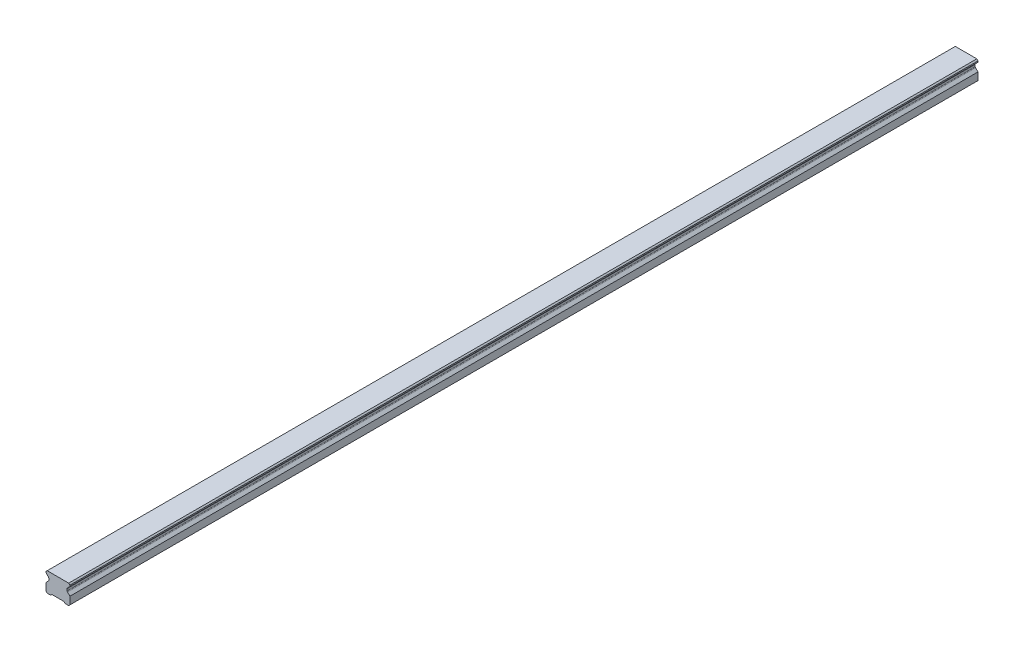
ISO-10303-21;
HEADER;
FILE_DESCRIPTION(('STEP AP214'),'2;1');
FILE_NAME('part.step','',(''),(''),'','','');
FILE_SCHEMA(('AUTOMOTIVE_DESIGN { 1 0 10303 214 1 1 1 1 }'));
ENDSEC;
DATA;
#1=APPLICATION_CONTEXT('core data for automotive mechanical design processes');
#2=APPLICATION_PROTOCOL_DEFINITION('international standard','automotive_design',2000,#1);
#3=PRODUCT_CONTEXT('',#1,'mechanical');
#4=PRODUCT('Part','Part','',(#3));
#5=PRODUCT_RELATED_PRODUCT_CATEGORY('part','',(#4));
#6=PRODUCT_DEFINITION_FORMATION('','',#4);
#7=PRODUCT_DEFINITION_CONTEXT('part definition',#1,'design');
#8=PRODUCT_DEFINITION('design','',#6,#7);
#9=PRODUCT_DEFINITION_SHAPE('','',#8);
#10=(LENGTH_UNIT() NAMED_UNIT(*) SI_UNIT(.MILLI.,.METRE.));
#11=(NAMED_UNIT(*) PLANE_ANGLE_UNIT() SI_UNIT($,.RADIAN.));
#12=(NAMED_UNIT(*) SI_UNIT($,.STERADIAN.) SOLID_ANGLE_UNIT());
#13=UNCERTAINTY_MEASURE_WITH_UNIT(LENGTH_MEASURE(1.E-05),#10,'distance_accuracy_value','');
#14=(GEOMETRIC_REPRESENTATION_CONTEXT(3) GLOBAL_UNCERTAINTY_ASSIGNED_CONTEXT((#13)) GLOBAL_UNIT_ASSIGNED_CONTEXT((#10,
#11,#12)) REPRESENTATION_CONTEXT('',''));
#15=CARTESIAN_POINT('',(0.,0.,0.));
#16=DIRECTION('',(0.,0.,1.));
#17=DIRECTION('',(1.,0.,0.));
#18=AXIS2_PLACEMENT_3D('',#15,#16,#17);
#19=CARTESIAN_POINT('',(0.,10.9999999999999,-360.));
#20=DIRECTION('',(0.,-1.,0.));
#21=DIRECTION('',(0.,0.,-1.));
#22=AXIS2_PLACEMENT_3D('',#19,#20,#21);
#23=PLANE('',#22);
#24=CARTESIAN_POINT('',(0.,10.9999999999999,-360.));
#25=DIRECTION('',(0.,-1.,0.));
#26=DIRECTION('',(0.,0.,-1.));
#27=AXIS2_PLACEMENT_3D('',#24,#25,#26);
#28=CIRCLE('',#27,2.5);
#29=CARTESIAN_POINT('',(0.,10.9999999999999,-362.5));
#30=VERTEX_POINT('',#29);
#31=EDGE_CURVE('E42',#30,#30,#28,.T.);
#32=ORIENTED_EDGE('',*,*,#31,.F.);
#33=EDGE_LOOP('',(#32));
#34=FACE_BOUND('',#33,.T.);
#35=CARTESIAN_POINT('',(0.,10.9999999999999,-360.));
#36=DIRECTION('',(0.,-1.,0.));
#37=DIRECTION('',(0.,0.,-1.));
#38=AXIS2_PLACEMENT_3D('',#35,#36,#37);
#39=CIRCLE('',#38,3.);
#40=CARTESIAN_POINT('',(0.,10.9999999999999,-363.));
#41=VERTEX_POINT('',#40);
#42=EDGE_CURVE('E11',#41,#41,#39,.T.);
#43=ORIENTED_EDGE('',*,*,#42,.T.);
#44=EDGE_LOOP('',(#43));
#45=FACE_BOUND('',#44,.T.);
#46=ADVANCED_FACE('F39',(#34,#45),#23,.T.);
#47=CARTESIAN_POINT('',(0.,10.9999999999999,-360.));
#48=DIRECTION('',(0.,-1.,0.));
#49=DIRECTION('',(0.,0.,-1.));
#50=AXIS2_PLACEMENT_3D('',#47,#48,#49);
#51=CYLINDRICAL_SURFACE('',#50,3.);
#52=ORIENTED_EDGE('',*,*,#42,.F.);
#53=EDGE_LOOP('',(#52));
#54=FACE_BOUND('',#53,.T.);
#55=CARTESIAN_POINT('',(0.,0.999999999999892,-360.));
#56=DIRECTION('',(0.,-1.,0.));
#57=DIRECTION('',(0.,0.,-1.));
#58=AXIS2_PLACEMENT_3D('',#55,#56,#57);
#59=CIRCLE('',#58,3.);
#60=CARTESIAN_POINT('',(0.,0.999999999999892,-363.));
#61=VERTEX_POINT('',#60);
#62=EDGE_CURVE('E48',#61,#61,#59,.T.);
#63=ORIENTED_EDGE('',*,*,#62,.T.);
#64=EDGE_LOOP('',(#63));
#65=FACE_BOUND('',#64,.T.);
#66=ADVANCED_FACE('F690',(#54,#65),#51,.F.);
#67=CARTESIAN_POINT('',(0.,10.9999999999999,-300.));
#68=DIRECTION('',(0.,-1.,0.));
#69=DIRECTION('',(0.,0.,-1.));
#70=AXIS2_PLACEMENT_3D('',#67,#68,#69);
#71=PLANE('',#70);
#72=CARTESIAN_POINT('',(0.,10.9999999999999,-300.));
#73=DIRECTION('',(0.,-1.,0.));
#74=DIRECTION('',(0.,0.,-1.));
#75=AXIS2_PLACEMENT_3D('',#72,#73,#74);
#76=CIRCLE('',#75,2.5);
#77=CARTESIAN_POINT('',(0.,10.9999999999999,-302.5));
#78=VERTEX_POINT('',#77);
#79=EDGE_CURVE('E676',#78,#78,#76,.T.);
#80=ORIENTED_EDGE('',*,*,#79,.F.);
#81=EDGE_LOOP('',(#80));
#82=FACE_BOUND('',#81,.T.);
#83=CARTESIAN_POINT('',(0.,10.9999999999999,-300.));
#84=DIRECTION('',(0.,-1.,0.));
#85=DIRECTION('',(0.,0.,-1.));
#86=AXIS2_PLACEMENT_3D('',#83,#84,#85);
#87=CIRCLE('',#86,3.);
#88=CARTESIAN_POINT('',(0.,10.9999999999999,-303.));
#89=VERTEX_POINT('',#88);
#90=EDGE_CURVE('E636',#89,#89,#87,.T.);
#91=ORIENTED_EDGE('',*,*,#90,.T.);
#92=EDGE_LOOP('',(#91));
#93=FACE_BOUND('',#92,.T.);
#94=ADVANCED_FACE('F695',(#82,#93),#71,.T.);
#95=CARTESIAN_POINT('',(0.,10.9999999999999,-300.));
#96=DIRECTION('',(0.,-1.,0.));
#97=DIRECTION('',(0.,0.,-1.));
#98=AXIS2_PLACEMENT_3D('',#95,#96,#97);
#99=CYLINDRICAL_SURFACE('',#98,3.);
#100=ORIENTED_EDGE('',*,*,#90,.F.);
#101=EDGE_LOOP('',(#100));
#102=FACE_BOUND('',#101,.T.);
#103=CARTESIAN_POINT('',(0.,0.999999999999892,-300.));
#104=DIRECTION('',(0.,-1.,0.));
#105=DIRECTION('',(0.,0.,-1.));
#106=AXIS2_PLACEMENT_3D('',#103,#104,#105);
#107=CIRCLE('',#106,3.);
#108=CARTESIAN_POINT('',(0.,0.999999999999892,-303.));
#109=VERTEX_POINT('',#108);
#110=EDGE_CURVE('E632',#109,#109,#107,.T.);
#111=ORIENTED_EDGE('',*,*,#110,.T.);
#112=EDGE_LOOP('',(#111));
#113=FACE_BOUND('',#112,.T.);
#114=ADVANCED_FACE('F870',(#102,#113),#99,.F.);
#115=CARTESIAN_POINT('',(0.,10.9999999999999,-240.));
#116=DIRECTION('',(0.,-1.,0.));
#117=DIRECTION('',(0.,0.,-1.));
#118=AXIS2_PLACEMENT_3D('',#115,#116,#117);
#119=PLANE('',#118);
#120=CARTESIAN_POINT('',(0.,10.9999999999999,-240.));
#121=DIRECTION('',(0.,-1.,0.));
#122=DIRECTION('',(0.,0.,-1.));
#123=AXIS2_PLACEMENT_3D('',#120,#121,#122);
#124=CIRCLE('',#123,2.5);
#125=CARTESIAN_POINT('',(0.,10.9999999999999,-242.5));
#126=VERTEX_POINT('',#125);
#127=EDGE_CURVE('E673',#126,#126,#124,.T.);
#128=ORIENTED_EDGE('',*,*,#127,.F.);
#129=EDGE_LOOP('',(#128));
#130=FACE_BOUND('',#129,.T.);
#131=CARTESIAN_POINT('',(0.,10.9999999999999,-240.));
#132=DIRECTION('',(0.,-1.,0.));
#133=DIRECTION('',(0.,0.,-1.));
#134=AXIS2_PLACEMENT_3D('',#131,#132,#133);
#135=CIRCLE('',#134,3.);
#136=CARTESIAN_POINT('',(0.,10.9999999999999,-243.));
#137=VERTEX_POINT('',#136);
#138=EDGE_CURVE('E628',#137,#137,#135,.T.);
#139=ORIENTED_EDGE('',*,*,#138,.T.);
#140=EDGE_LOOP('',(#139));
#141=FACE_BOUND('',#140,.T.);
#142=ADVANCED_FACE('F866',(#130,#141),#119,.T.);
#143=CARTESIAN_POINT('',(0.,10.9999999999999,-240.));
#144=DIRECTION('',(0.,-1.,0.));
#145=DIRECTION('',(0.,0.,-1.));
#146=AXIS2_PLACEMENT_3D('',#143,#144,#145);
#147=CYLINDRICAL_SURFACE('',#146,3.);
#148=ORIENTED_EDGE('',*,*,#138,.F.);
#149=EDGE_LOOP('',(#148));
#150=FACE_BOUND('',#149,.T.);
#151=CARTESIAN_POINT('',(0.,0.999999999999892,-240.));
#152=DIRECTION('',(0.,-1.,0.));
#153=DIRECTION('',(0.,0.,-1.));
#154=AXIS2_PLACEMENT_3D('',#151,#152,#153);
#155=CIRCLE('',#154,3.);
#156=CARTESIAN_POINT('',(0.,0.999999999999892,-243.));
#157=VERTEX_POINT('',#156);
#158=EDGE_CURVE('E624',#157,#157,#155,.T.);
#159=ORIENTED_EDGE('',*,*,#158,.T.);
#160=EDGE_LOOP('',(#159));
#161=FACE_BOUND('',#160,.T.);
#162=ADVANCED_FACE('F862',(#150,#161),#147,.F.);
#163=CARTESIAN_POINT('',(0.,10.9999999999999,-180.));
#164=DIRECTION('',(0.,-1.,0.));
#165=DIRECTION('',(0.,0.,-1.));
#166=AXIS2_PLACEMENT_3D('',#163,#164,#165);
#167=PLANE('',#166);
#168=CARTESIAN_POINT('',(0.,10.9999999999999,-180.));
#169=DIRECTION('',(0.,-1.,0.));
#170=DIRECTION('',(0.,0.,-1.));
#171=AXIS2_PLACEMENT_3D('',#168,#169,#170);
#172=CIRCLE('',#171,2.5);
#173=CARTESIAN_POINT('',(0.,10.9999999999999,-182.5));
#174=VERTEX_POINT('',#173);
#175=EDGE_CURVE('E669',#174,#174,#172,.T.);
#176=ORIENTED_EDGE('',*,*,#175,.F.);
#177=EDGE_LOOP('',(#176));
#178=FACE_BOUND('',#177,.T.);
#179=CARTESIAN_POINT('',(0.,10.9999999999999,-180.));
#180=DIRECTION('',(0.,-1.,0.));
#181=DIRECTION('',(0.,0.,-1.));
#182=AXIS2_PLACEMENT_3D('',#179,#180,#181);
#183=CIRCLE('',#182,3.);
#184=CARTESIAN_POINT('',(0.,10.9999999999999,-183.));
#185=VERTEX_POINT('',#184);
#186=EDGE_CURVE('E620',#185,#185,#183,.T.);
#187=ORIENTED_EDGE('',*,*,#186,.T.);
#188=EDGE_LOOP('',(#187));
#189=FACE_BOUND('',#188,.T.);
#190=ADVANCED_FACE('F858',(#178,#189),#167,.T.);
#191=CARTESIAN_POINT('',(0.,10.9999999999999,-180.));
#192=DIRECTION('',(0.,-1.,0.));
#193=DIRECTION('',(0.,0.,-1.));
#194=AXIS2_PLACEMENT_3D('',#191,#192,#193);
#195=CYLINDRICAL_SURFACE('',#194,3.);
#196=ORIENTED_EDGE('',*,*,#186,.F.);
#197=EDGE_LOOP('',(#196));
#198=FACE_BOUND('',#197,.T.);
#199=CARTESIAN_POINT('',(0.,0.999999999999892,-180.));
#200=DIRECTION('',(0.,-1.,0.));
#201=DIRECTION('',(0.,0.,-1.));
#202=AXIS2_PLACEMENT_3D('',#199,#200,#201);
#203=CIRCLE('',#202,3.);
#204=CARTESIAN_POINT('',(0.,0.999999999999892,-183.));
#205=VERTEX_POINT('',#204);
#206=EDGE_CURVE('E616',#205,#205,#203,.T.);
#207=ORIENTED_EDGE('',*,*,#206,.T.);
#208=EDGE_LOOP('',(#207));
#209=FACE_BOUND('',#208,.T.);
#210=ADVANCED_FACE('F854',(#198,#209),#195,.F.);
#211=CARTESIAN_POINT('',(0.,10.9999999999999,-120.));
#212=DIRECTION('',(0.,-1.,0.));
#213=DIRECTION('',(0.,0.,-1.));
#214=AXIS2_PLACEMENT_3D('',#211,#212,#213);
#215=PLANE('',#214);
#216=CARTESIAN_POINT('',(0.,10.9999999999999,-120.));
#217=DIRECTION('',(0.,-1.,0.));
#218=DIRECTION('',(0.,0.,-1.));
#219=AXIS2_PLACEMENT_3D('',#216,#217,#218);
#220=CIRCLE('',#219,2.5);
#221=CARTESIAN_POINT('',(0.,10.9999999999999,-122.5));
#222=VERTEX_POINT('',#221);
#223=EDGE_CURVE('E666',#222,#222,#220,.T.);
#224=ORIENTED_EDGE('',*,*,#223,.F.);
#225=EDGE_LOOP('',(#224));
#226=FACE_BOUND('',#225,.T.);
#227=CARTESIAN_POINT('',(0.,10.9999999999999,-120.));
#228=DIRECTION('',(0.,-1.,0.));
#229=DIRECTION('',(0.,0.,-1.));
#230=AXIS2_PLACEMENT_3D('',#227,#228,#229);
#231=CIRCLE('',#230,3.);
#232=CARTESIAN_POINT('',(0.,10.9999999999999,-123.));
#233=VERTEX_POINT('',#232);
#234=EDGE_CURVE('E612',#233,#233,#231,.T.);
#235=ORIENTED_EDGE('',*,*,#234,.T.);
#236=EDGE_LOOP('',(#235));
#237=FACE_BOUND('',#236,.T.);
#238=ADVANCED_FACE('F850',(#226,#237),#215,.T.);
#239=CARTESIAN_POINT('',(0.,10.9999999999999,-120.));
#240=DIRECTION('',(0.,-1.,0.));
#241=DIRECTION('',(0.,0.,-1.));
#242=AXIS2_PLACEMENT_3D('',#239,#240,#241);
#243=CYLINDRICAL_SURFACE('',#242,3.);
#244=ORIENTED_EDGE('',*,*,#234,.F.);
#245=EDGE_LOOP('',(#244));
#246=FACE_BOUND('',#245,.T.);
#247=CARTESIAN_POINT('',(0.,0.999999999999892,-120.));
#248=DIRECTION('',(0.,-1.,0.));
#249=DIRECTION('',(0.,0.,-1.));
#250=AXIS2_PLACEMENT_3D('',#247,#248,#249);
#251=CIRCLE('',#250,3.);
#252=CARTESIAN_POINT('',(0.,0.999999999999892,-123.));
#253=VERTEX_POINT('',#252);
#254=EDGE_CURVE('E608',#253,#253,#251,.T.);
#255=ORIENTED_EDGE('',*,*,#254,.T.);
#256=EDGE_LOOP('',(#255));
#257=FACE_BOUND('',#256,.T.);
#258=ADVANCED_FACE('F846',(#246,#257),#243,.F.);
#259=CARTESIAN_POINT('',(0.,10.9999999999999,-60.));
#260=DIRECTION('',(0.,-1.,0.));
#261=DIRECTION('',(0.,0.,-1.));
#262=AXIS2_PLACEMENT_3D('',#259,#260,#261);
#263=PLANE('',#262);
#264=CARTESIAN_POINT('',(0.,10.9999999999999,-60.));
#265=DIRECTION('',(0.,-1.,0.));
#266=DIRECTION('',(0.,0.,-1.));
#267=AXIS2_PLACEMENT_3D('',#264,#265,#266);
#268=CIRCLE('',#267,2.5);
#269=CARTESIAN_POINT('',(0.,10.9999999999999,-62.5));
#270=VERTEX_POINT('',#269);
#271=EDGE_CURVE('E662',#270,#270,#268,.T.);
#272=ORIENTED_EDGE('',*,*,#271,.F.);
#273=EDGE_LOOP('',(#272));
#274=FACE_BOUND('',#273,.T.);
#275=CARTESIAN_POINT('',(0.,10.9999999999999,-60.));
#276=DIRECTION('',(0.,-1.,0.));
#277=DIRECTION('',(0.,0.,-1.));
#278=AXIS2_PLACEMENT_3D('',#275,#276,#277);
#279=CIRCLE('',#278,3.);
#280=CARTESIAN_POINT('',(0.,10.9999999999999,-63.));
#281=VERTEX_POINT('',#280);
#282=EDGE_CURVE('E604',#281,#281,#279,.T.);
#283=ORIENTED_EDGE('',*,*,#282,.T.);
#284=EDGE_LOOP('',(#283));
#285=FACE_BOUND('',#284,.T.);
#286=ADVANCED_FACE('F842',(#274,#285),#263,.T.);
#287=CARTESIAN_POINT('',(0.,10.9999999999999,-60.));
#288=DIRECTION('',(0.,-1.,0.));
#289=DIRECTION('',(0.,0.,-1.));
#290=AXIS2_PLACEMENT_3D('',#287,#288,#289);
#291=CYLINDRICAL_SURFACE('',#290,3.);
#292=ORIENTED_EDGE('',*,*,#282,.F.);
#293=EDGE_LOOP('',(#292));
#294=FACE_BOUND('',#293,.T.);
#295=CARTESIAN_POINT('',(0.,0.999999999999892,-60.));
#296=DIRECTION('',(0.,-1.,0.));
#297=DIRECTION('',(0.,0.,-1.));
#298=AXIS2_PLACEMENT_3D('',#295,#296,#297);
#299=CIRCLE('',#298,3.);
#300=CARTESIAN_POINT('',(0.,0.999999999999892,-63.));
#301=VERTEX_POINT('',#300);
#302=EDGE_CURVE('E600',#301,#301,#299,.T.);
#303=ORIENTED_EDGE('',*,*,#302,.T.);
#304=EDGE_LOOP('',(#303));
#305=FACE_BOUND('',#304,.T.);
#306=ADVANCED_FACE('F838',(#294,#305),#291,.F.);
#307=CARTESIAN_POINT('',(0.,10.9999999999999,0.));
#308=DIRECTION('',(0.,-1.,0.));
#309=DIRECTION('',(0.,0.,-1.));
#310=AXIS2_PLACEMENT_3D('',#307,#308,#309);
#311=PLANE('',#310);
#312=CARTESIAN_POINT('',(0.,10.9999999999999,0.));
#313=DIRECTION('',(0.,-1.,0.));
#314=DIRECTION('',(0.,0.,-1.));
#315=AXIS2_PLACEMENT_3D('',#312,#313,#314);
#316=CIRCLE('',#315,2.5);
#317=CARTESIAN_POINT('',(0.,10.9999999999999,-2.5));
#318=VERTEX_POINT('',#317);
#319=EDGE_CURVE('E658',#318,#318,#316,.T.);
#320=ORIENTED_EDGE('',*,*,#319,.F.);
#321=EDGE_LOOP('',(#320));
#322=FACE_BOUND('',#321,.T.);
#323=CARTESIAN_POINT('',(0.,10.9999999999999,0.));
#324=DIRECTION('',(0.,-1.,0.));
#325=DIRECTION('',(0.,0.,-1.));
#326=AXIS2_PLACEMENT_3D('',#323,#324,#325);
#327=CIRCLE('',#326,3.);
#328=CARTESIAN_POINT('',(0.,10.9999999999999,-3.));
#329=VERTEX_POINT('',#328);
#330=EDGE_CURVE('E596',#329,#329,#327,.T.);
#331=ORIENTED_EDGE('',*,*,#330,.T.);
#332=EDGE_LOOP('',(#331));
#333=FACE_BOUND('',#332,.T.);
#334=ADVANCED_FACE('F834',(#322,#333),#311,.T.);
#335=CARTESIAN_POINT('',(0.,10.9999999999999,0.));
#336=DIRECTION('',(0.,-1.,0.));
#337=DIRECTION('',(0.,0.,-1.));
#338=AXIS2_PLACEMENT_3D('',#335,#336,#337);
#339=CYLINDRICAL_SURFACE('',#338,3.);
#340=ORIENTED_EDGE('',*,*,#330,.F.);
#341=EDGE_LOOP('',(#340));
#342=FACE_BOUND('',#341,.T.);
#343=CARTESIAN_POINT('',(0.,0.999999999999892,0.));
#344=DIRECTION('',(0.,-1.,0.));
#345=DIRECTION('',(0.,0.,-1.));
#346=AXIS2_PLACEMENT_3D('',#343,#344,#345);
#347=CIRCLE('',#346,3.);
#348=CARTESIAN_POINT('',(0.,0.999999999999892,-3.));
#349=VERTEX_POINT('',#348);
#350=EDGE_CURVE('E592',#349,#349,#347,.T.);
#351=ORIENTED_EDGE('',*,*,#350,.T.);
#352=EDGE_LOOP('',(#351));
#353=FACE_BOUND('',#352,.T.);
#354=ADVANCED_FACE('F830',(#342,#353),#339,.F.);
#355=CARTESIAN_POINT('',(0.,10.9999999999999,60.));
#356=DIRECTION('',(0.,-1.,0.));
#357=DIRECTION('',(0.,0.,-1.));
#358=AXIS2_PLACEMENT_3D('',#355,#356,#357);
#359=PLANE('',#358);
#360=CARTESIAN_POINT('',(0.,10.9999999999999,60.));
#361=DIRECTION('',(0.,-1.,0.));
#362=DIRECTION('',(0.,0.,-1.));
#363=AXIS2_PLACEMENT_3D('',#360,#361,#362);
#364=CIRCLE('',#363,2.5);
#365=CARTESIAN_POINT('',(0.,10.9999999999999,57.5));
#366=VERTEX_POINT('',#365);
#367=EDGE_CURVE('E654',#366,#366,#364,.T.);
#368=ORIENTED_EDGE('',*,*,#367,.F.);
#369=EDGE_LOOP('',(#368));
#370=FACE_BOUND('',#369,.T.);
#371=CARTESIAN_POINT('',(0.,10.9999999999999,60.));
#372=DIRECTION('',(0.,-1.,0.));
#373=DIRECTION('',(0.,0.,-1.));
#374=AXIS2_PLACEMENT_3D('',#371,#372,#373);
#375=CIRCLE('',#374,3.);
#376=CARTESIAN_POINT('',(0.,10.9999999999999,57.));
#377=VERTEX_POINT('',#376);
#378=EDGE_CURVE('E588',#377,#377,#375,.T.);
#379=ORIENTED_EDGE('',*,*,#378,.T.);
#380=EDGE_LOOP('',(#379));
#381=FACE_BOUND('',#380,.T.);
#382=ADVANCED_FACE('F826',(#370,#381),#359,.T.);
#383=CARTESIAN_POINT('',(0.,10.9999999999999,60.));
#384=DIRECTION('',(0.,-1.,0.));
#385=DIRECTION('',(0.,0.,-1.));
#386=AXIS2_PLACEMENT_3D('',#383,#384,#385);
#387=CYLINDRICAL_SURFACE('',#386,3.);
#388=ORIENTED_EDGE('',*,*,#378,.F.);
#389=EDGE_LOOP('',(#388));
#390=FACE_BOUND('',#389,.T.);
#391=CARTESIAN_POINT('',(0.,0.999999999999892,60.));
#392=DIRECTION('',(0.,-1.,0.));
#393=DIRECTION('',(0.,0.,-1.));
#394=AXIS2_PLACEMENT_3D('',#391,#392,#393);
#395=CIRCLE('',#394,3.);
#396=CARTESIAN_POINT('',(0.,0.999999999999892,57.));
#397=VERTEX_POINT('',#396);
#398=EDGE_CURVE('E584',#397,#397,#395,.T.);
#399=ORIENTED_EDGE('',*,*,#398,.T.);
#400=EDGE_LOOP('',(#399));
#401=FACE_BOUND('',#400,.T.);
#402=ADVANCED_FACE('F822',(#390,#401),#387,.F.);
#403=CARTESIAN_POINT('',(0.,10.9999999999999,120.));
#404=DIRECTION('',(0.,-1.,0.));
#405=DIRECTION('',(0.,0.,-1.));
#406=AXIS2_PLACEMENT_3D('',#403,#404,#405);
#407=PLANE('',#406);
#408=CARTESIAN_POINT('',(0.,10.9999999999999,120.));
#409=DIRECTION('',(0.,-1.,0.));
#410=DIRECTION('',(0.,0.,-1.));
#411=AXIS2_PLACEMENT_3D('',#408,#409,#410);
#412=CIRCLE('',#411,2.5);
#413=CARTESIAN_POINT('',(0.,10.9999999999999,117.5));
#414=VERTEX_POINT('',#413);
#415=EDGE_CURVE('E650',#414,#414,#412,.T.);
#416=ORIENTED_EDGE('',*,*,#415,.F.);
#417=EDGE_LOOP('',(#416));
#418=FACE_BOUND('',#417,.T.);
#419=CARTESIAN_POINT('',(0.,10.9999999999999,120.));
#420=DIRECTION('',(0.,-1.,0.));
#421=DIRECTION('',(0.,0.,-1.));
#422=AXIS2_PLACEMENT_3D('',#419,#420,#421);
#423=CIRCLE('',#422,3.);
#424=CARTESIAN_POINT('',(0.,10.9999999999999,117.));
#425=VERTEX_POINT('',#424);
#426=EDGE_CURVE('E580',#425,#425,#423,.T.);
#427=ORIENTED_EDGE('',*,*,#426,.T.);
#428=EDGE_LOOP('',(#427));
#429=FACE_BOUND('',#428,.T.);
#430=ADVANCED_FACE('F818',(#418,#429),#407,.T.);
#431=CARTESIAN_POINT('',(0.,10.9999999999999,120.));
#432=DIRECTION('',(0.,-1.,0.));
#433=DIRECTION('',(0.,0.,-1.));
#434=AXIS2_PLACEMENT_3D('',#431,#432,#433);
#435=CYLINDRICAL_SURFACE('',#434,3.);
#436=ORIENTED_EDGE('',*,*,#426,.F.);
#437=EDGE_LOOP('',(#436));
#438=FACE_BOUND('',#437,.T.);
#439=CARTESIAN_POINT('',(0.,0.999999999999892,120.));
#440=DIRECTION('',(0.,-1.,0.));
#441=DIRECTION('',(0.,0.,-1.));
#442=AXIS2_PLACEMENT_3D('',#439,#440,#441);
#443=CIRCLE('',#442,3.);
#444=CARTESIAN_POINT('',(0.,0.999999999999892,117.));
#445=VERTEX_POINT('',#444);
#446=EDGE_CURVE('E576',#445,#445,#443,.T.);
#447=ORIENTED_EDGE('',*,*,#446,.T.);
#448=EDGE_LOOP('',(#447));
#449=FACE_BOUND('',#448,.T.);
#450=ADVANCED_FACE('F814',(#438,#449),#435,.F.);
#451=CARTESIAN_POINT('',(0.,10.9999999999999,180.));
#452=DIRECTION('',(0.,-1.,0.));
#453=DIRECTION('',(0.,0.,-1.));
#454=AXIS2_PLACEMENT_3D('',#451,#452,#453);
#455=PLANE('',#454);
#456=CARTESIAN_POINT('',(0.,10.9999999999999,180.));
#457=DIRECTION('',(0.,-1.,0.));
#458=DIRECTION('',(0.,0.,-1.));
#459=AXIS2_PLACEMENT_3D('',#456,#457,#458);
#460=CIRCLE('',#459,2.5);
#461=CARTESIAN_POINT('',(0.,10.9999999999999,177.5));
#462=VERTEX_POINT('',#461);
#463=EDGE_CURVE('E646',#462,#462,#460,.T.);
#464=ORIENTED_EDGE('',*,*,#463,.F.);
#465=EDGE_LOOP('',(#464));
#466=FACE_BOUND('',#465,.T.);
#467=CARTESIAN_POINT('',(0.,10.9999999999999,180.));
#468=DIRECTION('',(0.,-1.,0.));
#469=DIRECTION('',(0.,0.,-1.));
#470=AXIS2_PLACEMENT_3D('',#467,#468,#469);
#471=CIRCLE('',#470,3.);
#472=CARTESIAN_POINT('',(0.,10.9999999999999,177.));
#473=VERTEX_POINT('',#472);
#474=EDGE_CURVE('E572',#473,#473,#471,.T.);
#475=ORIENTED_EDGE('',*,*,#474,.T.);
#476=EDGE_LOOP('',(#475));
#477=FACE_BOUND('',#476,.T.);
#478=ADVANCED_FACE('F810',(#466,#477),#455,.T.);
#479=CARTESIAN_POINT('',(0.,10.9999999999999,180.));
#480=DIRECTION('',(0.,-1.,0.));
#481=DIRECTION('',(0.,0.,-1.));
#482=AXIS2_PLACEMENT_3D('',#479,#480,#481);
#483=CYLINDRICAL_SURFACE('',#482,3.);
#484=ORIENTED_EDGE('',*,*,#474,.F.);
#485=EDGE_LOOP('',(#484));
#486=FACE_BOUND('',#485,.T.);
#487=CARTESIAN_POINT('',(0.,0.999999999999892,180.));
#488=DIRECTION('',(0.,-1.,0.));
#489=DIRECTION('',(0.,0.,-1.));
#490=AXIS2_PLACEMENT_3D('',#487,#488,#489);
#491=CIRCLE('',#490,3.);
#492=CARTESIAN_POINT('',(0.,0.999999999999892,177.));
#493=VERTEX_POINT('',#492);
#494=EDGE_CURVE('E568',#493,#493,#491,.T.);
#495=ORIENTED_EDGE('',*,*,#494,.T.);
#496=EDGE_LOOP('',(#495));
#497=FACE_BOUND('',#496,.T.);
#498=ADVANCED_FACE('F806',(#486,#497),#483,.F.);
#499=CARTESIAN_POINT('',(0.,10.9999999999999,240.));
#500=DIRECTION('',(0.,-1.,0.));
#501=DIRECTION('',(0.,0.,-1.));
#502=AXIS2_PLACEMENT_3D('',#499,#500,#501);
#503=PLANE('',#502);
#504=CARTESIAN_POINT('',(0.,10.9999999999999,240.));
#505=DIRECTION('',(0.,-1.,0.));
#506=DIRECTION('',(0.,0.,-1.));
#507=AXIS2_PLACEMENT_3D('',#504,#505,#506);
#508=CIRCLE('',#507,2.5);
#509=CARTESIAN_POINT('',(0.,10.9999999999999,237.5));
#510=VERTEX_POINT('',#509);
#511=EDGE_CURVE('E257',#510,#510,#508,.T.);
#512=ORIENTED_EDGE('',*,*,#511,.F.);
#513=EDGE_LOOP('',(#512));
#514=FACE_BOUND('',#513,.T.);
#515=CARTESIAN_POINT('',(0.,10.9999999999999,240.));
#516=DIRECTION('',(0.,-1.,0.));
#517=DIRECTION('',(0.,0.,-1.));
#518=AXIS2_PLACEMENT_3D('',#515,#516,#517);
#519=CIRCLE('',#518,3.);
#520=CARTESIAN_POINT('',(0.,10.9999999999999,237.));
#521=VERTEX_POINT('',#520);
#522=EDGE_CURVE('E564',#521,#521,#519,.T.);
#523=ORIENTED_EDGE('',*,*,#522,.T.);
#524=EDGE_LOOP('',(#523));
#525=FACE_BOUND('',#524,.T.);
#526=ADVANCED_FACE('F802',(#514,#525),#503,.T.);
#527=CARTESIAN_POINT('',(0.,10.9999999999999,240.));
#528=DIRECTION('',(0.,-1.,0.));
#529=DIRECTION('',(0.,0.,-1.));
#530=AXIS2_PLACEMENT_3D('',#527,#528,#529);
#531=CYLINDRICAL_SURFACE('',#530,3.);
#532=ORIENTED_EDGE('',*,*,#522,.F.);
#533=EDGE_LOOP('',(#532));
#534=FACE_BOUND('',#533,.T.);
#535=CARTESIAN_POINT('',(0.,0.999999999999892,240.));
#536=DIRECTION('',(0.,-1.,0.));
#537=DIRECTION('',(0.,0.,-1.));
#538=AXIS2_PLACEMENT_3D('',#535,#536,#537);
#539=CIRCLE('',#538,3.);
#540=CARTESIAN_POINT('',(0.,0.999999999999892,237.));
#541=VERTEX_POINT('',#540);
#542=EDGE_CURVE('E560',#541,#541,#539,.T.);
#543=ORIENTED_EDGE('',*,*,#542,.T.);
#544=EDGE_LOOP('',(#543));
#545=FACE_BOUND('',#544,.T.);
#546=ADVANCED_FACE('F799',(#534,#545),#531,.F.);
#547=CARTESIAN_POINT('',(10.,0.,380.));
#548=DIRECTION('',(0.,1.,0.));
#549=DIRECTION('',(-1.,0.,0.));
#550=AXIS2_PLACEMENT_3D('',#547,#548,#549);
#551=PLANE('',#550);
#552=DIRECTION('',(1.,0.,0.));
#553=VECTOR('',#552,1.);
#554=CARTESIAN_POINT('',(10.,0.,-380.));
#555=LINE('',#554,#553);
#556=CARTESIAN_POINT('',(-9.,0.,-380.));
#557=VERTEX_POINT('',#556);
#558=CARTESIAN_POINT('',(-5.99999999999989,0.,-380.));
#559=VERTEX_POINT('',#558);
#560=EDGE_CURVE('E443',#557,#559,#555,.T.);
#561=ORIENTED_EDGE('',*,*,#560,.T.);
#562=DIRECTION('',(0.,0.,1.));
#563=VECTOR('',#562,1.);
#564=CARTESIAN_POINT('',(-5.99999999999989,0.,-380.));
#565=LINE('',#564,#563);
#566=CARTESIAN_POINT('',(-5.99999999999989,0.,380.));
#567=VERTEX_POINT('',#566);
#568=EDGE_CURVE('E348',#559,#567,#565,.T.);
#569=ORIENTED_EDGE('',*,*,#568,.T.);
#570=DIRECTION('',(1.,0.,0.));
#571=VECTOR('',#570,1.);
#572=CARTESIAN_POINT('',(10.,0.,380.));
#573=LINE('',#572,#571);
#574=CARTESIAN_POINT('',(-9.,0.,380.));
#575=VERTEX_POINT('',#574);
#576=EDGE_CURVE('E424',#575,#567,#573,.T.);
#577=ORIENTED_EDGE('',*,*,#576,.F.);
#578=DIRECTION('',(0.,0.,-1.));
#579=VECTOR('',#578,1.);
#580=CARTESIAN_POINT('',(-9.,0.,380.));
#581=LINE('',#580,#579);
#582=EDGE_CURVE('E495',#575,#557,#581,.T.);
#583=ORIENTED_EDGE('',*,*,#582,.T.);
#584=EDGE_LOOP('',(#561,#569,#577,#583));
#585=FACE_BOUND('',#584,.T.);
#586=ADVANCED_FACE('F764',(#585),#551,.F.);
#587=CARTESIAN_POINT('',(-10.,16.3,380.));
#588=DIRECTION('',(1.,0.,0.));
#589=DIRECTION('',(0.,1.,0.));
#590=AXIS2_PLACEMENT_3D('',#587,#588,#589);
#591=PLANE('',#590);
#592=DIRECTION('',(0.,-1.,0.));
#593=VECTOR('',#592,1.);
#594=CARTESIAN_POINT('',(-10.,16.3,380.));
#595=LINE('',#594,#593);
#596=CARTESIAN_POINT('',(-10.,15.3,380.));
#597=VERTEX_POINT('',#596);
#598=CARTESIAN_POINT('',(-10.,14.3,380.));
#599=VERTEX_POINT('',#598);
#600=EDGE_CURVE('E418',#597,#599,#595,.T.);
#601=ORIENTED_EDGE('',*,*,#600,.F.);
#602=DIRECTION('',(0.,0.,-1.));
#603=VECTOR('',#602,1.);
#604=CARTESIAN_POINT('',(-10.,15.3,380.));
#605=LINE('',#604,#603);
#606=CARTESIAN_POINT('',(-10.,15.3,-380.));
#607=VERTEX_POINT('',#606);
#608=EDGE_CURVE('E437',#597,#607,#605,.T.);
#609=ORIENTED_EDGE('',*,*,#608,.T.);
#610=DIRECTION('',(0.,-1.,0.));
#611=VECTOR('',#610,1.);
#612=CARTESIAN_POINT('',(-10.,16.3,-380.));
#613=LINE('',#612,#611);
#614=CARTESIAN_POINT('',(-10.,14.3,-380.));
#615=VERTEX_POINT('',#614);
#616=EDGE_CURVE('E438',#607,#615,#613,.T.);
#617=ORIENTED_EDGE('',*,*,#616,.T.);
#618=DIRECTION('',(0.,0.,1.));
#619=VECTOR('',#618,1.);
#620=CARTESIAN_POINT('',(-10.,14.3,-380.));
#621=LINE('',#620,#619);
#622=EDGE_CURVE('E372',#615,#599,#621,.T.);
#623=ORIENTED_EDGE('',*,*,#622,.T.);
#624=EDGE_LOOP('',(#601,#609,#617,#623));
#625=FACE_BOUND('',#624,.T.);
#626=ADVANCED_FACE('F768',(#625),#591,.F.);
#627=CARTESIAN_POINT('',(10.,16.3,380.));
#628=DIRECTION('',(-1.,0.,0.));
#629=DIRECTION('',(0.,-1.,0.));
#630=AXIS2_PLACEMENT_3D('',#627,#628,#629);
#631=PLANE('',#630);
#632=DIRECTION('',(0.,1.,0.));
#633=VECTOR('',#632,1.);
#634=CARTESIAN_POINT('',(10.,16.3,380.));
#635=LINE('',#634,#633);
#636=CARTESIAN_POINT('',(10.,0.999999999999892,380.));
#637=VERTEX_POINT('',#636);
#638=CARTESIAN_POINT('',(10.,7.3,380.));
#639=VERTEX_POINT('',#638);
#640=EDGE_CURVE('E429',#637,#639,#635,.T.);
#641=ORIENTED_EDGE('',*,*,#640,.F.);
#642=DIRECTION('',(0.,0.,-1.));
#643=VECTOR('',#642,1.);
#644=CARTESIAN_POINT('',(10.,0.999999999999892,380.));
#645=LINE('',#644,#643);
#646=CARTESIAN_POINT('',(10.,0.999999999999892,-380.));
#647=VERTEX_POINT('',#646);
#648=EDGE_CURVE('E502',#637,#647,#645,.T.);
#649=ORIENTED_EDGE('',*,*,#648,.T.);
#650=DIRECTION('',(0.,1.,0.));
#651=VECTOR('',#650,1.);
#652=CARTESIAN_POINT('',(10.,16.3,-380.));
#653=LINE('',#652,#651);
#654=CARTESIAN_POINT('',(10.,7.3,-380.));
#655=VERTEX_POINT('',#654);
#656=EDGE_CURVE('E448',#647,#655,#653,.T.);
#657=ORIENTED_EDGE('',*,*,#656,.T.);
#658=DIRECTION('',(0.,0.,1.));
#659=VECTOR('',#658,1.);
#660=CARTESIAN_POINT('',(10.,7.3,-380.));
#661=LINE('',#660,#659);
#662=EDGE_CURVE('E403',#655,#639,#661,.T.);
#663=ORIENTED_EDGE('',*,*,#662,.T.);
#664=EDGE_LOOP('',(#641,#649,#657,#663));
#665=FACE_BOUND('',#664,.T.);
#666=ADVANCED_FACE('F759',(#665),#631,.F.);
#667=CARTESIAN_POINT('',(-10.,7.3,-380.));
#668=VERTEX_POINT('',#667);
#669=CARTESIAN_POINT('',(-10.,0.999999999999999,-380.));
#670=VERTEX_POINT('',#669);
#671=EDGE_CURVE('E387',#668,#670,#613,.T.);
#672=ORIENTED_EDGE('',*,*,#671,.T.);
#673=DIRECTION('',(0.,0.,1.));
#674=VECTOR('',#673,1.);
#675=CARTESIAN_POINT('',(-10.,0.999999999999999,380.));
#676=LINE('',#675,#674);
#677=CARTESIAN_POINT('',(-10.,0.999999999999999,380.));
#678=VERTEX_POINT('',#677);
#679=EDGE_CURVE('E499',#670,#678,#676,.T.);
#680=ORIENTED_EDGE('',*,*,#679,.T.);
#681=CARTESIAN_POINT('',(-10.,7.3,380.));
#682=VERTEX_POINT('',#681);
#683=EDGE_CURVE('E423',#682,#678,#595,.T.);
#684=ORIENTED_EDGE('',*,*,#683,.F.);
#685=DIRECTION('',(0.,0.,1.));
#686=VECTOR('',#685,1.);
#687=CARTESIAN_POINT('',(-10.,7.3,-380.));
#688=LINE('',#687,#686);
#689=EDGE_CURVE('E384',#668,#682,#688,.T.);
#690=ORIENTED_EDGE('',*,*,#689,.F.);
#691=EDGE_LOOP('',(#672,#680,#684,#690));
#692=FACE_BOUND('',#691,.T.);
#693=ADVANCED_FACE('F762',(#692),#591,.F.);
#694=CARTESIAN_POINT('',(5.99999999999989,0.,380.));
#695=VERTEX_POINT('',#694);
#696=CARTESIAN_POINT('',(9.,0.,380.));
#697=VERTEX_POINT('',#696);
#698=EDGE_CURVE('E422',#695,#697,#573,.T.);
#699=ORIENTED_EDGE('',*,*,#698,.F.);
#700=DIRECTION('',(0.,0.,1.));
#701=VECTOR('',#700,1.);
#702=CARTESIAN_POINT('',(5.99999999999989,0.,-380.));
#703=LINE('',#702,#701);
#704=CARTESIAN_POINT('',(5.99999999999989,0.,-380.));
#705=VERTEX_POINT('',#704);
#706=EDGE_CURVE('E338',#705,#695,#703,.T.);
#707=ORIENTED_EDGE('',*,*,#706,.F.);
#708=CARTESIAN_POINT('',(9.,0.,-380.));
#709=VERTEX_POINT('',#708);
#710=EDGE_CURVE('E442',#705,#709,#555,.T.);
#711=ORIENTED_EDGE('',*,*,#710,.T.);
#712=DIRECTION('',(0.,0.,1.));
#713=VECTOR('',#712,1.);
#714=CARTESIAN_POINT('',(9.,0.,380.));
#715=LINE('',#714,#713);
#716=EDGE_CURVE('E491',#709,#697,#715,.T.);
#717=ORIENTED_EDGE('',*,*,#716,.T.);
#718=EDGE_LOOP('',(#699,#707,#711,#717));
#719=FACE_BOUND('',#718,.T.);
#720=ADVANCED_FACE('F757',(#719),#551,.F.);
#721=CARTESIAN_POINT('',(10.,14.3,-380.));
#722=VERTEX_POINT('',#721);
#723=CARTESIAN_POINT('',(10.,15.3,-380.));
#724=VERTEX_POINT('',#723);
#725=EDGE_CURVE('E447',#722,#724,#653,.T.);
#726=ORIENTED_EDGE('',*,*,#725,.T.);
#727=DIRECTION('',(0.,0.,1.));
#728=VECTOR('',#727,1.);
#729=CARTESIAN_POINT('',(10.,15.3,380.));
#730=LINE('',#729,#728);
#731=CARTESIAN_POINT('',(10.,15.3,380.));
#732=VERTEX_POINT('',#731);
#733=EDGE_CURVE('E506',#724,#732,#730,.T.);
#734=ORIENTED_EDGE('',*,*,#733,.T.);
#735=CARTESIAN_POINT('',(10.,14.3,380.));
#736=VERTEX_POINT('',#735);
#737=EDGE_CURVE('E428',#736,#732,#635,.T.);
#738=ORIENTED_EDGE('',*,*,#737,.F.);
#739=DIRECTION('',(0.,0.,1.));
#740=VECTOR('',#739,1.);
#741=CARTESIAN_POINT('',(10.,14.3,-380.));
#742=LINE('',#741,#740);
#743=EDGE_CURVE('E377',#722,#736,#742,.T.);
#744=ORIENTED_EDGE('',*,*,#743,.F.);
#745=EDGE_LOOP('',(#726,#734,#738,#744));
#746=FACE_BOUND('',#745,.T.);
#747=ADVANCED_FACE('F753',(#746),#631,.F.);
#748=CARTESIAN_POINT('',(10.,16.3,380.));
#749=DIRECTION('',(0.,-1.,0.));
#750=DIRECTION('',(0.,0.,-1.));
#751=AXIS2_PLACEMENT_3D('',#748,#749,#750);
#752=PLANE('',#751);
#753=DIRECTION('',(-1.,0.,0.));
#754=VECTOR('',#753,1.);
#755=CARTESIAN_POINT('',(10.,16.3,-380.));
#756=LINE('',#755,#754);
#757=CARTESIAN_POINT('',(9.00000000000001,16.3,-380.));
#758=VERTEX_POINT('',#757);
#759=CARTESIAN_POINT('',(-9.00000000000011,16.3,-380.));
#760=VERTEX_POINT('',#759);
#761=EDGE_CURVE('E452',#758,#760,#756,.T.);
#762=ORIENTED_EDGE('',*,*,#761,.T.);
#763=DIRECTION('',(0.,0.,1.));
#764=VECTOR('',#763,1.);
#765=CARTESIAN_POINT('',(-9.00000000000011,16.3,380.));
#766=LINE('',#765,#764);
#767=CARTESIAN_POINT('',(-9.00000000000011,16.3,380.));
#768=VERTEX_POINT('',#767);
#769=EDGE_CURVE('E476',#760,#768,#766,.T.);
#770=ORIENTED_EDGE('',*,*,#769,.T.);
#771=DIRECTION('',(-1.,0.,0.));
#772=VECTOR('',#771,1.);
#773=CARTESIAN_POINT('',(10.,16.3,380.));
#774=LINE('',#773,#772);
#775=CARTESIAN_POINT('',(9.00000000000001,16.3,380.));
#776=VERTEX_POINT('',#775);
#777=EDGE_CURVE('E433',#776,#768,#774,.T.);
#778=ORIENTED_EDGE('',*,*,#777,.F.);
#779=DIRECTION('',(0.,0.,-1.));
#780=VECTOR('',#779,1.);
#781=CARTESIAN_POINT('',(9.00000000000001,16.3,380.));
#782=LINE('',#781,#780);
#783=EDGE_CURVE('E472',#776,#758,#782,.T.);
#784=ORIENTED_EDGE('',*,*,#783,.T.);
#785=EDGE_LOOP('',(#762,#770,#778,#784));
#786=FACE_BOUND('',#785,.T.);
#787=ADVANCED_FACE('F747',(#786),#752,.F.);
#788=CARTESIAN_POINT('',(0.,0.,380.));
#789=DIRECTION('',(0.,0.,-1.));
#790=DIRECTION('',(-1.,0.,0.));
#791=AXIS2_PLACEMENT_3D('',#788,#789,#790);
#792=PLANE('',#791);
#793=ORIENTED_EDGE('',*,*,#576,.T.);
#794=DIRECTION('',(-0.707106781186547,-0.707106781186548,0.));
#795=VECTOR('',#794,1.);
#796=CARTESIAN_POINT('',(-5.99999999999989,0.,380.));
#797=LINE('',#796,#795);
#798=CARTESIAN_POINT('',(-5.,0.999999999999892,380.));
#799=VERTEX_POINT('',#798);
#800=EDGE_CURVE('E332',#799,#567,#797,.T.);
#801=ORIENTED_EDGE('',*,*,#800,.F.);
#802=DIRECTION('',(-1.,0.,0.));
#803=VECTOR('',#802,1.);
#804=CARTESIAN_POINT('',(-5.,0.999999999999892,380.));
#805=LINE('',#804,#803);
#806=CARTESIAN_POINT('',(5.,0.999999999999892,380.));
#807=VERTEX_POINT('',#806);
#808=EDGE_CURVE('E342',#807,#799,#805,.T.);
#809=ORIENTED_EDGE('',*,*,#808,.F.);
#810=DIRECTION('',(-0.707106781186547,0.707106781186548,0.));
#811=VECTOR('',#810,1.);
#812=CARTESIAN_POINT('',(5.,0.999999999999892,380.));
#813=LINE('',#812,#811);
#814=EDGE_CURVE('E324',#695,#807,#813,.T.);
#815=ORIENTED_EDGE('',*,*,#814,.F.);
#816=ORIENTED_EDGE('',*,*,#698,.T.);
#817=DIRECTION('',(-0.707106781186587,-0.707106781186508,0.));
#818=VECTOR('',#817,1.);
#819=CARTESIAN_POINT('',(10.,0.999999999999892,380.));
#820=LINE('',#819,#818);
#821=EDGE_CURVE('E482',#697,#637,#820,.F.);
#822=ORIENTED_EDGE('',*,*,#821,.T.);
#823=ORIENTED_EDGE('',*,*,#640,.T.);
#824=DIRECTION('',(0.707106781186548,-0.707106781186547,0.));
#825=VECTOR('',#824,1.);
#826=CARTESIAN_POINT('',(10.,7.3,380.));
#827=LINE('',#826,#825);
#828=CARTESIAN_POINT('',(7.95955988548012,9.34044011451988,380.));
#829=VERTEX_POINT('',#828);
#830=EDGE_CURVE('E352',#829,#639,#827,.T.);
#831=ORIENTED_EDGE('',*,*,#830,.F.);
#832=CARTESIAN_POINT('',(8.66666666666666,10.0475468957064,380.));
#833=DIRECTION('',(0.,0.,-1.));
#834=DIRECTION('',(-1.,0.,0.));
#835=AXIS2_PLACEMENT_3D('',#832,#833,#834);
#836=CIRCLE('',#835,1.);
#837=CARTESIAN_POINT('',(7.66666666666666,10.0475468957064,380.));
#838=VERTEX_POINT('',#837);
#839=EDGE_CURVE('E537',#829,#838,#836,.T.);
#840=ORIENTED_EDGE('',*,*,#839,.T.);
#841=DIRECTION('',(0.,-1.,0.));
#842=VECTOR('',#841,1.);
#843=CARTESIAN_POINT('',(7.66666666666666,9.63333333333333,380.));
#844=LINE('',#843,#842);
#845=CARTESIAN_POINT('',(7.66666666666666,11.5524531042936,380.));
#846=VERTEX_POINT('',#845);
#847=EDGE_CURVE('E395',#846,#838,#844,.T.);
#848=ORIENTED_EDGE('',*,*,#847,.F.);
#849=CARTESIAN_POINT('',(8.66666666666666,11.5524531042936,380.));
#850=DIRECTION('',(0.,0.,-1.));
#851=DIRECTION('',(-1.,0.,0.));
#852=AXIS2_PLACEMENT_3D('',#849,#850,#851);
#853=CIRCLE('',#852,1.);
#854=CARTESIAN_POINT('',(7.95955988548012,12.2595598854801,380.));
#855=VERTEX_POINT('',#854);
#856=EDGE_CURVE('E543',#846,#855,#853,.T.);
#857=ORIENTED_EDGE('',*,*,#856,.T.);
#858=DIRECTION('',(-0.707106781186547,-0.707106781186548,0.));
#859=VECTOR('',#858,1.);
#860=CARTESIAN_POINT('',(7.66666666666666,11.9666666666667,380.));
#861=LINE('',#860,#859);
#862=EDGE_CURVE('E406',#736,#855,#861,.T.);
#863=ORIENTED_EDGE('',*,*,#862,.F.);
#864=ORIENTED_EDGE('',*,*,#737,.T.);
#865=DIRECTION('',(0.707106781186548,-0.707106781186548,0.));
#866=VECTOR('',#865,1.);
#867=CARTESIAN_POINT('',(9.00000000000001,16.3,380.));
#868=LINE('',#867,#866);
#869=EDGE_CURVE('E479',#732,#776,#868,.F.);
#870=ORIENTED_EDGE('',*,*,#869,.T.);
#871=ORIENTED_EDGE('',*,*,#777,.T.);
#872=DIRECTION('',(0.707106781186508,0.707106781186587,0.));
#873=VECTOR('',#872,1.);
#874=CARTESIAN_POINT('',(-10.,15.3,380.));
#875=LINE('',#874,#873);
#876=EDGE_CURVE('E488',#768,#597,#875,.F.);
#877=ORIENTED_EDGE('',*,*,#876,.T.);
#878=ORIENTED_EDGE('',*,*,#600,.T.);
#879=DIRECTION('',(-0.707106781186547,0.707106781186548,0.));
#880=VECTOR('',#879,1.);
#881=CARTESIAN_POINT('',(-7.66666666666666,11.9666666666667,380.));
#882=LINE('',#881,#880);
#883=CARTESIAN_POINT('',(-7.95955988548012,12.2595598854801,380.));
#884=VERTEX_POINT('',#883);
#885=EDGE_CURVE('E373',#884,#599,#882,.T.);
#886=ORIENTED_EDGE('',*,*,#885,.F.);
#887=CARTESIAN_POINT('',(-8.66666666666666,11.5524531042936,380.));
#888=DIRECTION('',(0.,0.,-1.));
#889=DIRECTION('',(-1.,0.,0.));
#890=AXIS2_PLACEMENT_3D('',#887,#888,#889);
#891=CIRCLE('',#890,1.);
#892=CARTESIAN_POINT('',(-7.66666666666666,11.5524531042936,380.));
#893=VERTEX_POINT('',#892);
#894=EDGE_CURVE('E555',#884,#893,#891,.T.);
#895=ORIENTED_EDGE('',*,*,#894,.T.);
#896=DIRECTION('',(0.,1.,0.));
#897=VECTOR('',#896,1.);
#898=CARTESIAN_POINT('',(-7.66666666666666,9.63333333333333,380.));
#899=LINE('',#898,#897);
#900=CARTESIAN_POINT('',(-7.66666666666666,10.0475468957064,380.));
#901=VERTEX_POINT('',#900);
#902=EDGE_CURVE('E365',#901,#893,#899,.T.);
#903=ORIENTED_EDGE('',*,*,#902,.F.);
#904=CARTESIAN_POINT('',(-8.66666666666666,10.0475468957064,380.));
#905=DIRECTION('',(0.,0.,-1.));
#906=DIRECTION('',(-1.,0.,0.));
#907=AXIS2_PLACEMENT_3D('',#904,#905,#906);
#908=CIRCLE('',#907,1.);
#909=CARTESIAN_POINT('',(-7.95955988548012,9.34044011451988,380.));
#910=VERTEX_POINT('',#909);
#911=EDGE_CURVE('E549',#901,#910,#908,.T.);
#912=ORIENTED_EDGE('',*,*,#911,.T.);
#913=DIRECTION('',(0.707106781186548,0.707106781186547,0.));
#914=VECTOR('',#913,1.);
#915=CARTESIAN_POINT('',(-10.,7.3,380.));
#916=LINE('',#915,#914);
#917=EDGE_CURVE('E376',#682,#910,#916,.T.);
#918=ORIENTED_EDGE('',*,*,#917,.F.);
#919=ORIENTED_EDGE('',*,*,#683,.T.);
#920=DIRECTION('',(-0.707106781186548,0.707106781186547,0.));
#921=VECTOR('',#920,1.);
#922=CARTESIAN_POINT('',(-9.,0.,380.));
#923=LINE('',#922,#921);
#924=EDGE_CURVE('E485',#678,#575,#923,.F.);
#925=ORIENTED_EDGE('',*,*,#924,.T.);
#926=EDGE_LOOP('',(#793,#801,#809,#815,#816,#822,#823,#831,#840,#848,#857,#863,#864,#870,#871,
#877,#878,#886,#895,#903,#912,#918,#919,#925));
#927=FACE_BOUND('',#926,.T.);
#928=ADVANCED_FACE('F744',(#927),#792,.F.);
#929=CARTESIAN_POINT('',(0.,0.,-380.));
#930=DIRECTION('',(0.,0.,-1.));
#931=DIRECTION('',(-1.,0.,0.));
#932=AXIS2_PLACEMENT_3D('',#929,#930,#931);
#933=PLANE('',#932);
#934=DIRECTION('',(-0.707106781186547,-0.707106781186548,0.));
#935=VECTOR('',#934,1.);
#936=CARTESIAN_POINT('',(-5.99999999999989,0.,-380.));
#937=LINE('',#936,#935);
#938=CARTESIAN_POINT('',(-5.,0.999999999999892,-380.));
#939=VERTEX_POINT('',#938);
#940=EDGE_CURVE('E334',#939,#559,#937,.T.);
#941=ORIENTED_EDGE('',*,*,#940,.T.);
#942=ORIENTED_EDGE('',*,*,#560,.F.);
#943=DIRECTION('',(0.707106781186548,-0.707106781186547,0.));
#944=VECTOR('',#943,1.);
#945=CARTESIAN_POINT('',(-4.49999999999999,-4.5,-380.));
#946=LINE('',#945,#944);
#947=EDGE_CURVE('E466',#557,#670,#946,.F.);
#948=ORIENTED_EDGE('',*,*,#947,.T.);
#949=ORIENTED_EDGE('',*,*,#671,.F.);
#950=DIRECTION('',(0.707106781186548,0.707106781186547,0.));
#951=VECTOR('',#950,1.);
#952=CARTESIAN_POINT('',(-10.,7.3,-380.));
#953=LINE('',#952,#951);
#954=CARTESIAN_POINT('',(-7.95955988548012,9.34044011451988,-380.));
#955=VERTEX_POINT('',#954);
#956=EDGE_CURVE('E364',#668,#955,#953,.T.);
#957=ORIENTED_EDGE('',*,*,#956,.T.);
#958=CARTESIAN_POINT('',(-8.66666666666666,10.0475468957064,-380.));
#959=DIRECTION('',(0.,0.,-1.));
#960=DIRECTION('',(-1.,0.,0.));
#961=AXIS2_PLACEMENT_3D('',#958,#959,#960);
#962=CIRCLE('',#961,1.);
#963=CARTESIAN_POINT('',(-7.66666666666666,10.0475468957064,-380.));
#964=VERTEX_POINT('',#963);
#965=EDGE_CURVE('E552',#955,#964,#962,.F.);
#966=ORIENTED_EDGE('',*,*,#965,.T.);
#967=DIRECTION('',(0.,1.,0.));
#968=VECTOR('',#967,1.);
#969=CARTESIAN_POINT('',(-7.66666666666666,9.63333333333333,-380.));
#970=LINE('',#969,#968);
#971=CARTESIAN_POINT('',(-7.66666666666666,11.5524531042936,-380.));
#972=VERTEX_POINT('',#971);
#973=EDGE_CURVE('E369',#964,#972,#970,.T.);
#974=ORIENTED_EDGE('',*,*,#973,.T.);
#975=CARTESIAN_POINT('',(-8.66666666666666,11.5524531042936,-380.));
#976=DIRECTION('',(0.,0.,-1.));
#977=DIRECTION('',(-1.,0.,0.));
#978=AXIS2_PLACEMENT_3D('',#975,#976,#977);
#979=CIRCLE('',#978,1.);
#980=CARTESIAN_POINT('',(-7.95955988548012,12.2595598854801,-380.));
#981=VERTEX_POINT('',#980);
#982=EDGE_CURVE('E64',#972,#981,#979,.F.);
#983=ORIENTED_EDGE('',*,*,#982,.T.);
#984=DIRECTION('',(-0.707106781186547,0.707106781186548,0.));
#985=VECTOR('',#984,1.);
#986=CARTESIAN_POINT('',(-7.66666666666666,11.9666666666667,-380.));
#987=LINE('',#986,#985);
#988=EDGE_CURVE('E361',#981,#615,#987,.T.);
#989=ORIENTED_EDGE('',*,*,#988,.T.);
#990=ORIENTED_EDGE('',*,*,#616,.F.);
#991=DIRECTION('',(-0.707106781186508,-0.707106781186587,0.));
#992=VECTOR('',#991,1.);
#993=CARTESIAN_POINT('',(-12.6500000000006,12.6499999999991,-380.));
#994=LINE('',#993,#992);
#995=EDGE_CURVE('E469',#607,#760,#994,.F.);
#996=ORIENTED_EDGE('',*,*,#995,.T.);
#997=ORIENTED_EDGE('',*,*,#761,.F.);
#998=DIRECTION('',(-0.707106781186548,0.707106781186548,0.));
#999=VECTOR('',#998,1.);
#1000=CARTESIAN_POINT('',(12.65,12.65,-380.));
#1001=LINE('',#1000,#999);
#1002=EDGE_CURVE('E459',#758,#724,#1001,.F.);
#1003=ORIENTED_EDGE('',*,*,#1002,.T.);
#1004=ORIENTED_EDGE('',*,*,#725,.F.);
#1005=DIRECTION('',(-0.707106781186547,-0.707106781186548,0.));
#1006=VECTOR('',#1005,1.);
#1007=CARTESIAN_POINT('',(7.66666666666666,11.9666666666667,-380.));
#1008=LINE('',#1007,#1006);
#1009=CARTESIAN_POINT('',(7.95955988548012,12.2595598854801,-380.));
#1010=VERTEX_POINT('',#1009);
#1011=EDGE_CURVE('E394',#722,#1010,#1008,.T.);
#1012=ORIENTED_EDGE('',*,*,#1011,.T.);
#1013=CARTESIAN_POINT('',(8.66666666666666,11.5524531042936,-380.));
#1014=DIRECTION('',(0.,0.,-1.));
#1015=DIRECTION('',(-1.,0.,0.));
#1016=AXIS2_PLACEMENT_3D('',#1013,#1014,#1015);
#1017=CIRCLE('',#1016,1.);
#1018=CARTESIAN_POINT('',(7.66666666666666,11.5524531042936,-380.));
#1019=VERTEX_POINT('',#1018);
#1020=EDGE_CURVE('E546',#1010,#1019,#1017,.F.);
#1021=ORIENTED_EDGE('',*,*,#1020,.T.);
#1022=DIRECTION('',(0.,-1.,0.));
#1023=VECTOR('',#1022,1.);
#1024=CARTESIAN_POINT('',(7.66666666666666,9.63333333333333,-380.));
#1025=LINE('',#1024,#1023);
#1026=CARTESIAN_POINT('',(7.66666666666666,10.0475468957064,-380.));
#1027=VERTEX_POINT('',#1026);
#1028=EDGE_CURVE('E399',#1019,#1027,#1025,.T.);
#1029=ORIENTED_EDGE('',*,*,#1028,.T.);
#1030=CARTESIAN_POINT('',(8.66666666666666,10.0475468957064,-380.));
#1031=DIRECTION('',(0.,0.,-1.));
#1032=DIRECTION('',(-1.,0.,0.));
#1033=AXIS2_PLACEMENT_3D('',#1030,#1031,#1032);
#1034=CIRCLE('',#1033,1.);
#1035=CARTESIAN_POINT('',(7.95955988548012,9.34044011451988,-380.));
#1036=VERTEX_POINT('',#1035);
#1037=EDGE_CURVE('E540',#1027,#1036,#1034,.F.);
#1038=ORIENTED_EDGE('',*,*,#1037,.T.);
#1039=DIRECTION('',(0.707106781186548,-0.707106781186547,0.));
#1040=VECTOR('',#1039,1.);
#1041=CARTESIAN_POINT('',(10.,7.3,-380.));
#1042=LINE('',#1041,#1040);
#1043=EDGE_CURVE('E391',#1036,#655,#1042,.T.);
#1044=ORIENTED_EDGE('',*,*,#1043,.T.);
#1045=ORIENTED_EDGE('',*,*,#656,.F.);
#1046=DIRECTION('',(0.707106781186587,0.707106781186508,0.));
#1047=VECTOR('',#1046,1.);
#1048=CARTESIAN_POINT('',(4.4999999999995,-4.5,-380.));
#1049=LINE('',#1048,#1047);
#1050=EDGE_CURVE('E462',#647,#709,#1049,.F.);
#1051=ORIENTED_EDGE('',*,*,#1050,.T.);
#1052=ORIENTED_EDGE('',*,*,#710,.F.);
#1053=DIRECTION('',(-0.707106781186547,0.707106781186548,0.));
#1054=VECTOR('',#1053,1.);
#1055=CARTESIAN_POINT('',(5.,0.999999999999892,-380.));
#1056=LINE('',#1055,#1054);
#1057=CARTESIAN_POINT('',(5.,0.999999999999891,-380.));
#1058=VERTEX_POINT('',#1057);
#1059=EDGE_CURVE('E328',#705,#1058,#1056,.T.);
#1060=ORIENTED_EDGE('',*,*,#1059,.T.);
#1061=DIRECTION('',(-1.,0.,0.));
#1062=VECTOR('',#1061,1.);
#1063=CARTESIAN_POINT('',(-5.,0.999999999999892,-380.));
#1064=LINE('',#1063,#1062);
#1065=EDGE_CURVE('E56',#1058,#939,#1064,.T.);
#1066=ORIENTED_EDGE('',*,*,#1065,.T.);
#1067=EDGE_LOOP('',(#941,#942,#948,#949,#957,#966,#974,#983,#989,#990,#996,#997,#1003,#1004,
#1012,#1021,#1029,#1038,#1044,#1045,#1051,#1052,#1060,#1066));
#1068=FACE_BOUND('',#1067,.T.);
#1069=ADVANCED_FACE('F742',(#1068),#933,.T.);
#1070=CARTESIAN_POINT('',(10.,7.3,-380.));
#1071=DIRECTION('',(-0.707106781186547,-0.707106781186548,0.));
#1072=DIRECTION('',(0.707106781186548,-0.707106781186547,0.));
#1073=AXIS2_PLACEMENT_3D('',#1070,#1071,#1072);
#1074=PLANE('',#1073);
#1075=ORIENTED_EDGE('',*,*,#1043,.F.);
#1076=DIRECTION('',(0.,0.,1.));
#1077=VECTOR('',#1076,1.);
#1078=CARTESIAN_POINT('',(7.95955988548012,9.34044011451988,380.));
#1079=LINE('',#1078,#1077);
#1080=EDGE_CURVE('E509',#1036,#829,#1079,.T.);
#1081=ORIENTED_EDGE('',*,*,#1080,.T.);
#1082=ORIENTED_EDGE('',*,*,#830,.T.);
#1083=ORIENTED_EDGE('',*,*,#662,.F.);
#1084=EDGE_LOOP('',(#1075,#1081,#1082,#1083));
#1085=FACE_BOUND('',#1084,.T.);
#1086=ADVANCED_FACE('F735',(#1085),#1074,.F.);
#1087=CARTESIAN_POINT('',(7.66666666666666,9.63333333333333,-380.));
#1088=DIRECTION('',(-1.,0.,0.));
#1089=DIRECTION('',(0.,-1.,0.));
#1090=AXIS2_PLACEMENT_3D('',#1087,#1088,#1089);
#1091=PLANE('',#1090);
#1092=ORIENTED_EDGE('',*,*,#847,.T.);
#1093=DIRECTION('',(0.,0.,1.));
#1094=VECTOR('',#1093,1.);
#1095=CARTESIAN_POINT('',(7.66666666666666,10.0475468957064,-380.));
#1096=LINE('',#1095,#1094);
#1097=EDGE_CURVE('E517',#838,#1027,#1096,.F.);
#1098=ORIENTED_EDGE('',*,*,#1097,.T.);
#1099=ORIENTED_EDGE('',*,*,#1028,.F.);
#1100=DIRECTION('',(0.,0.,1.));
#1101=VECTOR('',#1100,1.);
#1102=CARTESIAN_POINT('',(7.66666666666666,11.5524531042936,380.));
#1103=LINE('',#1102,#1101);
#1104=EDGE_CURVE('E513',#1019,#846,#1103,.T.);
#1105=ORIENTED_EDGE('',*,*,#1104,.T.);
#1106=EDGE_LOOP('',(#1092,#1098,#1099,#1105));
#1107=FACE_BOUND('',#1106,.T.);
#1108=ADVANCED_FACE('F732',(#1107),#1091,.F.);
#1109=CARTESIAN_POINT('',(7.66666666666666,11.9666666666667,-380.));
#1110=DIRECTION('',(-0.707106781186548,0.707106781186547,0.));
#1111=DIRECTION('',(-0.707106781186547,-0.707106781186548,0.));
#1112=AXIS2_PLACEMENT_3D('',#1109,#1110,#1111);
#1113=PLANE('',#1112);
#1114=ORIENTED_EDGE('',*,*,#862,.T.);
#1115=DIRECTION('',(0.,0.,1.));
#1116=VECTOR('',#1115,1.);
#1117=CARTESIAN_POINT('',(7.95955988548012,12.2595598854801,-380.));
#1118=LINE('',#1117,#1116);
#1119=EDGE_CURVE('E520',#855,#1010,#1118,.F.);
#1120=ORIENTED_EDGE('',*,*,#1119,.T.);
#1121=ORIENTED_EDGE('',*,*,#1011,.F.);
#1122=ORIENTED_EDGE('',*,*,#743,.T.);
#1123=EDGE_LOOP('',(#1114,#1120,#1121,#1122));
#1124=FACE_BOUND('',#1123,.T.);
#1125=ADVANCED_FACE('F730',(#1124),#1113,.F.);
#1126=CARTESIAN_POINT('',(-7.66666666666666,11.9666666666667,-380.));
#1127=DIRECTION('',(0.707106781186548,0.707106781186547,0.));
#1128=DIRECTION('',(-0.707106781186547,0.707106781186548,0.));
#1129=AXIS2_PLACEMENT_3D('',#1126,#1127,#1128);
#1130=PLANE('',#1129);
#1131=ORIENTED_EDGE('',*,*,#988,.F.);
#1132=DIRECTION('',(0.,0.,1.));
#1133=VECTOR('',#1132,1.);
#1134=CARTESIAN_POINT('',(-7.95955988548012,12.2595598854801,380.));
#1135=LINE('',#1134,#1133);
#1136=EDGE_CURVE('E533',#981,#884,#1135,.T.);
#1137=ORIENTED_EDGE('',*,*,#1136,.T.);
#1138=ORIENTED_EDGE('',*,*,#885,.T.);
#1139=ORIENTED_EDGE('',*,*,#622,.F.);
#1140=EDGE_LOOP('',(#1131,#1137,#1138,#1139));
#1141=FACE_BOUND('',#1140,.T.);
#1142=ADVANCED_FACE('F722',(#1141),#1130,.F.);
#1143=CARTESIAN_POINT('',(-7.66666666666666,9.63333333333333,-380.));
#1144=DIRECTION('',(1.,0.,0.));
#1145=DIRECTION('',(0.,1.,0.));
#1146=AXIS2_PLACEMENT_3D('',#1143,#1144,#1145);
#1147=PLANE('',#1146);
#1148=ORIENTED_EDGE('',*,*,#973,.F.);
#1149=DIRECTION('',(0.,0.,1.));
#1150=VECTOR('',#1149,1.);
#1151=CARTESIAN_POINT('',(-7.66666666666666,10.0475468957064,380.));
#1152=LINE('',#1151,#1150);
#1153=EDGE_CURVE('E526',#964,#901,#1152,.T.);
#1154=ORIENTED_EDGE('',*,*,#1153,.T.);
#1155=ORIENTED_EDGE('',*,*,#902,.T.);
#1156=DIRECTION('',(0.,0.,1.));
#1157=VECTOR('',#1156,1.);
#1158=CARTESIAN_POINT('',(-7.66666666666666,11.5524531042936,-380.));
#1159=LINE('',#1158,#1157);
#1160=EDGE_CURVE('E523',#893,#972,#1159,.F.);
#1161=ORIENTED_EDGE('',*,*,#1160,.T.);
#1162=EDGE_LOOP('',(#1148,#1154,#1155,#1161));
#1163=FACE_BOUND('',#1162,.T.);
#1164=ADVANCED_FACE('F718',(#1163),#1147,.F.);
#1165=CARTESIAN_POINT('',(-10.,7.3,-380.));
#1166=DIRECTION('',(0.707106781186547,-0.707106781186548,0.));
#1167=DIRECTION('',(0.707106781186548,0.707106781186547,0.));
#1168=AXIS2_PLACEMENT_3D('',#1165,#1166,#1167);
#1169=PLANE('',#1168);
#1170=ORIENTED_EDGE('',*,*,#917,.T.);
#1171=DIRECTION('',(0.,0.,1.));
#1172=VECTOR('',#1171,1.);
#1173=CARTESIAN_POINT('',(-7.95955988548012,9.34044011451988,-380.));
#1174=LINE('',#1173,#1172);
#1175=EDGE_CURVE('E530',#910,#955,#1174,.F.);
#1176=ORIENTED_EDGE('',*,*,#1175,.T.);
#1177=ORIENTED_EDGE('',*,*,#956,.F.);
#1178=ORIENTED_EDGE('',*,*,#689,.T.);
#1179=EDGE_LOOP('',(#1170,#1176,#1177,#1178));
#1180=FACE_BOUND('',#1179,.T.);
#1181=ADVANCED_FACE('F721',(#1180),#1169,.F.);
#1182=CARTESIAN_POINT('',(-10.,15.3,380.));
#1183=DIRECTION('',(0.707106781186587,-0.707106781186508,0.));
#1184=DIRECTION('',(0.,0.,-1.));
#1185=AXIS2_PLACEMENT_3D('',#1182,#1183,#1184);
#1186=PLANE('',#1185);
#1187=ORIENTED_EDGE('',*,*,#876,.F.);
#1188=ORIENTED_EDGE('',*,*,#769,.F.);
#1189=ORIENTED_EDGE('',*,*,#995,.F.);
#1190=ORIENTED_EDGE('',*,*,#608,.F.);
#1191=EDGE_LOOP('',(#1187,#1188,#1189,#1190));
#1192=FACE_BOUND('',#1191,.T.);
#1193=ADVANCED_FACE('F726',(#1192),#1186,.F.);
#1194=CARTESIAN_POINT('',(-9.,0.,380.));
#1195=DIRECTION('',(0.707106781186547,0.707106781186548,0.));
#1196=DIRECTION('',(0.,0.,-1.));
#1197=AXIS2_PLACEMENT_3D('',#1194,#1195,#1196);
#1198=PLANE('',#1197);
#1199=ORIENTED_EDGE('',*,*,#924,.F.);
#1200=ORIENTED_EDGE('',*,*,#679,.F.);
#1201=ORIENTED_EDGE('',*,*,#947,.F.);
#1202=ORIENTED_EDGE('',*,*,#582,.F.);
#1203=EDGE_LOOP('',(#1199,#1200,#1201,#1202));
#1204=FACE_BOUND('',#1203,.T.);
#1205=ADVANCED_FACE('F771',(#1204),#1198,.F.);
#1206=CARTESIAN_POINT('',(10.,0.999999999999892,380.));
#1207=DIRECTION('',(-0.707106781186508,0.707106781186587,0.));
#1208=DIRECTION('',(0.,0.,-1.));
#1209=AXIS2_PLACEMENT_3D('',#1206,#1207,#1208);
#1210=PLANE('',#1209);
#1211=ORIENTED_EDGE('',*,*,#821,.F.);
#1212=ORIENTED_EDGE('',*,*,#716,.F.);
#1213=ORIENTED_EDGE('',*,*,#1050,.F.);
#1214=ORIENTED_EDGE('',*,*,#648,.F.);
#1215=EDGE_LOOP('',(#1211,#1212,#1213,#1214));
#1216=FACE_BOUND('',#1215,.T.);
#1217=ADVANCED_FACE('F775',(#1216),#1210,.F.);
#1218=CARTESIAN_POINT('',(9.00000000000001,16.3,380.));
#1219=DIRECTION('',(-0.707106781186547,-0.707106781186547,0.));
#1220=DIRECTION('',(0.,0.,-1.));
#1221=AXIS2_PLACEMENT_3D('',#1218,#1219,#1220);
#1222=PLANE('',#1221);
#1223=ORIENTED_EDGE('',*,*,#869,.F.);
#1224=ORIENTED_EDGE('',*,*,#733,.F.);
#1225=ORIENTED_EDGE('',*,*,#1002,.F.);
#1226=ORIENTED_EDGE('',*,*,#783,.F.);
#1227=EDGE_LOOP('',(#1223,#1224,#1225,#1226));
#1228=FACE_BOUND('',#1227,.T.);
#1229=ADVANCED_FACE('F779',(#1228),#1222,.F.);
#1230=CARTESIAN_POINT('',(8.66666666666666,10.0475468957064,-380.));
#1231=DIRECTION('',(0.,0.,-1.));
#1232=DIRECTION('',(-1.,0.,0.));
#1233=AXIS2_PLACEMENT_3D('',#1230,#1231,#1232);
#1234=CYLINDRICAL_SURFACE('',#1233,1.);
#1235=ORIENTED_EDGE('',*,*,#1037,.F.);
#1236=ORIENTED_EDGE('',*,*,#1097,.F.);
#1237=ORIENTED_EDGE('',*,*,#839,.F.);
#1238=ORIENTED_EDGE('',*,*,#1080,.F.);
#1239=EDGE_LOOP('',(#1235,#1236,#1237,#1238));
#1240=FACE_BOUND('',#1239,.T.);
#1241=ADVANCED_FACE('F783',(#1240),#1234,.F.);
#1242=CARTESIAN_POINT('',(8.66666666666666,11.5524531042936,-380.));
#1243=DIRECTION('',(0.,0.,-1.));
#1244=DIRECTION('',(-1.,0.,0.));
#1245=AXIS2_PLACEMENT_3D('',#1242,#1243,#1244);
#1246=CYLINDRICAL_SURFACE('',#1245,1.);
#1247=ORIENTED_EDGE('',*,*,#1020,.F.);
#1248=ORIENTED_EDGE('',*,*,#1119,.F.);
#1249=ORIENTED_EDGE('',*,*,#856,.F.);
#1250=ORIENTED_EDGE('',*,*,#1104,.F.);
#1251=EDGE_LOOP('',(#1247,#1248,#1249,#1250));
#1252=FACE_BOUND('',#1251,.T.);
#1253=ADVANCED_FACE('F787',(#1252),#1246,.F.);
#1254=CARTESIAN_POINT('',(-8.66666666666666,10.0475468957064,-380.));
#1255=DIRECTION('',(0.,0.,-1.));
#1256=DIRECTION('',(-1.,0.,0.));
#1257=AXIS2_PLACEMENT_3D('',#1254,#1255,#1256);
#1258=CYLINDRICAL_SURFACE('',#1257,1.);
#1259=ORIENTED_EDGE('',*,*,#965,.F.);
#1260=ORIENTED_EDGE('',*,*,#1175,.F.);
#1261=ORIENTED_EDGE('',*,*,#911,.F.);
#1262=ORIENTED_EDGE('',*,*,#1153,.F.);
#1263=EDGE_LOOP('',(#1259,#1260,#1261,#1262));
#1264=FACE_BOUND('',#1263,.T.);
#1265=ADVANCED_FACE('F791',(#1264),#1258,.F.);
#1266=CARTESIAN_POINT('',(-8.66666666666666,11.5524531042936,-380.));
#1267=DIRECTION('',(0.,0.,-1.));
#1268=DIRECTION('',(-1.,0.,0.));
#1269=AXIS2_PLACEMENT_3D('',#1266,#1267,#1268);
#1270=CYLINDRICAL_SURFACE('',#1269,1.);
#1271=ORIENTED_EDGE('',*,*,#982,.F.);
#1272=ORIENTED_EDGE('',*,*,#1160,.F.);
#1273=ORIENTED_EDGE('',*,*,#894,.F.);
#1274=ORIENTED_EDGE('',*,*,#1136,.F.);
#1275=EDGE_LOOP('',(#1271,#1272,#1273,#1274));
#1276=FACE_BOUND('',#1275,.T.);
#1277=ADVANCED_FACE('F711',(#1276),#1270,.F.);
#1278=CARTESIAN_POINT('',(-5.99999999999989,0.,-380.));
#1279=DIRECTION('',(-0.707106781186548,0.707106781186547,0.));
#1280=DIRECTION('',(-0.707106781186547,-0.707106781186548,0.));
#1281=AXIS2_PLACEMENT_3D('',#1278,#1279,#1280);
#1282=PLANE('',#1281);
#1283=ORIENTED_EDGE('',*,*,#800,.T.);
#1284=ORIENTED_EDGE('',*,*,#568,.F.);
#1285=ORIENTED_EDGE('',*,*,#940,.F.);
#1286=DIRECTION('',(0.,0.,1.));
#1287=VECTOR('',#1286,1.);
#1288=CARTESIAN_POINT('',(-5.,0.999999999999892,-380.));
#1289=LINE('',#1288,#1287);
#1290=EDGE_CURVE('E353',#939,#799,#1289,.T.);
#1291=ORIENTED_EDGE('',*,*,#1290,.T.);
#1292=EDGE_LOOP('',(#1283,#1284,#1285,#1291));
#1293=FACE_BOUND('',#1292,.T.);
#1294=ADVANCED_FACE('F701',(#1293),#1282,.F.);
#1295=CARTESIAN_POINT('',(-5.,0.999999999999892,-380.));
#1296=DIRECTION('',(0.,1.,0.));
#1297=DIRECTION('',(0.,0.,1.));
#1298=AXIS2_PLACEMENT_3D('',#1295,#1296,#1297);
#1299=PLANE('',#1298);
#1300=CARTESIAN_POINT('',(0.,0.999999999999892,300.));
#1301=DIRECTION('',(0.,-1.,0.));
#1302=DIRECTION('',(0.,0.,-1.));
#1303=AXIS2_PLACEMENT_3D('',#1300,#1301,#1302);
#1304=CIRCLE('',#1303,3.);
#1305=CARTESIAN_POINT('',(0.,0.999999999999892,297.));
#1306=VERTEX_POINT('',#1305);
#1307=EDGE_CURVE('E303',#1306,#1306,#1304,.T.);
#1308=ORIENTED_EDGE('',*,*,#1307,.F.);
#1309=EDGE_LOOP('',(#1308));
#1310=FACE_BOUND('',#1309,.T.);
#1311=CARTESIAN_POINT('',(0.,0.999999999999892,360.));
#1312=DIRECTION('',(0.,-1.,0.));
#1313=DIRECTION('',(0.,0.,-1.));
#1314=AXIS2_PLACEMENT_3D('',#1311,#1312,#1313);
#1315=CIRCLE('',#1314,3.);
#1316=CARTESIAN_POINT('',(0.,0.999999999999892,357.));
#1317=VERTEX_POINT('',#1316);
#1318=EDGE_CURVE('E319',#1317,#1317,#1315,.T.);
#1319=ORIENTED_EDGE('',*,*,#1318,.F.);
#1320=EDGE_LOOP('',(#1319));
#1321=FACE_BOUND('',#1320,.T.);
#1322=ORIENTED_EDGE('',*,*,#808,.T.);
#1323=ORIENTED_EDGE('',*,*,#1290,.F.);
#1324=ORIENTED_EDGE('',*,*,#1065,.F.);
#1325=DIRECTION('',(0.,0.,1.));
#1326=VECTOR('',#1325,1.);
#1327=CARTESIAN_POINT('',(5.,0.999999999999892,-380.));
#1328=LINE('',#1327,#1326);
#1329=EDGE_CURVE('E356',#1058,#807,#1328,.T.);
#1330=ORIENTED_EDGE('',*,*,#1329,.T.);
#1331=EDGE_LOOP('',(#1322,#1323,#1324,#1330));
#1332=FACE_BOUND('',#1331,.T.);
#1333=ORIENTED_EDGE('',*,*,#542,.F.);
#1334=EDGE_LOOP('',(#1333));
#1335=FACE_BOUND('',#1334,.T.);
#1336=ORIENTED_EDGE('',*,*,#494,.F.);
#1337=EDGE_LOOP('',(#1336));
#1338=FACE_BOUND('',#1337,.T.);
#1339=ORIENTED_EDGE('',*,*,#446,.F.);
#1340=EDGE_LOOP('',(#1339));
#1341=FACE_BOUND('',#1340,.T.);
#1342=ORIENTED_EDGE('',*,*,#398,.F.);
#1343=EDGE_LOOP('',(#1342));
#1344=FACE_BOUND('',#1343,.T.);
#1345=ORIENTED_EDGE('',*,*,#350,.F.);
#1346=EDGE_LOOP('',(#1345));
#1347=FACE_BOUND('',#1346,.T.);
#1348=ORIENTED_EDGE('',*,*,#302,.F.);
#1349=EDGE_LOOP('',(#1348));
#1350=FACE_BOUND('',#1349,.T.);
#1351=ORIENTED_EDGE('',*,*,#254,.F.);
#1352=EDGE_LOOP('',(#1351));
#1353=FACE_BOUND('',#1352,.T.);
#1354=ORIENTED_EDGE('',*,*,#206,.F.);
#1355=EDGE_LOOP('',(#1354));
#1356=FACE_BOUND('',#1355,.T.);
#1357=ORIENTED_EDGE('',*,*,#158,.F.);
#1358=EDGE_LOOP('',(#1357));
#1359=FACE_BOUND('',#1358,.T.);
#1360=ORIENTED_EDGE('',*,*,#110,.F.);
#1361=EDGE_LOOP('',(#1360));
#1362=FACE_BOUND('',#1361,.T.);
#1363=ORIENTED_EDGE('',*,*,#62,.F.);
#1364=EDGE_LOOP('',(#1363));
#1365=FACE_BOUND('',#1364,.T.);
#1366=ADVANCED_FACE('F698',(#1310,#1321,#1332,#1335,#1338,#1341,#1344,#1347,#1350,#1353,#1356,
#1359,#1362,#1365),#1299,.F.);
#1367=CARTESIAN_POINT('',(5.,0.999999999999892,-380.));
#1368=DIRECTION('',(0.707106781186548,0.707106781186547,0.));
#1369=DIRECTION('',(-0.707106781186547,0.707106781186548,0.));
#1370=AXIS2_PLACEMENT_3D('',#1367,#1368,#1369);
#1371=PLANE('',#1370);
#1372=ORIENTED_EDGE('',*,*,#814,.T.);
#1373=ORIENTED_EDGE('',*,*,#1329,.F.);
#1374=ORIENTED_EDGE('',*,*,#1059,.F.);
#1375=ORIENTED_EDGE('',*,*,#706,.T.);
#1376=EDGE_LOOP('',(#1372,#1373,#1374,#1375));
#1377=FACE_BOUND('',#1376,.T.);
#1378=ADVANCED_FACE('F700',(#1377),#1371,.F.);
#1379=CARTESIAN_POINT('',(0.,10.9999999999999,360.));
#1380=DIRECTION('',(0.,-1.,0.));
#1381=DIRECTION('',(0.,0.,-1.));
#1382=AXIS2_PLACEMENT_3D('',#1379,#1380,#1381);
#1383=CYLINDRICAL_SURFACE('',#1382,3.);
#1384=CARTESIAN_POINT('',(0.,10.9999999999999,360.));
#1385=DIRECTION('',(0.,-1.,0.));
#1386=DIRECTION('',(0.,0.,-1.));
#1387=AXIS2_PLACEMENT_3D('',#1384,#1385,#1386);
#1388=CIRCLE('',#1387,3.);
#1389=CARTESIAN_POINT('',(0.,10.9999999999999,357.));
#1390=VERTEX_POINT('',#1389);
#1391=EDGE_CURVE('E320',#1390,#1390,#1388,.T.);
#1392=ORIENTED_EDGE('',*,*,#1391,.F.);
#1393=EDGE_LOOP('',(#1392));
#1394=FACE_BOUND('',#1393,.T.);
#1395=ORIENTED_EDGE('',*,*,#1318,.T.);
#1396=EDGE_LOOP('',(#1395));
#1397=FACE_BOUND('',#1396,.T.);
#1398=ADVANCED_FACE('F708',(#1394,#1397),#1383,.F.);
#1399=CARTESIAN_POINT('',(0.,10.9999999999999,360.));
#1400=DIRECTION('',(0.,-1.,0.));
#1401=DIRECTION('',(0.,0.,-1.));
#1402=AXIS2_PLACEMENT_3D('',#1399,#1400,#1401);
#1403=PLANE('',#1402);
#1404=CARTESIAN_POINT('',(0.,10.9999999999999,360.));
#1405=DIRECTION('',(0.,-1.,0.));
#1406=DIRECTION('',(0.,0.,-1.));
#1407=AXIS2_PLACEMENT_3D('',#1404,#1405,#1406);
#1408=CIRCLE('',#1407,2.5);
#1409=CARTESIAN_POINT('',(0.,10.9999999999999,357.5));
#1410=VERTEX_POINT('',#1409);
#1411=EDGE_CURVE('E315',#1410,#1410,#1408,.T.);
#1412=ORIENTED_EDGE('',*,*,#1411,.F.);
#1413=EDGE_LOOP('',(#1412));
#1414=FACE_BOUND('',#1413,.T.);
#1415=ORIENTED_EDGE('',*,*,#1391,.T.);
#1416=EDGE_LOOP('',(#1415));
#1417=FACE_BOUND('',#1416,.T.);
#1418=ADVANCED_FACE('F1037',(#1414,#1417),#1403,.T.);
#1419=CARTESIAN_POINT('',(0.,13.9999999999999,360.));
#1420=DIRECTION('',(0.,-1.,0.));
#1421=DIRECTION('',(0.,0.,-1.));
#1422=AXIS2_PLACEMENT_3D('',#1419,#1420,#1421);
#1423=CYLINDRICAL_SURFACE('',#1422,2.5);
#1424=CARTESIAN_POINT('',(0.,13.9999999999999,360.));
#1425=DIRECTION('',(0.,-1.,0.));
#1426=DIRECTION('',(0.,0.,-1.));
#1427=AXIS2_PLACEMENT_3D('',#1424,#1425,#1426);
#1428=CIRCLE('',#1427,2.5);
#1429=CARTESIAN_POINT('',(0.,13.9999999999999,357.5));
#1430=VERTEX_POINT('',#1429);
#1431=EDGE_CURVE('E311',#1430,#1430,#1428,.T.);
#1432=CARTESIAN_POINT('',(0.,10.9999999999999,357.5));
#1433=CARTESIAN_POINT('',(0.,11.0312499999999,357.5));
#1434=CARTESIAN_POINT('',(0.,11.0624999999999,357.5));
#1435=CARTESIAN_POINT('',(0.,11.1249999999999,357.5));
#1436=CARTESIAN_POINT('',(0.,11.1562499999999,357.5));
#1437=CARTESIAN_POINT('',(0.,11.2187499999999,357.5));
#1438=CARTESIAN_POINT('',(0.,11.2499999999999,357.5));
#1439=CARTESIAN_POINT('',(0.,11.3124999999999,357.5));
#1440=CARTESIAN_POINT('',(0.,11.3437499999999,357.5));
#1441=CARTESIAN_POINT('',(0.,11.4062499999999,357.5));
#1442=CARTESIAN_POINT('',(0.,11.4374999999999,357.5));
#1443=CARTESIAN_POINT('',(0.,11.4999999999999,357.5));
#1444=CARTESIAN_POINT('',(0.,11.5312499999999,357.5));
#1445=CARTESIAN_POINT('',(0.,11.5937499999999,357.5));
#1446=CARTESIAN_POINT('',(0.,11.6249999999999,357.5));
#1447=CARTESIAN_POINT('',(0.,11.6874999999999,357.5));
#1448=CARTESIAN_POINT('',(0.,11.7187499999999,357.5));
#1449=CARTESIAN_POINT('',(0.,11.7812499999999,357.5));
#1450=CARTESIAN_POINT('',(0.,11.8124999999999,357.5));
#1451=CARTESIAN_POINT('',(0.,11.8749999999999,357.5));
#1452=CARTESIAN_POINT('',(0.,11.9062499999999,357.5));
#1453=CARTESIAN_POINT('',(0.,11.9687499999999,357.5));
#1454=CARTESIAN_POINT('',(0.,11.9999999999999,357.5));
#1455=CARTESIAN_POINT('',(0.,12.0624999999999,357.5));
#1456=CARTESIAN_POINT('',(0.,12.0937499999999,357.5));
#1457=CARTESIAN_POINT('',(0.,12.1562499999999,357.5));
#1458=CARTESIAN_POINT('',(0.,12.1874999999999,357.5));
#1459=CARTESIAN_POINT('',(0.,12.2499999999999,357.5));
#1460=CARTESIAN_POINT('',(0.,12.2812499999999,357.5));
#1461=CARTESIAN_POINT('',(0.,12.3437499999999,357.5));
#1462=CARTESIAN_POINT('',(0.,12.3749999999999,357.5));
#1463=CARTESIAN_POINT('',(0.,12.4374999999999,357.5));
#1464=CARTESIAN_POINT('',(0.,12.4687499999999,357.5));
#1465=CARTESIAN_POINT('',(0.,12.5312499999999,357.5));
#1466=CARTESIAN_POINT('',(0.,12.5624999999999,357.5));
#1467=CARTESIAN_POINT('',(0.,12.6249999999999,357.5));
#1468=CARTESIAN_POINT('',(0.,12.6562499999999,357.5));
#1469=CARTESIAN_POINT('',(0.,12.7187499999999,357.5));
#1470=CARTESIAN_POINT('',(0.,12.7499999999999,357.5));
#1471=CARTESIAN_POINT('',(0.,12.8124999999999,357.5));
#1472=CARTESIAN_POINT('',(0.,12.8437499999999,357.5));
#1473=CARTESIAN_POINT('',(0.,12.9062499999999,357.5));
#1474=CARTESIAN_POINT('',(0.,12.9374999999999,357.5));
#1475=CARTESIAN_POINT('',(0.,12.9999999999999,357.5));
#1476=CARTESIAN_POINT('',(0.,13.0312499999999,357.5));
#1477=CARTESIAN_POINT('',(0.,13.0937499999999,357.5));
#1478=CARTESIAN_POINT('',(0.,13.1249999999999,357.5));
#1479=CARTESIAN_POINT('',(0.,13.1874999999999,357.5));
#1480=CARTESIAN_POINT('',(0.,13.2187499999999,357.5));
#1481=CARTESIAN_POINT('',(0.,13.2812499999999,357.5));
#1482=CARTESIAN_POINT('',(0.,13.3124999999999,357.5));
#1483=CARTESIAN_POINT('',(0.,13.3749999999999,357.5));
#1484=CARTESIAN_POINT('',(0.,13.4062499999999,357.5));
#1485=CARTESIAN_POINT('',(0.,13.4687499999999,357.5));
#1486=CARTESIAN_POINT('',(0.,13.4999999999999,357.5));
#1487=CARTESIAN_POINT('',(0.,13.5624999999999,357.5));
#1488=CARTESIAN_POINT('',(0.,13.5937499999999,357.5));
#1489=CARTESIAN_POINT('',(0.,13.6562499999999,357.5));
#1490=CARTESIAN_POINT('',(0.,13.6874999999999,357.5));
#1491=CARTESIAN_POINT('',(0.,13.7499999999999,357.5));
#1492=CARTESIAN_POINT('',(0.,13.7812499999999,357.5));
#1493=CARTESIAN_POINT('',(0.,13.8437499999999,357.5));
#1494=CARTESIAN_POINT('',(0.,13.8749999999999,357.5));
#1495=CARTESIAN_POINT('',(0.,13.9374999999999,357.5));
#1496=CARTESIAN_POINT('',(0.,13.9687499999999,357.5));
#1497=CARTESIAN_POINT('',(0.,13.9999999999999,357.5));
#1498=B_SPLINE_CURVE_WITH_KNOTS('',3,(#1432,#1433,#1434,#1435,#1436,#1437,#1438,#1439,#1440,
#1441,#1442,#1443,#1444,#1445,#1446,#1447,#1448,#1449,#1450,#1451,#1452,#1453,#1454,#1455,#1456,
#1457,#1458,#1459,#1460,#1461,#1462,#1463,#1464,#1465,#1466,#1467,#1468,#1469,#1470,#1471,#1472,
#1473,#1474,#1475,#1476,#1477,#1478,#1479,#1480,#1481,#1482,#1483,#1484,#1485,#1486,#1487,#1488,
#1489,#1490,#1491,#1492,#1493,#1494,#1495,#1496,#1497),.UNSPECIFIED.,.F.,.F.,(4,2,2,2,2,2,2,2,2,
2,2,2,2,2,2,2,2,2,2,2,2,2,2,2,2,2,2,2,2,2,2,2,4),(0.,0.0937500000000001,0.1875,
0.281249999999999,0.374999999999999,0.468749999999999,0.562499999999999,0.656249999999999,
0.749999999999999,0.843749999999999,0.937499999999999,1.03125,1.125,1.21875,1.3125,1.40625,1.5,
1.59375,1.6875,1.78125,1.875,1.96875,2.0625,2.15625,2.25,2.34375,2.4375,2.53125,2.625,2.71875,
2.8125,2.90625,3.),.UNSPECIFIED.);
#1499=EDGE_CURVE('BSEAM1045',#1410,#1430,#1498,.T.);
#1500=ORIENTED_EDGE('',*,*,#1411,.T.);
#1501=ORIENTED_EDGE('',*,*,#1431,.F.);
#1502=ORIENTED_EDGE('',*,*,#1499,.T.);
#1503=ORIENTED_EDGE('',*,*,#1499,.F.);
#1504=EDGE_LOOP('',(#1500,#1502,#1501,#1503));
#1505=FACE_BOUND('',#1504,.T.);
#1506=ADVANCED_FACE('F1045',(#1505),#1423,.F.);
#1507=CARTESIAN_POINT('',(0.,13.9999999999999,360.));
#1508=DIRECTION('',(0.,-1.,0.));
#1509=DIRECTION('',(0.,0.,-1.));
#1510=AXIS2_PLACEMENT_3D('',#1507,#1508,#1509);
#1511=CONICAL_SURFACE('',#1510,2.5,1.0471975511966);
#1512=CARTESIAN_POINT('',(0.,15.4433756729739,360.));
#1513=VERTEX_POINT('',#1512);
#1514=VERTEX_LOOP('',#1513);
#1515=FACE_BOUND('',#1514,.T.);
#1516=ORIENTED_EDGE('',*,*,#1431,.T.);
#1517=EDGE_LOOP('',(#1516));
#1518=FACE_BOUND('',#1517,.T.);
#1519=ADVANCED_FACE('F1054',(#1515,#1518),#1511,.F.);
#1520=CARTESIAN_POINT('',(0.,10.9999999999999,300.));
#1521=DIRECTION('',(0.,-1.,0.));
#1522=DIRECTION('',(0.,0.,-1.));
#1523=AXIS2_PLACEMENT_3D('',#1520,#1521,#1522);
#1524=CYLINDRICAL_SURFACE('',#1523,3.);
#1525=CARTESIAN_POINT('',(0.,10.9999999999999,300.));
#1526=DIRECTION('',(0.,-1.,0.));
#1527=DIRECTION('',(0.,0.,-1.));
#1528=AXIS2_PLACEMENT_3D('',#1525,#1526,#1527);
#1529=CIRCLE('',#1528,3.);
#1530=CARTESIAN_POINT('',(0.,10.9999999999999,297.));
#1531=VERTEX_POINT('',#1530);
#1532=EDGE_CURVE('E307',#1531,#1531,#1529,.T.);
#1533=ORIENTED_EDGE('',*,*,#1532,.F.);
#1534=EDGE_LOOP('',(#1533));
#1535=FACE_BOUND('',#1534,.T.);
#1536=ORIENTED_EDGE('',*,*,#1307,.T.);
#1537=EDGE_LOOP('',(#1536));
#1538=FACE_BOUND('',#1537,.T.);
#1539=ADVANCED_FACE('F1063',(#1535,#1538),#1524,.F.);
#1540=CARTESIAN_POINT('',(0.,10.9999999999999,300.));
#1541=DIRECTION('',(0.,-1.,0.));
#1542=DIRECTION('',(0.,0.,-1.));
#1543=AXIS2_PLACEMENT_3D('',#1540,#1541,#1542);
#1544=PLANE('',#1543);
#1545=CARTESIAN_POINT('',(0.,10.9999999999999,300.));
#1546=DIRECTION('',(0.,-1.,0.));
#1547=DIRECTION('',(0.,0.,-1.));
#1548=AXIS2_PLACEMENT_3D('',#1545,#1546,#1547);
#1549=CIRCLE('',#1548,2.5);
#1550=CARTESIAN_POINT('',(0.,10.9999999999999,297.5));
#1551=VERTEX_POINT('',#1550);
#1552=EDGE_CURVE('E250',#1551,#1551,#1549,.T.);
#1553=ORIENTED_EDGE('',*,*,#1552,.F.);
#1554=EDGE_LOOP('',(#1553));
#1555=FACE_BOUND('',#1554,.T.);
#1556=ORIENTED_EDGE('',*,*,#1532,.T.);
#1557=EDGE_LOOP('',(#1556));
#1558=FACE_BOUND('',#1557,.T.);
#1559=ADVANCED_FACE('F1072',(#1555,#1558),#1544,.T.);
#1560=CARTESIAN_POINT('',(0.,13.9999999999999,300.));
#1561=DIRECTION('',(0.,-1.,0.));
#1562=DIRECTION('',(0.,0.,-1.));
#1563=AXIS2_PLACEMENT_3D('',#1560,#1561,#1562);
#1564=CYLINDRICAL_SURFACE('',#1563,2.5);
#1565=CARTESIAN_POINT('',(0.,13.9999999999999,300.));
#1566=DIRECTION('',(0.,-1.,0.));
#1567=DIRECTION('',(0.,0.,-1.));
#1568=AXIS2_PLACEMENT_3D('',#1565,#1566,#1567);
#1569=CIRCLE('',#1568,2.5);
#1570=CARTESIAN_POINT('',(0.,13.9999999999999,297.5));
#1571=VERTEX_POINT('',#1570);
#1572=EDGE_CURVE('E247',#1571,#1571,#1569,.T.);
#1573=CARTESIAN_POINT('',(0.,10.9999999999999,297.5));
#1574=CARTESIAN_POINT('',(0.,11.0312499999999,297.5));
#1575=CARTESIAN_POINT('',(0.,11.0624999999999,297.5));
#1576=CARTESIAN_POINT('',(0.,11.1249999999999,297.5));
#1577=CARTESIAN_POINT('',(0.,11.1562499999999,297.5));
#1578=CARTESIAN_POINT('',(0.,11.2187499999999,297.5));
#1579=CARTESIAN_POINT('',(0.,11.2499999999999,297.5));
#1580=CARTESIAN_POINT('',(0.,11.3124999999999,297.5));
#1581=CARTESIAN_POINT('',(0.,11.3437499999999,297.5));
#1582=CARTESIAN_POINT('',(0.,11.4062499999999,297.5));
#1583=CARTESIAN_POINT('',(0.,11.4374999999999,297.5));
#1584=CARTESIAN_POINT('',(0.,11.4999999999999,297.5));
#1585=CARTESIAN_POINT('',(0.,11.5312499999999,297.5));
#1586=CARTESIAN_POINT('',(0.,11.5937499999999,297.5));
#1587=CARTESIAN_POINT('',(0.,11.6249999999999,297.5));
#1588=CARTESIAN_POINT('',(0.,11.6874999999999,297.5));
#1589=CARTESIAN_POINT('',(0.,11.7187499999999,297.5));
#1590=CARTESIAN_POINT('',(0.,11.7812499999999,297.5));
#1591=CARTESIAN_POINT('',(0.,11.8124999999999,297.5));
#1592=CARTESIAN_POINT('',(0.,11.8749999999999,297.5));
#1593=CARTESIAN_POINT('',(0.,11.9062499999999,297.5));
#1594=CARTESIAN_POINT('',(0.,11.9687499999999,297.5));
#1595=CARTESIAN_POINT('',(0.,11.9999999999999,297.5));
#1596=CARTESIAN_POINT('',(0.,12.0624999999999,297.5));
#1597=CARTESIAN_POINT('',(0.,12.0937499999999,297.5));
#1598=CARTESIAN_POINT('',(0.,12.1562499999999,297.5));
#1599=CARTESIAN_POINT('',(0.,12.1874999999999,297.5));
#1600=CARTESIAN_POINT('',(0.,12.2499999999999,297.5));
#1601=CARTESIAN_POINT('',(0.,12.2812499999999,297.5));
#1602=CARTESIAN_POINT('',(0.,12.3437499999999,297.5));
#1603=CARTESIAN_POINT('',(0.,12.3749999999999,297.5));
#1604=CARTESIAN_POINT('',(0.,12.4374999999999,297.5));
#1605=CARTESIAN_POINT('',(0.,12.4687499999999,297.5));
#1606=CARTESIAN_POINT('',(0.,12.5312499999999,297.5));
#1607=CARTESIAN_POINT('',(0.,12.5624999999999,297.5));
#1608=CARTESIAN_POINT('',(0.,12.6249999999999,297.5));
#1609=CARTESIAN_POINT('',(0.,12.6562499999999,297.5));
#1610=CARTESIAN_POINT('',(0.,12.7187499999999,297.5));
#1611=CARTESIAN_POINT('',(0.,12.7499999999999,297.5));
#1612=CARTESIAN_POINT('',(0.,12.8124999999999,297.5));
#1613=CARTESIAN_POINT('',(0.,12.8437499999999,297.5));
#1614=CARTESIAN_POINT('',(0.,12.9062499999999,297.5));
#1615=CARTESIAN_POINT('',(0.,12.9374999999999,297.5));
#1616=CARTESIAN_POINT('',(0.,12.9999999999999,297.5));
#1617=CARTESIAN_POINT('',(0.,13.0312499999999,297.5));
#1618=CARTESIAN_POINT('',(0.,13.0937499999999,297.5));
#1619=CARTESIAN_POINT('',(0.,13.1249999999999,297.5));
#1620=CARTESIAN_POINT('',(0.,13.1874999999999,297.5));
#1621=CARTESIAN_POINT('',(0.,13.2187499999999,297.5));
#1622=CARTESIAN_POINT('',(0.,13.2812499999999,297.5));
#1623=CARTESIAN_POINT('',(0.,13.3124999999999,297.5));
#1624=CARTESIAN_POINT('',(0.,13.3749999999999,297.5));
#1625=CARTESIAN_POINT('',(0.,13.4062499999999,297.5));
#1626=CARTESIAN_POINT('',(0.,13.4687499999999,297.5));
#1627=CARTESIAN_POINT('',(0.,13.4999999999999,297.5));
#1628=CARTESIAN_POINT('',(0.,13.5624999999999,297.5));
#1629=CARTESIAN_POINT('',(0.,13.5937499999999,297.5));
#1630=CARTESIAN_POINT('',(0.,13.6562499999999,297.5));
#1631=CARTESIAN_POINT('',(0.,13.6874999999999,297.5));
#1632=CARTESIAN_POINT('',(0.,13.7499999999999,297.5));
#1633=CARTESIAN_POINT('',(0.,13.7812499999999,297.5));
#1634=CARTESIAN_POINT('',(0.,13.8437499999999,297.5));
#1635=CARTESIAN_POINT('',(0.,13.8749999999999,297.5));
#1636=CARTESIAN_POINT('',(0.,13.9374999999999,297.5));
#1637=CARTESIAN_POINT('',(0.,13.9687499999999,297.5));
#1638=CARTESIAN_POINT('',(0.,13.9999999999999,297.5));
#1639=B_SPLINE_CURVE_WITH_KNOTS('',3,(#1573,#1574,#1575,#1576,#1577,#1578,#1579,#1580,#1581,
#1582,#1583,#1584,#1585,#1586,#1587,#1588,#1589,#1590,#1591,#1592,#1593,#1594,#1595,#1596,#1597,
#1598,#1599,#1600,#1601,#1602,#1603,#1604,#1605,#1606,#1607,#1608,#1609,#1610,#1611,#1612,#1613,
#1614,#1615,#1616,#1617,#1618,#1619,#1620,#1621,#1622,#1623,#1624,#1625,#1626,#1627,#1628,#1629,
#1630,#1631,#1632,#1633,#1634,#1635,#1636,#1637,#1638),.UNSPECIFIED.,.F.,.F.,(4,2,2,2,2,2,2,2,2,
2,2,2,2,2,2,2,2,2,2,2,2,2,2,2,2,2,2,2,2,2,2,2,4),(0.,0.0937500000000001,0.1875,
0.281249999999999,0.374999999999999,0.468749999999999,0.562499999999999,0.656249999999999,
0.749999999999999,0.843749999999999,0.937499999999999,1.03125,1.125,1.21875,1.3125,1.40625,1.5,
1.59375,1.6875,1.78125,1.875,1.96875,2.0625,2.15625,2.25,2.34375,2.4375,2.53125,2.625,2.71875,
2.8125,2.90625,3.),.UNSPECIFIED.);
#1640=EDGE_CURVE('BSEAM1081',#1551,#1571,#1639,.T.);
#1641=ORIENTED_EDGE('',*,*,#1552,.T.);
#1642=ORIENTED_EDGE('',*,*,#1572,.F.);
#1643=ORIENTED_EDGE('',*,*,#1640,.T.);
#1644=ORIENTED_EDGE('',*,*,#1640,.F.);
#1645=EDGE_LOOP('',(#1641,#1643,#1642,#1644));
#1646=FACE_BOUND('',#1645,.T.);
#1647=ADVANCED_FACE('F1081',(#1646),#1564,.F.);
#1648=CARTESIAN_POINT('',(0.,13.9999999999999,240.));
#1649=DIRECTION('',(0.,-1.,0.));
#1650=DIRECTION('',(0.,0.,-1.));
#1651=AXIS2_PLACEMENT_3D('',#1648,#1649,#1650);
#1652=CYLINDRICAL_SURFACE('',#1651,2.5);
#1653=CARTESIAN_POINT('',(0.,13.9999999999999,240.));
#1654=DIRECTION('',(0.,-1.,0.));
#1655=DIRECTION('',(0.,0.,-1.));
#1656=AXIS2_PLACEMENT_3D('',#1653,#1654,#1655);
#1657=CIRCLE('',#1656,2.5);
#1658=CARTESIAN_POINT('',(0.,13.9999999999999,237.5));
#1659=VERTEX_POINT('',#1658);
#1660=EDGE_CURVE('E251',#1659,#1659,#1657,.T.);
#1661=CARTESIAN_POINT('',(0.,10.9999999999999,237.5));
#1662=CARTESIAN_POINT('',(0.,11.0312499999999,237.5));
#1663=CARTESIAN_POINT('',(0.,11.0624999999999,237.5));
#1664=CARTESIAN_POINT('',(0.,11.1249999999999,237.5));
#1665=CARTESIAN_POINT('',(0.,11.1562499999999,237.5));
#1666=CARTESIAN_POINT('',(0.,11.2187499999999,237.5));
#1667=CARTESIAN_POINT('',(0.,11.2499999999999,237.5));
#1668=CARTESIAN_POINT('',(0.,11.3124999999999,237.5));
#1669=CARTESIAN_POINT('',(0.,11.3437499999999,237.5));
#1670=CARTESIAN_POINT('',(0.,11.4062499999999,237.5));
#1671=CARTESIAN_POINT('',(0.,11.4374999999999,237.5));
#1672=CARTESIAN_POINT('',(0.,11.4999999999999,237.5));
#1673=CARTESIAN_POINT('',(0.,11.5312499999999,237.5));
#1674=CARTESIAN_POINT('',(0.,11.5937499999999,237.5));
#1675=CARTESIAN_POINT('',(0.,11.6249999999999,237.5));
#1676=CARTESIAN_POINT('',(0.,11.6874999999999,237.5));
#1677=CARTESIAN_POINT('',(0.,11.7187499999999,237.5));
#1678=CARTESIAN_POINT('',(0.,11.7812499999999,237.5));
#1679=CARTESIAN_POINT('',(0.,11.8124999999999,237.5));
#1680=CARTESIAN_POINT('',(0.,11.8749999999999,237.5));
#1681=CARTESIAN_POINT('',(0.,11.9062499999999,237.5));
#1682=CARTESIAN_POINT('',(0.,11.9687499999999,237.5));
#1683=CARTESIAN_POINT('',(0.,11.9999999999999,237.5));
#1684=CARTESIAN_POINT('',(0.,12.0624999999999,237.5));
#1685=CARTESIAN_POINT('',(0.,12.0937499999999,237.5));
#1686=CARTESIAN_POINT('',(0.,12.1562499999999,237.5));
#1687=CARTESIAN_POINT('',(0.,12.1874999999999,237.5));
#1688=CARTESIAN_POINT('',(0.,12.2499999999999,237.5));
#1689=CARTESIAN_POINT('',(0.,12.2812499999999,237.5));
#1690=CARTESIAN_POINT('',(0.,12.3437499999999,237.5));
#1691=CARTESIAN_POINT('',(0.,12.3749999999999,237.5));
#1692=CARTESIAN_POINT('',(0.,12.4374999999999,237.5));
#1693=CARTESIAN_POINT('',(0.,12.4687499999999,237.5));
#1694=CARTESIAN_POINT('',(0.,12.5312499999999,237.5));
#1695=CARTESIAN_POINT('',(0.,12.5624999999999,237.5));
#1696=CARTESIAN_POINT('',(0.,12.6249999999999,237.5));
#1697=CARTESIAN_POINT('',(0.,12.6562499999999,237.5));
#1698=CARTESIAN_POINT('',(0.,12.7187499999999,237.5));
#1699=CARTESIAN_POINT('',(0.,12.7499999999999,237.5));
#1700=CARTESIAN_POINT('',(0.,12.8124999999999,237.5));
#1701=CARTESIAN_POINT('',(0.,12.8437499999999,237.5));
#1702=CARTESIAN_POINT('',(0.,12.9062499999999,237.5));
#1703=CARTESIAN_POINT('',(0.,12.9374999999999,237.5));
#1704=CARTESIAN_POINT('',(0.,12.9999999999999,237.5));
#1705=CARTESIAN_POINT('',(0.,13.0312499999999,237.5));
#1706=CARTESIAN_POINT('',(0.,13.0937499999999,237.5));
#1707=CARTESIAN_POINT('',(0.,13.1249999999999,237.5));
#1708=CARTESIAN_POINT('',(0.,13.1874999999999,237.5));
#1709=CARTESIAN_POINT('',(0.,13.2187499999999,237.5));
#1710=CARTESIAN_POINT('',(0.,13.2812499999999,237.5));
#1711=CARTESIAN_POINT('',(0.,13.3124999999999,237.5));
#1712=CARTESIAN_POINT('',(0.,13.3749999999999,237.5));
#1713=CARTESIAN_POINT('',(0.,13.4062499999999,237.5));
#1714=CARTESIAN_POINT('',(0.,13.4687499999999,237.5));
#1715=CARTESIAN_POINT('',(0.,13.4999999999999,237.5));
#1716=CARTESIAN_POINT('',(0.,13.5624999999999,237.5));
#1717=CARTESIAN_POINT('',(0.,13.5937499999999,237.5));
#1718=CARTESIAN_POINT('',(0.,13.6562499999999,237.5));
#1719=CARTESIAN_POINT('',(0.,13.6874999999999,237.5));
#1720=CARTESIAN_POINT('',(0.,13.7499999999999,237.5));
#1721=CARTESIAN_POINT('',(0.,13.7812499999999,237.5));
#1722=CARTESIAN_POINT('',(0.,13.8437499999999,237.5));
#1723=CARTESIAN_POINT('',(0.,13.8749999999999,237.5));
#1724=CARTESIAN_POINT('',(0.,13.9374999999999,237.5));
#1725=CARTESIAN_POINT('',(0.,13.9687499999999,237.5));
#1726=CARTESIAN_POINT('',(0.,13.9999999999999,237.5));
#1727=B_SPLINE_CURVE_WITH_KNOTS('',3,(#1661,#1662,#1663,#1664,#1665,#1666,#1667,#1668,#1669,
#1670,#1671,#1672,#1673,#1674,#1675,#1676,#1677,#1678,#1679,#1680,#1681,#1682,#1683,#1684,#1685,
#1686,#1687,#1688,#1689,#1690,#1691,#1692,#1693,#1694,#1695,#1696,#1697,#1698,#1699,#1700,#1701,
#1702,#1703,#1704,#1705,#1706,#1707,#1708,#1709,#1710,#1711,#1712,#1713,#1714,#1715,#1716,#1717,
#1718,#1719,#1720,#1721,#1722,#1723,#1724,#1725,#1726),.UNSPECIFIED.,.F.,.F.,(4,2,2,2,2,2,2,2,2,
2,2,2,2,2,2,2,2,2,2,2,2,2,2,2,2,2,2,2,2,2,2,2,4),(0.,0.0937500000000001,0.1875,
0.281249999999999,0.374999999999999,0.468749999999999,0.562499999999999,0.656249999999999,
0.749999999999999,0.843749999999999,0.937499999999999,1.03125,1.125,1.21875,1.3125,1.40625,1.5,
1.59375,1.6875,1.78125,1.875,1.96875,2.0625,2.15625,2.25,2.34375,2.4375,2.53125,2.625,2.71875,
2.8125,2.90625,3.),.UNSPECIFIED.);
#1728=EDGE_CURVE('BSEAM1090',#510,#1659,#1727,.T.);
#1729=ORIENTED_EDGE('',*,*,#511,.T.);
#1730=ORIENTED_EDGE('',*,*,#1660,.F.);
#1731=ORIENTED_EDGE('',*,*,#1728,.T.);
#1732=ORIENTED_EDGE('',*,*,#1728,.F.);
#1733=EDGE_LOOP('',(#1729,#1731,#1730,#1732));
#1734=FACE_BOUND('',#1733,.T.);
#1735=ADVANCED_FACE('F1090',(#1734),#1652,.F.);
#1736=CARTESIAN_POINT('',(0.,13.9999999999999,180.));
#1737=DIRECTION('',(0.,-1.,0.));
#1738=DIRECTION('',(0.,0.,-1.));
#1739=AXIS2_PLACEMENT_3D('',#1736,#1737,#1738);
#1740=CYLINDRICAL_SURFACE('',#1739,2.5);
#1741=CARTESIAN_POINT('',(0.,13.9999999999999,180.));
#1742=DIRECTION('',(0.,-1.,0.));
#1743=DIRECTION('',(0.,0.,-1.));
#1744=AXIS2_PLACEMENT_3D('',#1741,#1742,#1743);
#1745=CIRCLE('',#1744,2.5);
#1746=CARTESIAN_POINT('',(0.,13.9999999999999,177.5));
#1747=VERTEX_POINT('',#1746);
#1748=EDGE_CURVE('E261',#1747,#1747,#1745,.T.);
#1749=CARTESIAN_POINT('',(0.,10.9999999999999,177.5));
#1750=CARTESIAN_POINT('',(0.,11.0312499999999,177.5));
#1751=CARTESIAN_POINT('',(0.,11.0624999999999,177.5));
#1752=CARTESIAN_POINT('',(0.,11.1249999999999,177.5));
#1753=CARTESIAN_POINT('',(0.,11.1562499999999,177.5));
#1754=CARTESIAN_POINT('',(0.,11.2187499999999,177.5));
#1755=CARTESIAN_POINT('',(0.,11.2499999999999,177.5));
#1756=CARTESIAN_POINT('',(0.,11.3124999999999,177.5));
#1757=CARTESIAN_POINT('',(0.,11.3437499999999,177.5));
#1758=CARTESIAN_POINT('',(0.,11.4062499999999,177.5));
#1759=CARTESIAN_POINT('',(0.,11.4374999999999,177.5));
#1760=CARTESIAN_POINT('',(0.,11.4999999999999,177.5));
#1761=CARTESIAN_POINT('',(0.,11.5312499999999,177.5));
#1762=CARTESIAN_POINT('',(0.,11.5937499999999,177.5));
#1763=CARTESIAN_POINT('',(0.,11.6249999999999,177.5));
#1764=CARTESIAN_POINT('',(0.,11.6874999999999,177.5));
#1765=CARTESIAN_POINT('',(0.,11.7187499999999,177.5));
#1766=CARTESIAN_POINT('',(0.,11.7812499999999,177.5));
#1767=CARTESIAN_POINT('',(0.,11.8124999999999,177.5));
#1768=CARTESIAN_POINT('',(0.,11.8749999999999,177.5));
#1769=CARTESIAN_POINT('',(0.,11.9062499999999,177.5));
#1770=CARTESIAN_POINT('',(0.,11.9687499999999,177.5));
#1771=CARTESIAN_POINT('',(0.,11.9999999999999,177.5));
#1772=CARTESIAN_POINT('',(0.,12.0624999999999,177.5));
#1773=CARTESIAN_POINT('',(0.,12.0937499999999,177.5));
#1774=CARTESIAN_POINT('',(0.,12.1562499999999,177.5));
#1775=CARTESIAN_POINT('',(0.,12.1874999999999,177.5));
#1776=CARTESIAN_POINT('',(0.,12.2499999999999,177.5));
#1777=CARTESIAN_POINT('',(0.,12.2812499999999,177.5));
#1778=CARTESIAN_POINT('',(0.,12.3437499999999,177.5));
#1779=CARTESIAN_POINT('',(0.,12.3749999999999,177.5));
#1780=CARTESIAN_POINT('',(0.,12.4374999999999,177.5));
#1781=CARTESIAN_POINT('',(0.,12.4687499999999,177.5));
#1782=CARTESIAN_POINT('',(0.,12.5312499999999,177.5));
#1783=CARTESIAN_POINT('',(0.,12.5624999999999,177.5));
#1784=CARTESIAN_POINT('',(0.,12.6249999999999,177.5));
#1785=CARTESIAN_POINT('',(0.,12.6562499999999,177.5));
#1786=CARTESIAN_POINT('',(0.,12.7187499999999,177.5));
#1787=CARTESIAN_POINT('',(0.,12.7499999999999,177.5));
#1788=CARTESIAN_POINT('',(0.,12.8124999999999,177.5));
#1789=CARTESIAN_POINT('',(0.,12.8437499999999,177.5));
#1790=CARTESIAN_POINT('',(0.,12.9062499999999,177.5));
#1791=CARTESIAN_POINT('',(0.,12.9374999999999,177.5));
#1792=CARTESIAN_POINT('',(0.,12.9999999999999,177.5));
#1793=CARTESIAN_POINT('',(0.,13.0312499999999,177.5));
#1794=CARTESIAN_POINT('',(0.,13.0937499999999,177.5));
#1795=CARTESIAN_POINT('',(0.,13.1249999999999,177.5));
#1796=CARTESIAN_POINT('',(0.,13.1874999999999,177.5));
#1797=CARTESIAN_POINT('',(0.,13.2187499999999,177.5));
#1798=CARTESIAN_POINT('',(0.,13.2812499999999,177.5));
#1799=CARTESIAN_POINT('',(0.,13.3124999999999,177.5));
#1800=CARTESIAN_POINT('',(0.,13.3749999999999,177.5));
#1801=CARTESIAN_POINT('',(0.,13.4062499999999,177.5));
#1802=CARTESIAN_POINT('',(0.,13.4687499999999,177.5));
#1803=CARTESIAN_POINT('',(0.,13.4999999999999,177.5));
#1804=CARTESIAN_POINT('',(0.,13.5624999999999,177.5));
#1805=CARTESIAN_POINT('',(0.,13.5937499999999,177.5));
#1806=CARTESIAN_POINT('',(0.,13.6562499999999,177.5));
#1807=CARTESIAN_POINT('',(0.,13.6874999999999,177.5));
#1808=CARTESIAN_POINT('',(0.,13.7499999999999,177.5));
#1809=CARTESIAN_POINT('',(0.,13.7812499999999,177.5));
#1810=CARTESIAN_POINT('',(0.,13.8437499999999,177.5));
#1811=CARTESIAN_POINT('',(0.,13.8749999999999,177.5));
#1812=CARTESIAN_POINT('',(0.,13.9374999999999,177.5));
#1813=CARTESIAN_POINT('',(0.,13.9687499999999,177.5));
#1814=CARTESIAN_POINT('',(0.,13.9999999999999,177.5));
#1815=B_SPLINE_CURVE_WITH_KNOTS('',3,(#1749,#1750,#1751,#1752,#1753,#1754,#1755,#1756,#1757,
#1758,#1759,#1760,#1761,#1762,#1763,#1764,#1765,#1766,#1767,#1768,#1769,#1770,#1771,#1772,#1773,
#1774,#1775,#1776,#1777,#1778,#1779,#1780,#1781,#1782,#1783,#1784,#1785,#1786,#1787,#1788,#1789,
#1790,#1791,#1792,#1793,#1794,#1795,#1796,#1797,#1798,#1799,#1800,#1801,#1802,#1803,#1804,#1805,
#1806,#1807,#1808,#1809,#1810,#1811,#1812,#1813,#1814),.UNSPECIFIED.,.F.,.F.,(4,2,2,2,2,2,2,2,2,
2,2,2,2,2,2,2,2,2,2,2,2,2,2,2,2,2,2,2,2,2,2,2,4),(0.,0.0937500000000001,0.1875,
0.281249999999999,0.374999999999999,0.468749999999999,0.562499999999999,0.656249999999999,
0.749999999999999,0.843749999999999,0.937499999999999,1.03125,1.125,1.21875,1.3125,1.40625,1.5,
1.59375,1.6875,1.78125,1.875,1.96875,2.0625,2.15625,2.25,2.34375,2.4375,2.53125,2.625,2.71875,
2.8125,2.90625,3.),.UNSPECIFIED.);
#1816=EDGE_CURVE('BSEAM1099',#462,#1747,#1815,.T.);
#1817=ORIENTED_EDGE('',*,*,#463,.T.);
#1818=ORIENTED_EDGE('',*,*,#1748,.F.);
#1819=ORIENTED_EDGE('',*,*,#1816,.T.);
#1820=ORIENTED_EDGE('',*,*,#1816,.F.);
#1821=EDGE_LOOP('',(#1817,#1819,#1818,#1820));
#1822=FACE_BOUND('',#1821,.T.);
#1823=ADVANCED_FACE('F1099',(#1822),#1740,.F.);
#1824=CARTESIAN_POINT('',(0.,13.9999999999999,120.));
#1825=DIRECTION('',(0.,-1.,0.));
#1826=DIRECTION('',(0.,0.,-1.));
#1827=AXIS2_PLACEMENT_3D('',#1824,#1825,#1826);
#1828=CYLINDRICAL_SURFACE('',#1827,2.5);
#1829=CARTESIAN_POINT('',(0.,13.9999999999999,120.));
#1830=DIRECTION('',(0.,-1.,0.));
#1831=DIRECTION('',(0.,0.,-1.));
#1832=AXIS2_PLACEMENT_3D('',#1829,#1830,#1831);
#1833=CIRCLE('',#1832,2.5);
#1834=CARTESIAN_POINT('',(0.,13.9999999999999,117.5));
#1835=VERTEX_POINT('',#1834);
#1836=EDGE_CURVE('E267',#1835,#1835,#1833,.T.);
#1837=CARTESIAN_POINT('',(0.,10.9999999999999,117.5));
#1838=CARTESIAN_POINT('',(0.,11.0312499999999,117.5));
#1839=CARTESIAN_POINT('',(0.,11.0624999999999,117.5));
#1840=CARTESIAN_POINT('',(0.,11.1249999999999,117.5));
#1841=CARTESIAN_POINT('',(0.,11.1562499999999,117.5));
#1842=CARTESIAN_POINT('',(0.,11.2187499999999,117.5));
#1843=CARTESIAN_POINT('',(0.,11.2499999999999,117.5));
#1844=CARTESIAN_POINT('',(0.,11.3124999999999,117.5));
#1845=CARTESIAN_POINT('',(0.,11.3437499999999,117.5));
#1846=CARTESIAN_POINT('',(0.,11.4062499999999,117.5));
#1847=CARTESIAN_POINT('',(0.,11.4374999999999,117.5));
#1848=CARTESIAN_POINT('',(0.,11.4999999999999,117.5));
#1849=CARTESIAN_POINT('',(0.,11.5312499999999,117.5));
#1850=CARTESIAN_POINT('',(0.,11.5937499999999,117.5));
#1851=CARTESIAN_POINT('',(0.,11.6249999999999,117.5));
#1852=CARTESIAN_POINT('',(0.,11.6874999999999,117.5));
#1853=CARTESIAN_POINT('',(0.,11.7187499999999,117.5));
#1854=CARTESIAN_POINT('',(0.,11.7812499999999,117.5));
#1855=CARTESIAN_POINT('',(0.,11.8124999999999,117.5));
#1856=CARTESIAN_POINT('',(0.,11.8749999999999,117.5));
#1857=CARTESIAN_POINT('',(0.,11.9062499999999,117.5));
#1858=CARTESIAN_POINT('',(0.,11.9687499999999,117.5));
#1859=CARTESIAN_POINT('',(0.,11.9999999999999,117.5));
#1860=CARTESIAN_POINT('',(0.,12.0624999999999,117.5));
#1861=CARTESIAN_POINT('',(0.,12.0937499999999,117.5));
#1862=CARTESIAN_POINT('',(0.,12.1562499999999,117.5));
#1863=CARTESIAN_POINT('',(0.,12.1874999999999,117.5));
#1864=CARTESIAN_POINT('',(0.,12.2499999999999,117.5));
#1865=CARTESIAN_POINT('',(0.,12.2812499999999,117.5));
#1866=CARTESIAN_POINT('',(0.,12.3437499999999,117.5));
#1867=CARTESIAN_POINT('',(0.,12.3749999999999,117.5));
#1868=CARTESIAN_POINT('',(0.,12.4374999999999,117.5));
#1869=CARTESIAN_POINT('',(0.,12.4687499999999,117.5));
#1870=CARTESIAN_POINT('',(0.,12.5312499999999,117.5));
#1871=CARTESIAN_POINT('',(0.,12.5624999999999,117.5));
#1872=CARTESIAN_POINT('',(0.,12.6249999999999,117.5));
#1873=CARTESIAN_POINT('',(0.,12.6562499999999,117.5));
#1874=CARTESIAN_POINT('',(0.,12.7187499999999,117.5));
#1875=CARTESIAN_POINT('',(0.,12.7499999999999,117.5));
#1876=CARTESIAN_POINT('',(0.,12.8124999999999,117.5));
#1877=CARTESIAN_POINT('',(0.,12.8437499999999,117.5));
#1878=CARTESIAN_POINT('',(0.,12.9062499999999,117.5));
#1879=CARTESIAN_POINT('',(0.,12.9374999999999,117.5));
#1880=CARTESIAN_POINT('',(0.,12.9999999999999,117.5));
#1881=CARTESIAN_POINT('',(0.,13.0312499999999,117.5));
#1882=CARTESIAN_POINT('',(0.,13.0937499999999,117.5));
#1883=CARTESIAN_POINT('',(0.,13.1249999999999,117.5));
#1884=CARTESIAN_POINT('',(0.,13.1874999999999,117.5));
#1885=CARTESIAN_POINT('',(0.,13.2187499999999,117.5));
#1886=CARTESIAN_POINT('',(0.,13.2812499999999,117.5));
#1887=CARTESIAN_POINT('',(0.,13.3124999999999,117.5));
#1888=CARTESIAN_POINT('',(0.,13.3749999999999,117.5));
#1889=CARTESIAN_POINT('',(0.,13.4062499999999,117.5));
#1890=CARTESIAN_POINT('',(0.,13.4687499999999,117.5));
#1891=CARTESIAN_POINT('',(0.,13.4999999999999,117.5));
#1892=CARTESIAN_POINT('',(0.,13.5624999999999,117.5));
#1893=CARTESIAN_POINT('',(0.,13.5937499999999,117.5));
#1894=CARTESIAN_POINT('',(0.,13.6562499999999,117.5));
#1895=CARTESIAN_POINT('',(0.,13.6874999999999,117.5));
#1896=CARTESIAN_POINT('',(0.,13.7499999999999,117.5));
#1897=CARTESIAN_POINT('',(0.,13.7812499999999,117.5));
#1898=CARTESIAN_POINT('',(0.,13.8437499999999,117.5));
#1899=CARTESIAN_POINT('',(0.,13.8749999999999,117.5));
#1900=CARTESIAN_POINT('',(0.,13.9374999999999,117.5));
#1901=CARTESIAN_POINT('',(0.,13.9687499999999,117.5));
#1902=CARTESIAN_POINT('',(0.,13.9999999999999,117.5));
#1903=B_SPLINE_CURVE_WITH_KNOTS('',3,(#1837,#1838,#1839,#1840,#1841,#1842,#1843,#1844,#1845,
#1846,#1847,#1848,#1849,#1850,#1851,#1852,#1853,#1854,#1855,#1856,#1857,#1858,#1859,#1860,#1861,
#1862,#1863,#1864,#1865,#1866,#1867,#1868,#1869,#1870,#1871,#1872,#1873,#1874,#1875,#1876,#1877,
#1878,#1879,#1880,#1881,#1882,#1883,#1884,#1885,#1886,#1887,#1888,#1889,#1890,#1891,#1892,#1893,
#1894,#1895,#1896,#1897,#1898,#1899,#1900,#1901,#1902),.UNSPECIFIED.,.F.,.F.,(4,2,2,2,2,2,2,2,2,
2,2,2,2,2,2,2,2,2,2,2,2,2,2,2,2,2,2,2,2,2,2,2,4),(0.,0.0937500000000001,0.1875,
0.281249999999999,0.374999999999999,0.468749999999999,0.562499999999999,0.656249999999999,
0.749999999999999,0.843749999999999,0.937499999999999,1.03125,1.125,1.21875,1.3125,1.40625,1.5,
1.59375,1.6875,1.78125,1.875,1.96875,2.0625,2.15625,2.25,2.34375,2.4375,2.53125,2.625,2.71875,
2.8125,2.90625,3.),.UNSPECIFIED.);
#1904=EDGE_CURVE('BSEAM1108',#414,#1835,#1903,.T.);
#1905=ORIENTED_EDGE('',*,*,#415,.T.);
#1906=ORIENTED_EDGE('',*,*,#1836,.F.);
#1907=ORIENTED_EDGE('',*,*,#1904,.T.);
#1908=ORIENTED_EDGE('',*,*,#1904,.F.);
#1909=EDGE_LOOP('',(#1905,#1907,#1906,#1908));
#1910=FACE_BOUND('',#1909,.T.);
#1911=ADVANCED_FACE('F1108',(#1910),#1828,.F.);
#1912=CARTESIAN_POINT('',(0.,13.9999999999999,60.));
#1913=DIRECTION('',(0.,-1.,0.));
#1914=DIRECTION('',(0.,0.,-1.));
#1915=AXIS2_PLACEMENT_3D('',#1912,#1913,#1914);
#1916=CYLINDRICAL_SURFACE('',#1915,2.5);
#1917=CARTESIAN_POINT('',(0.,13.9999999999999,60.));
#1918=DIRECTION('',(0.,-1.,0.));
#1919=DIRECTION('',(0.,0.,-1.));
#1920=AXIS2_PLACEMENT_3D('',#1917,#1918,#1919);
#1921=CIRCLE('',#1920,2.5);
#1922=CARTESIAN_POINT('',(0.,13.9999999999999,57.5));
#1923=VERTEX_POINT('',#1922);
#1924=EDGE_CURVE('E271',#1923,#1923,#1921,.T.);
#1925=CARTESIAN_POINT('',(0.,10.9999999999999,57.5));
#1926=CARTESIAN_POINT('',(0.,11.0312499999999,57.5));
#1927=CARTESIAN_POINT('',(0.,11.0624999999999,57.5));
#1928=CARTESIAN_POINT('',(0.,11.1249999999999,57.5));
#1929=CARTESIAN_POINT('',(0.,11.1562499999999,57.5));
#1930=CARTESIAN_POINT('',(0.,11.2187499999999,57.5));
#1931=CARTESIAN_POINT('',(0.,11.2499999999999,57.5));
#1932=CARTESIAN_POINT('',(0.,11.3124999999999,57.5));
#1933=CARTESIAN_POINT('',(0.,11.3437499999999,57.5));
#1934=CARTESIAN_POINT('',(0.,11.4062499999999,57.5));
#1935=CARTESIAN_POINT('',(0.,11.4374999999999,57.5));
#1936=CARTESIAN_POINT('',(0.,11.4999999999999,57.5));
#1937=CARTESIAN_POINT('',(0.,11.5312499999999,57.5));
#1938=CARTESIAN_POINT('',(0.,11.5937499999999,57.5));
#1939=CARTESIAN_POINT('',(0.,11.6249999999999,57.5));
#1940=CARTESIAN_POINT('',(0.,11.6874999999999,57.5));
#1941=CARTESIAN_POINT('',(0.,11.7187499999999,57.5));
#1942=CARTESIAN_POINT('',(0.,11.7812499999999,57.5));
#1943=CARTESIAN_POINT('',(0.,11.8124999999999,57.5));
#1944=CARTESIAN_POINT('',(0.,11.8749999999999,57.5));
#1945=CARTESIAN_POINT('',(0.,11.9062499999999,57.5));
#1946=CARTESIAN_POINT('',(0.,11.9687499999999,57.5));
#1947=CARTESIAN_POINT('',(0.,11.9999999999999,57.5));
#1948=CARTESIAN_POINT('',(0.,12.0624999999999,57.5));
#1949=CARTESIAN_POINT('',(0.,12.0937499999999,57.5));
#1950=CARTESIAN_POINT('',(0.,12.1562499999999,57.5));
#1951=CARTESIAN_POINT('',(0.,12.1874999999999,57.5));
#1952=CARTESIAN_POINT('',(0.,12.2499999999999,57.5));
#1953=CARTESIAN_POINT('',(0.,12.2812499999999,57.5));
#1954=CARTESIAN_POINT('',(0.,12.3437499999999,57.5));
#1955=CARTESIAN_POINT('',(0.,12.3749999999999,57.5));
#1956=CARTESIAN_POINT('',(0.,12.4374999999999,57.5));
#1957=CARTESIAN_POINT('',(0.,12.4687499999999,57.5));
#1958=CARTESIAN_POINT('',(0.,12.5312499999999,57.5));
#1959=CARTESIAN_POINT('',(0.,12.5624999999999,57.5));
#1960=CARTESIAN_POINT('',(0.,12.6249999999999,57.5));
#1961=CARTESIAN_POINT('',(0.,12.6562499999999,57.5));
#1962=CARTESIAN_POINT('',(0.,12.7187499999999,57.5));
#1963=CARTESIAN_POINT('',(0.,12.7499999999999,57.5));
#1964=CARTESIAN_POINT('',(0.,12.8124999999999,57.5));
#1965=CARTESIAN_POINT('',(0.,12.8437499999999,57.5));
#1966=CARTESIAN_POINT('',(0.,12.9062499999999,57.5));
#1967=CARTESIAN_POINT('',(0.,12.9374999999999,57.5));
#1968=CARTESIAN_POINT('',(0.,12.9999999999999,57.5));
#1969=CARTESIAN_POINT('',(0.,13.0312499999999,57.5));
#1970=CARTESIAN_POINT('',(0.,13.0937499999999,57.5));
#1971=CARTESIAN_POINT('',(0.,13.1249999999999,57.5));
#1972=CARTESIAN_POINT('',(0.,13.1874999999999,57.5));
#1973=CARTESIAN_POINT('',(0.,13.2187499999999,57.5));
#1974=CARTESIAN_POINT('',(0.,13.2812499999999,57.5));
#1975=CARTESIAN_POINT('',(0.,13.3124999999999,57.5));
#1976=CARTESIAN_POINT('',(0.,13.3749999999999,57.5));
#1977=CARTESIAN_POINT('',(0.,13.4062499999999,57.5));
#1978=CARTESIAN_POINT('',(0.,13.4687499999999,57.5));
#1979=CARTESIAN_POINT('',(0.,13.4999999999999,57.5));
#1980=CARTESIAN_POINT('',(0.,13.5624999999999,57.5));
#1981=CARTESIAN_POINT('',(0.,13.5937499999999,57.5));
#1982=CARTESIAN_POINT('',(0.,13.6562499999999,57.5));
#1983=CARTESIAN_POINT('',(0.,13.6874999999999,57.5));
#1984=CARTESIAN_POINT('',(0.,13.7499999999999,57.5));
#1985=CARTESIAN_POINT('',(0.,13.7812499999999,57.5));
#1986=CARTESIAN_POINT('',(0.,13.8437499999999,57.5));
#1987=CARTESIAN_POINT('',(0.,13.8749999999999,57.5));
#1988=CARTESIAN_POINT('',(0.,13.9374999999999,57.5));
#1989=CARTESIAN_POINT('',(0.,13.9687499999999,57.5));
#1990=CARTESIAN_POINT('',(0.,13.9999999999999,57.5));
#1991=B_SPLINE_CURVE_WITH_KNOTS('',3,(#1925,#1926,#1927,#1928,#1929,#1930,#1931,#1932,#1933,
#1934,#1935,#1936,#1937,#1938,#1939,#1940,#1941,#1942,#1943,#1944,#1945,#1946,#1947,#1948,#1949,
#1950,#1951,#1952,#1953,#1954,#1955,#1956,#1957,#1958,#1959,#1960,#1961,#1962,#1963,#1964,#1965,
#1966,#1967,#1968,#1969,#1970,#1971,#1972,#1973,#1974,#1975,#1976,#1977,#1978,#1979,#1980,#1981,
#1982,#1983,#1984,#1985,#1986,#1987,#1988,#1989,#1990),.UNSPECIFIED.,.F.,.F.,(4,2,2,2,2,2,2,2,2,
2,2,2,2,2,2,2,2,2,2,2,2,2,2,2,2,2,2,2,2,2,2,2,4),(0.,0.0937500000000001,0.1875,
0.281249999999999,0.374999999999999,0.468749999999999,0.562499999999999,0.656249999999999,
0.749999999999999,0.843749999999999,0.937499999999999,1.03125,1.125,1.21875,1.3125,1.40625,1.5,
1.59375,1.6875,1.78125,1.875,1.96875,2.0625,2.15625,2.25,2.34375,2.4375,2.53125,2.625,2.71875,
2.8125,2.90625,3.),.UNSPECIFIED.);
#1992=EDGE_CURVE('BSEAM1117',#366,#1923,#1991,.T.);
#1993=ORIENTED_EDGE('',*,*,#367,.T.);
#1994=ORIENTED_EDGE('',*,*,#1924,.F.);
#1995=ORIENTED_EDGE('',*,*,#1992,.T.);
#1996=ORIENTED_EDGE('',*,*,#1992,.F.);
#1997=EDGE_LOOP('',(#1993,#1995,#1994,#1996));
#1998=FACE_BOUND('',#1997,.T.);
#1999=ADVANCED_FACE('F1117',(#1998),#1916,.F.);
#2000=CARTESIAN_POINT('',(0.,13.9999999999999,0.));
#2001=DIRECTION('',(0.,-1.,0.));
#2002=DIRECTION('',(0.,0.,-1.));
#2003=AXIS2_PLACEMENT_3D('',#2000,#2001,#2002);
#2004=CYLINDRICAL_SURFACE('',#2003,2.5);
#2005=CARTESIAN_POINT('',(0.,13.9999999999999,0.));
#2006=DIRECTION('',(0.,-1.,0.));
#2007=DIRECTION('',(0.,0.,-1.));
#2008=AXIS2_PLACEMENT_3D('',#2005,#2006,#2007);
#2009=CIRCLE('',#2008,2.5);
#2010=CARTESIAN_POINT('',(0.,13.9999999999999,-2.5));
#2011=VERTEX_POINT('',#2010);
#2012=EDGE_CURVE('E275',#2011,#2011,#2009,.T.);
#2013=CARTESIAN_POINT('',(0.,10.9999999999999,-2.5));
#2014=CARTESIAN_POINT('',(0.,11.0312499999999,-2.5));
#2015=CARTESIAN_POINT('',(0.,11.0624999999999,-2.5));
#2016=CARTESIAN_POINT('',(0.,11.1249999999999,-2.5));
#2017=CARTESIAN_POINT('',(0.,11.1562499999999,-2.5));
#2018=CARTESIAN_POINT('',(0.,11.2187499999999,-2.5));
#2019=CARTESIAN_POINT('',(0.,11.2499999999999,-2.5));
#2020=CARTESIAN_POINT('',(0.,11.3124999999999,-2.5));
#2021=CARTESIAN_POINT('',(0.,11.3437499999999,-2.5));
#2022=CARTESIAN_POINT('',(0.,11.4062499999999,-2.5));
#2023=CARTESIAN_POINT('',(0.,11.4374999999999,-2.5));
#2024=CARTESIAN_POINT('',(0.,11.4999999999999,-2.5));
#2025=CARTESIAN_POINT('',(0.,11.5312499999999,-2.5));
#2026=CARTESIAN_POINT('',(0.,11.5937499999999,-2.5));
#2027=CARTESIAN_POINT('',(0.,11.6249999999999,-2.5));
#2028=CARTESIAN_POINT('',(0.,11.6874999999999,-2.5));
#2029=CARTESIAN_POINT('',(0.,11.7187499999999,-2.5));
#2030=CARTESIAN_POINT('',(0.,11.7812499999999,-2.5));
#2031=CARTESIAN_POINT('',(0.,11.8124999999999,-2.5));
#2032=CARTESIAN_POINT('',(0.,11.8749999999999,-2.5));
#2033=CARTESIAN_POINT('',(0.,11.9062499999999,-2.5));
#2034=CARTESIAN_POINT('',(0.,11.9687499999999,-2.5));
#2035=CARTESIAN_POINT('',(0.,11.9999999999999,-2.5));
#2036=CARTESIAN_POINT('',(0.,12.0624999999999,-2.5));
#2037=CARTESIAN_POINT('',(0.,12.0937499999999,-2.5));
#2038=CARTESIAN_POINT('',(0.,12.1562499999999,-2.5));
#2039=CARTESIAN_POINT('',(0.,12.1874999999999,-2.5));
#2040=CARTESIAN_POINT('',(0.,12.2499999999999,-2.5));
#2041=CARTESIAN_POINT('',(0.,12.2812499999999,-2.5));
#2042=CARTESIAN_POINT('',(0.,12.3437499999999,-2.5));
#2043=CARTESIAN_POINT('',(0.,12.3749999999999,-2.5));
#2044=CARTESIAN_POINT('',(0.,12.4374999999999,-2.5));
#2045=CARTESIAN_POINT('',(0.,12.4687499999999,-2.5));
#2046=CARTESIAN_POINT('',(0.,12.5312499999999,-2.5));
#2047=CARTESIAN_POINT('',(0.,12.5624999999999,-2.5));
#2048=CARTESIAN_POINT('',(0.,12.6249999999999,-2.5));
#2049=CARTESIAN_POINT('',(0.,12.6562499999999,-2.5));
#2050=CARTESIAN_POINT('',(0.,12.7187499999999,-2.5));
#2051=CARTESIAN_POINT('',(0.,12.7499999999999,-2.5));
#2052=CARTESIAN_POINT('',(0.,12.8124999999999,-2.5));
#2053=CARTESIAN_POINT('',(0.,12.8437499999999,-2.5));
#2054=CARTESIAN_POINT('',(0.,12.9062499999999,-2.5));
#2055=CARTESIAN_POINT('',(0.,12.9374999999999,-2.5));
#2056=CARTESIAN_POINT('',(0.,12.9999999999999,-2.5));
#2057=CARTESIAN_POINT('',(0.,13.0312499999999,-2.5));
#2058=CARTESIAN_POINT('',(0.,13.0937499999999,-2.5));
#2059=CARTESIAN_POINT('',(0.,13.1249999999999,-2.5));
#2060=CARTESIAN_POINT('',(0.,13.1874999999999,-2.5));
#2061=CARTESIAN_POINT('',(0.,13.2187499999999,-2.5));
#2062=CARTESIAN_POINT('',(0.,13.2812499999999,-2.5));
#2063=CARTESIAN_POINT('',(0.,13.3124999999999,-2.5));
#2064=CARTESIAN_POINT('',(0.,13.3749999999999,-2.5));
#2065=CARTESIAN_POINT('',(0.,13.4062499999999,-2.5));
#2066=CARTESIAN_POINT('',(0.,13.4687499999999,-2.5));
#2067=CARTESIAN_POINT('',(0.,13.4999999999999,-2.5));
#2068=CARTESIAN_POINT('',(0.,13.5624999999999,-2.5));
#2069=CARTESIAN_POINT('',(0.,13.5937499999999,-2.5));
#2070=CARTESIAN_POINT('',(0.,13.6562499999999,-2.5));
#2071=CARTESIAN_POINT('',(0.,13.6874999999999,-2.5));
#2072=CARTESIAN_POINT('',(0.,13.7499999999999,-2.5));
#2073=CARTESIAN_POINT('',(0.,13.7812499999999,-2.5));
#2074=CARTESIAN_POINT('',(0.,13.8437499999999,-2.5));
#2075=CARTESIAN_POINT('',(0.,13.8749999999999,-2.5));
#2076=CARTESIAN_POINT('',(0.,13.9374999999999,-2.5));
#2077=CARTESIAN_POINT('',(0.,13.9687499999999,-2.5));
#2078=CARTESIAN_POINT('',(0.,13.9999999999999,-2.5));
#2079=B_SPLINE_CURVE_WITH_KNOTS('',3,(#2013,#2014,#2015,#2016,#2017,#2018,#2019,#2020,#2021,
#2022,#2023,#2024,#2025,#2026,#2027,#2028,#2029,#2030,#2031,#2032,#2033,#2034,#2035,#2036,#2037,
#2038,#2039,#2040,#2041,#2042,#2043,#2044,#2045,#2046,#2047,#2048,#2049,#2050,#2051,#2052,#2053,
#2054,#2055,#2056,#2057,#2058,#2059,#2060,#2061,#2062,#2063,#2064,#2065,#2066,#2067,#2068,#2069,
#2070,#2071,#2072,#2073,#2074,#2075,#2076,#2077,#2078),.UNSPECIFIED.,.F.,.F.,(4,2,2,2,2,2,2,2,2,
2,2,2,2,2,2,2,2,2,2,2,2,2,2,2,2,2,2,2,2,2,2,2,4),(0.,0.0937500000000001,0.1875,
0.281249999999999,0.374999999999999,0.468749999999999,0.562499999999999,0.656249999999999,
0.749999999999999,0.843749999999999,0.937499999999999,1.03125,1.125,1.21875,1.3125,1.40625,1.5,
1.59375,1.6875,1.78125,1.875,1.96875,2.0625,2.15625,2.25,2.34375,2.4375,2.53125,2.625,2.71875,
2.8125,2.90625,3.),.UNSPECIFIED.);
#2080=EDGE_CURVE('BSEAM1126',#318,#2011,#2079,.T.);
#2081=ORIENTED_EDGE('',*,*,#319,.T.);
#2082=ORIENTED_EDGE('',*,*,#2012,.F.);
#2083=ORIENTED_EDGE('',*,*,#2080,.T.);
#2084=ORIENTED_EDGE('',*,*,#2080,.F.);
#2085=EDGE_LOOP('',(#2081,#2083,#2082,#2084));
#2086=FACE_BOUND('',#2085,.T.);
#2087=ADVANCED_FACE('F1126',(#2086),#2004,.F.);
#2088=CARTESIAN_POINT('',(0.,13.9999999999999,-60.));
#2089=DIRECTION('',(0.,-1.,0.));
#2090=DIRECTION('',(0.,0.,-1.));
#2091=AXIS2_PLACEMENT_3D('',#2088,#2089,#2090);
#2092=CYLINDRICAL_SURFACE('',#2091,2.5);
#2093=CARTESIAN_POINT('',(0.,13.9999999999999,-60.));
#2094=DIRECTION('',(0.,-1.,0.));
#2095=DIRECTION('',(0.,0.,-1.));
#2096=AXIS2_PLACEMENT_3D('',#2093,#2094,#2095);
#2097=CIRCLE('',#2096,2.5);
#2098=CARTESIAN_POINT('',(0.,13.9999999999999,-62.5));
#2099=VERTEX_POINT('',#2098);
#2100=EDGE_CURVE('E279',#2099,#2099,#2097,.T.);
#2101=CARTESIAN_POINT('',(0.,10.9999999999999,-62.5));
#2102=CARTESIAN_POINT('',(0.,11.0312499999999,-62.5));
#2103=CARTESIAN_POINT('',(0.,11.0624999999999,-62.5));
#2104=CARTESIAN_POINT('',(0.,11.1249999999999,-62.5));
#2105=CARTESIAN_POINT('',(0.,11.1562499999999,-62.5));
#2106=CARTESIAN_POINT('',(0.,11.2187499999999,-62.5));
#2107=CARTESIAN_POINT('',(0.,11.2499999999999,-62.5));
#2108=CARTESIAN_POINT('',(0.,11.3124999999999,-62.5));
#2109=CARTESIAN_POINT('',(0.,11.3437499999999,-62.5));
#2110=CARTESIAN_POINT('',(0.,11.4062499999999,-62.5));
#2111=CARTESIAN_POINT('',(0.,11.4374999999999,-62.5));
#2112=CARTESIAN_POINT('',(0.,11.4999999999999,-62.5));
#2113=CARTESIAN_POINT('',(0.,11.5312499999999,-62.5));
#2114=CARTESIAN_POINT('',(0.,11.5937499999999,-62.5));
#2115=CARTESIAN_POINT('',(0.,11.6249999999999,-62.5));
#2116=CARTESIAN_POINT('',(0.,11.6874999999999,-62.5));
#2117=CARTESIAN_POINT('',(0.,11.7187499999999,-62.5));
#2118=CARTESIAN_POINT('',(0.,11.7812499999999,-62.5));
#2119=CARTESIAN_POINT('',(0.,11.8124999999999,-62.5));
#2120=CARTESIAN_POINT('',(0.,11.8749999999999,-62.5));
#2121=CARTESIAN_POINT('',(0.,11.9062499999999,-62.5));
#2122=CARTESIAN_POINT('',(0.,11.9687499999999,-62.5));
#2123=CARTESIAN_POINT('',(0.,11.9999999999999,-62.5));
#2124=CARTESIAN_POINT('',(0.,12.0624999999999,-62.5));
#2125=CARTESIAN_POINT('',(0.,12.0937499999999,-62.5));
#2126=CARTESIAN_POINT('',(0.,12.1562499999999,-62.5));
#2127=CARTESIAN_POINT('',(0.,12.1874999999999,-62.5));
#2128=CARTESIAN_POINT('',(0.,12.2499999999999,-62.5));
#2129=CARTESIAN_POINT('',(0.,12.2812499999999,-62.5));
#2130=CARTESIAN_POINT('',(0.,12.3437499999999,-62.5));
#2131=CARTESIAN_POINT('',(0.,12.3749999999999,-62.5));
#2132=CARTESIAN_POINT('',(0.,12.4374999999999,-62.5));
#2133=CARTESIAN_POINT('',(0.,12.4687499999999,-62.5));
#2134=CARTESIAN_POINT('',(0.,12.5312499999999,-62.5));
#2135=CARTESIAN_POINT('',(0.,12.5624999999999,-62.5));
#2136=CARTESIAN_POINT('',(0.,12.6249999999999,-62.5));
#2137=CARTESIAN_POINT('',(0.,12.6562499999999,-62.5));
#2138=CARTESIAN_POINT('',(0.,12.7187499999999,-62.5));
#2139=CARTESIAN_POINT('',(0.,12.7499999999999,-62.5));
#2140=CARTESIAN_POINT('',(0.,12.8124999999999,-62.5));
#2141=CARTESIAN_POINT('',(0.,12.8437499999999,-62.5));
#2142=CARTESIAN_POINT('',(0.,12.9062499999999,-62.5));
#2143=CARTESIAN_POINT('',(0.,12.9374999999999,-62.5));
#2144=CARTESIAN_POINT('',(0.,12.9999999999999,-62.5));
#2145=CARTESIAN_POINT('',(0.,13.0312499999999,-62.5));
#2146=CARTESIAN_POINT('',(0.,13.0937499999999,-62.5));
#2147=CARTESIAN_POINT('',(0.,13.1249999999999,-62.5));
#2148=CARTESIAN_POINT('',(0.,13.1874999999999,-62.5));
#2149=CARTESIAN_POINT('',(0.,13.2187499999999,-62.5));
#2150=CARTESIAN_POINT('',(0.,13.2812499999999,-62.5));
#2151=CARTESIAN_POINT('',(0.,13.3124999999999,-62.5));
#2152=CARTESIAN_POINT('',(0.,13.3749999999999,-62.5));
#2153=CARTESIAN_POINT('',(0.,13.4062499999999,-62.5));
#2154=CARTESIAN_POINT('',(0.,13.4687499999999,-62.5));
#2155=CARTESIAN_POINT('',(0.,13.4999999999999,-62.5));
#2156=CARTESIAN_POINT('',(0.,13.5624999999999,-62.5));
#2157=CARTESIAN_POINT('',(0.,13.5937499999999,-62.5));
#2158=CARTESIAN_POINT('',(0.,13.6562499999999,-62.5));
#2159=CARTESIAN_POINT('',(0.,13.6874999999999,-62.5));
#2160=CARTESIAN_POINT('',(0.,13.7499999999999,-62.5));
#2161=CARTESIAN_POINT('',(0.,13.7812499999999,-62.5));
#2162=CARTESIAN_POINT('',(0.,13.8437499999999,-62.5));
#2163=CARTESIAN_POINT('',(0.,13.8749999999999,-62.5));
#2164=CARTESIAN_POINT('',(0.,13.9374999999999,-62.5));
#2165=CARTESIAN_POINT('',(0.,13.9687499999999,-62.5));
#2166=CARTESIAN_POINT('',(0.,13.9999999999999,-62.5));
#2167=B_SPLINE_CURVE_WITH_KNOTS('',3,(#2101,#2102,#2103,#2104,#2105,#2106,#2107,#2108,#2109,
#2110,#2111,#2112,#2113,#2114,#2115,#2116,#2117,#2118,#2119,#2120,#2121,#2122,#2123,#2124,#2125,
#2126,#2127,#2128,#2129,#2130,#2131,#2132,#2133,#2134,#2135,#2136,#2137,#2138,#2139,#2140,#2141,
#2142,#2143,#2144,#2145,#2146,#2147,#2148,#2149,#2150,#2151,#2152,#2153,#2154,#2155,#2156,#2157,
#2158,#2159,#2160,#2161,#2162,#2163,#2164,#2165,#2166),.UNSPECIFIED.,.F.,.F.,(4,2,2,2,2,2,2,2,2,
2,2,2,2,2,2,2,2,2,2,2,2,2,2,2,2,2,2,2,2,2,2,2,4),(0.,0.0937500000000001,0.1875,
0.281249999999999,0.374999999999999,0.468749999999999,0.562499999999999,0.656249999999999,
0.749999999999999,0.843749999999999,0.937499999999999,1.03125,1.125,1.21875,1.3125,1.40625,1.5,
1.59375,1.6875,1.78125,1.875,1.96875,2.0625,2.15625,2.25,2.34375,2.4375,2.53125,2.625,2.71875,
2.8125,2.90625,3.),.UNSPECIFIED.);
#2168=EDGE_CURVE('BSEAM1135',#270,#2099,#2167,.T.);
#2169=ORIENTED_EDGE('',*,*,#271,.T.);
#2170=ORIENTED_EDGE('',*,*,#2100,.F.);
#2171=ORIENTED_EDGE('',*,*,#2168,.T.);
#2172=ORIENTED_EDGE('',*,*,#2168,.F.);
#2173=EDGE_LOOP('',(#2169,#2171,#2170,#2172));
#2174=FACE_BOUND('',#2173,.T.);
#2175=ADVANCED_FACE('F1135',(#2174),#2092,.F.);
#2176=CARTESIAN_POINT('',(0.,13.9999999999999,-120.));
#2177=DIRECTION('',(0.,-1.,0.));
#2178=DIRECTION('',(0.,0.,-1.));
#2179=AXIS2_PLACEMENT_3D('',#2176,#2177,#2178);
#2180=CYLINDRICAL_SURFACE('',#2179,2.5);
#2181=CARTESIAN_POINT('',(0.,13.9999999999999,-120.));
#2182=DIRECTION('',(0.,-1.,0.));
#2183=DIRECTION('',(0.,0.,-1.));
#2184=AXIS2_PLACEMENT_3D('',#2181,#2182,#2183);
#2185=CIRCLE('',#2184,2.5);
#2186=CARTESIAN_POINT('',(0.,13.9999999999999,-122.5));
#2187=VERTEX_POINT('',#2186);
#2188=EDGE_CURVE('E283',#2187,#2187,#2185,.T.);
#2189=CARTESIAN_POINT('',(0.,10.9999999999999,-122.5));
#2190=CARTESIAN_POINT('',(0.,11.0312499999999,-122.5));
#2191=CARTESIAN_POINT('',(0.,11.0624999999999,-122.5));
#2192=CARTESIAN_POINT('',(0.,11.1249999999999,-122.5));
#2193=CARTESIAN_POINT('',(0.,11.1562499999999,-122.5));
#2194=CARTESIAN_POINT('',(0.,11.2187499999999,-122.5));
#2195=CARTESIAN_POINT('',(0.,11.2499999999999,-122.5));
#2196=CARTESIAN_POINT('',(0.,11.3124999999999,-122.5));
#2197=CARTESIAN_POINT('',(0.,11.3437499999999,-122.5));
#2198=CARTESIAN_POINT('',(0.,11.4062499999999,-122.5));
#2199=CARTESIAN_POINT('',(0.,11.4374999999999,-122.5));
#2200=CARTESIAN_POINT('',(0.,11.4999999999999,-122.5));
#2201=CARTESIAN_POINT('',(0.,11.5312499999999,-122.5));
#2202=CARTESIAN_POINT('',(0.,11.5937499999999,-122.5));
#2203=CARTESIAN_POINT('',(0.,11.6249999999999,-122.5));
#2204=CARTESIAN_POINT('',(0.,11.6874999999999,-122.5));
#2205=CARTESIAN_POINT('',(0.,11.7187499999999,-122.5));
#2206=CARTESIAN_POINT('',(0.,11.7812499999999,-122.5));
#2207=CARTESIAN_POINT('',(0.,11.8124999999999,-122.5));
#2208=CARTESIAN_POINT('',(0.,11.8749999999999,-122.5));
#2209=CARTESIAN_POINT('',(0.,11.9062499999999,-122.5));
#2210=CARTESIAN_POINT('',(0.,11.9687499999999,-122.5));
#2211=CARTESIAN_POINT('',(0.,11.9999999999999,-122.5));
#2212=CARTESIAN_POINT('',(0.,12.0624999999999,-122.5));
#2213=CARTESIAN_POINT('',(0.,12.0937499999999,-122.5));
#2214=CARTESIAN_POINT('',(0.,12.1562499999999,-122.5));
#2215=CARTESIAN_POINT('',(0.,12.1874999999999,-122.5));
#2216=CARTESIAN_POINT('',(0.,12.2499999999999,-122.5));
#2217=CARTESIAN_POINT('',(0.,12.2812499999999,-122.5));
#2218=CARTESIAN_POINT('',(0.,12.3437499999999,-122.5));
#2219=CARTESIAN_POINT('',(0.,12.3749999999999,-122.5));
#2220=CARTESIAN_POINT('',(0.,12.4374999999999,-122.5));
#2221=CARTESIAN_POINT('',(0.,12.4687499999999,-122.5));
#2222=CARTESIAN_POINT('',(0.,12.5312499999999,-122.5));
#2223=CARTESIAN_POINT('',(0.,12.5624999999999,-122.5));
#2224=CARTESIAN_POINT('',(0.,12.6249999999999,-122.5));
#2225=CARTESIAN_POINT('',(0.,12.6562499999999,-122.5));
#2226=CARTESIAN_POINT('',(0.,12.7187499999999,-122.5));
#2227=CARTESIAN_POINT('',(0.,12.7499999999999,-122.5));
#2228=CARTESIAN_POINT('',(0.,12.8124999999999,-122.5));
#2229=CARTESIAN_POINT('',(0.,12.8437499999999,-122.5));
#2230=CARTESIAN_POINT('',(0.,12.9062499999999,-122.5));
#2231=CARTESIAN_POINT('',(0.,12.9374999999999,-122.5));
#2232=CARTESIAN_POINT('',(0.,12.9999999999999,-122.5));
#2233=CARTESIAN_POINT('',(0.,13.0312499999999,-122.5));
#2234=CARTESIAN_POINT('',(0.,13.0937499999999,-122.5));
#2235=CARTESIAN_POINT('',(0.,13.1249999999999,-122.5));
#2236=CARTESIAN_POINT('',(0.,13.1874999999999,-122.5));
#2237=CARTESIAN_POINT('',(0.,13.2187499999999,-122.5));
#2238=CARTESIAN_POINT('',(0.,13.2812499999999,-122.5));
#2239=CARTESIAN_POINT('',(0.,13.3124999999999,-122.5));
#2240=CARTESIAN_POINT('',(0.,13.3749999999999,-122.5));
#2241=CARTESIAN_POINT('',(0.,13.4062499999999,-122.5));
#2242=CARTESIAN_POINT('',(0.,13.4687499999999,-122.5));
#2243=CARTESIAN_POINT('',(0.,13.4999999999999,-122.5));
#2244=CARTESIAN_POINT('',(0.,13.5624999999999,-122.5));
#2245=CARTESIAN_POINT('',(0.,13.5937499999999,-122.5));
#2246=CARTESIAN_POINT('',(0.,13.6562499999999,-122.5));
#2247=CARTESIAN_POINT('',(0.,13.6874999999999,-122.5));
#2248=CARTESIAN_POINT('',(0.,13.7499999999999,-122.5));
#2249=CARTESIAN_POINT('',(0.,13.7812499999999,-122.5));
#2250=CARTESIAN_POINT('',(0.,13.8437499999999,-122.5));
#2251=CARTESIAN_POINT('',(0.,13.8749999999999,-122.5));
#2252=CARTESIAN_POINT('',(0.,13.9374999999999,-122.5));
#2253=CARTESIAN_POINT('',(0.,13.9687499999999,-122.5));
#2254=CARTESIAN_POINT('',(0.,13.9999999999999,-122.5));
#2255=B_SPLINE_CURVE_WITH_KNOTS('',3,(#2189,#2190,#2191,#2192,#2193,#2194,#2195,#2196,#2197,
#2198,#2199,#2200,#2201,#2202,#2203,#2204,#2205,#2206,#2207,#2208,#2209,#2210,#2211,#2212,#2213,
#2214,#2215,#2216,#2217,#2218,#2219,#2220,#2221,#2222,#2223,#2224,#2225,#2226,#2227,#2228,#2229,
#2230,#2231,#2232,#2233,#2234,#2235,#2236,#2237,#2238,#2239,#2240,#2241,#2242,#2243,#2244,#2245,
#2246,#2247,#2248,#2249,#2250,#2251,#2252,#2253,#2254),.UNSPECIFIED.,.F.,.F.,(4,2,2,2,2,2,2,2,2,
2,2,2,2,2,2,2,2,2,2,2,2,2,2,2,2,2,2,2,2,2,2,2,4),(0.,0.0937500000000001,0.1875,
0.281249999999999,0.374999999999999,0.468749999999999,0.562499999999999,0.656249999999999,
0.749999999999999,0.843749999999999,0.937499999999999,1.03125,1.125,1.21875,1.3125,1.40625,1.5,
1.59375,1.6875,1.78125,1.875,1.96875,2.0625,2.15625,2.25,2.34375,2.4375,2.53125,2.625,2.71875,
2.8125,2.90625,3.),.UNSPECIFIED.);
#2256=EDGE_CURVE('BSEAM1144',#222,#2187,#2255,.T.);
#2257=ORIENTED_EDGE('',*,*,#223,.T.);
#2258=ORIENTED_EDGE('',*,*,#2188,.F.);
#2259=ORIENTED_EDGE('',*,*,#2256,.T.);
#2260=ORIENTED_EDGE('',*,*,#2256,.F.);
#2261=EDGE_LOOP('',(#2257,#2259,#2258,#2260));
#2262=FACE_BOUND('',#2261,.T.);
#2263=ADVANCED_FACE('F1144',(#2262),#2180,.F.);
#2264=CARTESIAN_POINT('',(0.,13.9999999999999,-180.));
#2265=DIRECTION('',(0.,-1.,0.));
#2266=DIRECTION('',(0.,0.,-1.));
#2267=AXIS2_PLACEMENT_3D('',#2264,#2265,#2266);
#2268=CYLINDRICAL_SURFACE('',#2267,2.5);
#2269=CARTESIAN_POINT('',(0.,13.9999999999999,-180.));
#2270=DIRECTION('',(0.,-1.,0.));
#2271=DIRECTION('',(0.,0.,-1.));
#2272=AXIS2_PLACEMENT_3D('',#2269,#2270,#2271);
#2273=CIRCLE('',#2272,2.5);
#2274=CARTESIAN_POINT('',(0.,13.9999999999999,-182.5));
#2275=VERTEX_POINT('',#2274);
#2276=EDGE_CURVE('E287',#2275,#2275,#2273,.T.);
#2277=CARTESIAN_POINT('',(0.,10.9999999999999,-182.5));
#2278=CARTESIAN_POINT('',(0.,11.0312499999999,-182.5));
#2279=CARTESIAN_POINT('',(0.,11.0624999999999,-182.5));
#2280=CARTESIAN_POINT('',(0.,11.1249999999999,-182.5));
#2281=CARTESIAN_POINT('',(0.,11.1562499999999,-182.5));
#2282=CARTESIAN_POINT('',(0.,11.2187499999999,-182.5));
#2283=CARTESIAN_POINT('',(0.,11.2499999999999,-182.5));
#2284=CARTESIAN_POINT('',(0.,11.3124999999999,-182.5));
#2285=CARTESIAN_POINT('',(0.,11.3437499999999,-182.5));
#2286=CARTESIAN_POINT('',(0.,11.4062499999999,-182.5));
#2287=CARTESIAN_POINT('',(0.,11.4374999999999,-182.5));
#2288=CARTESIAN_POINT('',(0.,11.4999999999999,-182.5));
#2289=CARTESIAN_POINT('',(0.,11.5312499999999,-182.5));
#2290=CARTESIAN_POINT('',(0.,11.5937499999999,-182.5));
#2291=CARTESIAN_POINT('',(0.,11.6249999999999,-182.5));
#2292=CARTESIAN_POINT('',(0.,11.6874999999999,-182.5));
#2293=CARTESIAN_POINT('',(0.,11.7187499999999,-182.5));
#2294=CARTESIAN_POINT('',(0.,11.7812499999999,-182.5));
#2295=CARTESIAN_POINT('',(0.,11.8124999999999,-182.5));
#2296=CARTESIAN_POINT('',(0.,11.8749999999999,-182.5));
#2297=CARTESIAN_POINT('',(0.,11.9062499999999,-182.5));
#2298=CARTESIAN_POINT('',(0.,11.9687499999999,-182.5));
#2299=CARTESIAN_POINT('',(0.,11.9999999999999,-182.5));
#2300=CARTESIAN_POINT('',(0.,12.0624999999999,-182.5));
#2301=CARTESIAN_POINT('',(0.,12.0937499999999,-182.5));
#2302=CARTESIAN_POINT('',(0.,12.1562499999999,-182.5));
#2303=CARTESIAN_POINT('',(0.,12.1874999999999,-182.5));
#2304=CARTESIAN_POINT('',(0.,12.2499999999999,-182.5));
#2305=CARTESIAN_POINT('',(0.,12.2812499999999,-182.5));
#2306=CARTESIAN_POINT('',(0.,12.3437499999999,-182.5));
#2307=CARTESIAN_POINT('',(0.,12.3749999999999,-182.5));
#2308=CARTESIAN_POINT('',(0.,12.4374999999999,-182.5));
#2309=CARTESIAN_POINT('',(0.,12.4687499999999,-182.5));
#2310=CARTESIAN_POINT('',(0.,12.5312499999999,-182.5));
#2311=CARTESIAN_POINT('',(0.,12.5624999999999,-182.5));
#2312=CARTESIAN_POINT('',(0.,12.6249999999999,-182.5));
#2313=CARTESIAN_POINT('',(0.,12.6562499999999,-182.5));
#2314=CARTESIAN_POINT('',(0.,12.7187499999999,-182.5));
#2315=CARTESIAN_POINT('',(0.,12.7499999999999,-182.5));
#2316=CARTESIAN_POINT('',(0.,12.8124999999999,-182.5));
#2317=CARTESIAN_POINT('',(0.,12.8437499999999,-182.5));
#2318=CARTESIAN_POINT('',(0.,12.9062499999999,-182.5));
#2319=CARTESIAN_POINT('',(0.,12.9374999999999,-182.5));
#2320=CARTESIAN_POINT('',(0.,12.9999999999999,-182.5));
#2321=CARTESIAN_POINT('',(0.,13.0312499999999,-182.5));
#2322=CARTESIAN_POINT('',(0.,13.0937499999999,-182.5));
#2323=CARTESIAN_POINT('',(0.,13.1249999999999,-182.5));
#2324=CARTESIAN_POINT('',(0.,13.1874999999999,-182.5));
#2325=CARTESIAN_POINT('',(0.,13.2187499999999,-182.5));
#2326=CARTESIAN_POINT('',(0.,13.2812499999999,-182.5));
#2327=CARTESIAN_POINT('',(0.,13.3124999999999,-182.5));
#2328=CARTESIAN_POINT('',(0.,13.3749999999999,-182.5));
#2329=CARTESIAN_POINT('',(0.,13.4062499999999,-182.5));
#2330=CARTESIAN_POINT('',(0.,13.4687499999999,-182.5));
#2331=CARTESIAN_POINT('',(0.,13.4999999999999,-182.5));
#2332=CARTESIAN_POINT('',(0.,13.5624999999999,-182.5));
#2333=CARTESIAN_POINT('',(0.,13.5937499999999,-182.5));
#2334=CARTESIAN_POINT('',(0.,13.6562499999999,-182.5));
#2335=CARTESIAN_POINT('',(0.,13.6874999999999,-182.5));
#2336=CARTESIAN_POINT('',(0.,13.7499999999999,-182.5));
#2337=CARTESIAN_POINT('',(0.,13.7812499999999,-182.5));
#2338=CARTESIAN_POINT('',(0.,13.8437499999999,-182.5));
#2339=CARTESIAN_POINT('',(0.,13.8749999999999,-182.5));
#2340=CARTESIAN_POINT('',(0.,13.9374999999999,-182.5));
#2341=CARTESIAN_POINT('',(0.,13.9687499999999,-182.5));
#2342=CARTESIAN_POINT('',(0.,13.9999999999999,-182.5));
#2343=B_SPLINE_CURVE_WITH_KNOTS('',3,(#2277,#2278,#2279,#2280,#2281,#2282,#2283,#2284,#2285,
#2286,#2287,#2288,#2289,#2290,#2291,#2292,#2293,#2294,#2295,#2296,#2297,#2298,#2299,#2300,#2301,
#2302,#2303,#2304,#2305,#2306,#2307,#2308,#2309,#2310,#2311,#2312,#2313,#2314,#2315,#2316,#2317,
#2318,#2319,#2320,#2321,#2322,#2323,#2324,#2325,#2326,#2327,#2328,#2329,#2330,#2331,#2332,#2333,
#2334,#2335,#2336,#2337,#2338,#2339,#2340,#2341,#2342),.UNSPECIFIED.,.F.,.F.,(4,2,2,2,2,2,2,2,2,
2,2,2,2,2,2,2,2,2,2,2,2,2,2,2,2,2,2,2,2,2,2,2,4),(0.,0.0937500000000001,0.1875,
0.281249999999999,0.374999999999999,0.468749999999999,0.562499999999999,0.656249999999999,
0.749999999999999,0.843749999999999,0.937499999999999,1.03125,1.125,1.21875,1.3125,1.40625,1.5,
1.59375,1.6875,1.78125,1.875,1.96875,2.0625,2.15625,2.25,2.34375,2.4375,2.53125,2.625,2.71875,
2.8125,2.90625,3.),.UNSPECIFIED.);
#2344=EDGE_CURVE('BSEAM1153',#174,#2275,#2343,.T.);
#2345=ORIENTED_EDGE('',*,*,#175,.T.);
#2346=ORIENTED_EDGE('',*,*,#2276,.F.);
#2347=ORIENTED_EDGE('',*,*,#2344,.T.);
#2348=ORIENTED_EDGE('',*,*,#2344,.F.);
#2349=EDGE_LOOP('',(#2345,#2347,#2346,#2348));
#2350=FACE_BOUND('',#2349,.T.);
#2351=ADVANCED_FACE('F1153',(#2350),#2268,.F.);
#2352=CARTESIAN_POINT('',(0.,13.9999999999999,-240.));
#2353=DIRECTION('',(0.,-1.,0.));
#2354=DIRECTION('',(0.,0.,-1.));
#2355=AXIS2_PLACEMENT_3D('',#2352,#2353,#2354);
#2356=CYLINDRICAL_SURFACE('',#2355,2.5);
#2357=CARTESIAN_POINT('',(0.,13.9999999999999,-240.));
#2358=DIRECTION('',(0.,-1.,0.));
#2359=DIRECTION('',(0.,0.,-1.));
#2360=AXIS2_PLACEMENT_3D('',#2357,#2358,#2359);
#2361=CIRCLE('',#2360,2.5);
#2362=CARTESIAN_POINT('',(0.,13.9999999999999,-242.5));
#2363=VERTEX_POINT('',#2362);
#2364=EDGE_CURVE('E291',#2363,#2363,#2361,.T.);
#2365=CARTESIAN_POINT('',(0.,10.9999999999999,-242.5));
#2366=CARTESIAN_POINT('',(0.,11.0312499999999,-242.5));
#2367=CARTESIAN_POINT('',(0.,11.0624999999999,-242.5));
#2368=CARTESIAN_POINT('',(0.,11.1249999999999,-242.5));
#2369=CARTESIAN_POINT('',(0.,11.1562499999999,-242.5));
#2370=CARTESIAN_POINT('',(0.,11.2187499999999,-242.5));
#2371=CARTESIAN_POINT('',(0.,11.2499999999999,-242.5));
#2372=CARTESIAN_POINT('',(0.,11.3124999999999,-242.5));
#2373=CARTESIAN_POINT('',(0.,11.3437499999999,-242.5));
#2374=CARTESIAN_POINT('',(0.,11.4062499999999,-242.5));
#2375=CARTESIAN_POINT('',(0.,11.4374999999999,-242.5));
#2376=CARTESIAN_POINT('',(0.,11.4999999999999,-242.5));
#2377=CARTESIAN_POINT('',(0.,11.5312499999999,-242.5));
#2378=CARTESIAN_POINT('',(0.,11.5937499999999,-242.5));
#2379=CARTESIAN_POINT('',(0.,11.6249999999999,-242.5));
#2380=CARTESIAN_POINT('',(0.,11.6874999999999,-242.5));
#2381=CARTESIAN_POINT('',(0.,11.7187499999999,-242.5));
#2382=CARTESIAN_POINT('',(0.,11.7812499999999,-242.5));
#2383=CARTESIAN_POINT('',(0.,11.8124999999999,-242.5));
#2384=CARTESIAN_POINT('',(0.,11.8749999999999,-242.5));
#2385=CARTESIAN_POINT('',(0.,11.9062499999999,-242.5));
#2386=CARTESIAN_POINT('',(0.,11.9687499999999,-242.5));
#2387=CARTESIAN_POINT('',(0.,11.9999999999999,-242.5));
#2388=CARTESIAN_POINT('',(0.,12.0624999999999,-242.5));
#2389=CARTESIAN_POINT('',(0.,12.0937499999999,-242.5));
#2390=CARTESIAN_POINT('',(0.,12.1562499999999,-242.5));
#2391=CARTESIAN_POINT('',(0.,12.1874999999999,-242.5));
#2392=CARTESIAN_POINT('',(0.,12.2499999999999,-242.5));
#2393=CARTESIAN_POINT('',(0.,12.2812499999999,-242.5));
#2394=CARTESIAN_POINT('',(0.,12.3437499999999,-242.5));
#2395=CARTESIAN_POINT('',(0.,12.3749999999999,-242.5));
#2396=CARTESIAN_POINT('',(0.,12.4374999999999,-242.5));
#2397=CARTESIAN_POINT('',(0.,12.4687499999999,-242.5));
#2398=CARTESIAN_POINT('',(0.,12.5312499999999,-242.5));
#2399=CARTESIAN_POINT('',(0.,12.5624999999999,-242.5));
#2400=CARTESIAN_POINT('',(0.,12.6249999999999,-242.5));
#2401=CARTESIAN_POINT('',(0.,12.6562499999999,-242.5));
#2402=CARTESIAN_POINT('',(0.,12.7187499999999,-242.5));
#2403=CARTESIAN_POINT('',(0.,12.7499999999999,-242.5));
#2404=CARTESIAN_POINT('',(0.,12.8124999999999,-242.5));
#2405=CARTESIAN_POINT('',(0.,12.8437499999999,-242.5));
#2406=CARTESIAN_POINT('',(0.,12.9062499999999,-242.5));
#2407=CARTESIAN_POINT('',(0.,12.9374999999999,-242.5));
#2408=CARTESIAN_POINT('',(0.,12.9999999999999,-242.5));
#2409=CARTESIAN_POINT('',(0.,13.0312499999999,-242.5));
#2410=CARTESIAN_POINT('',(0.,13.0937499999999,-242.5));
#2411=CARTESIAN_POINT('',(0.,13.1249999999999,-242.5));
#2412=CARTESIAN_POINT('',(0.,13.1874999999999,-242.5));
#2413=CARTESIAN_POINT('',(0.,13.2187499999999,-242.5));
#2414=CARTESIAN_POINT('',(0.,13.2812499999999,-242.5));
#2415=CARTESIAN_POINT('',(0.,13.3124999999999,-242.5));
#2416=CARTESIAN_POINT('',(0.,13.3749999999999,-242.5));
#2417=CARTESIAN_POINT('',(0.,13.4062499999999,-242.5));
#2418=CARTESIAN_POINT('',(0.,13.4687499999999,-242.5));
#2419=CARTESIAN_POINT('',(0.,13.4999999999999,-242.5));
#2420=CARTESIAN_POINT('',(0.,13.5624999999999,-242.5));
#2421=CARTESIAN_POINT('',(0.,13.5937499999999,-242.5));
#2422=CARTESIAN_POINT('',(0.,13.6562499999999,-242.5));
#2423=CARTESIAN_POINT('',(0.,13.6874999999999,-242.5));
#2424=CARTESIAN_POINT('',(0.,13.7499999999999,-242.5));
#2425=CARTESIAN_POINT('',(0.,13.7812499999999,-242.5));
#2426=CARTESIAN_POINT('',(0.,13.8437499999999,-242.5));
#2427=CARTESIAN_POINT('',(0.,13.8749999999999,-242.5));
#2428=CARTESIAN_POINT('',(0.,13.9374999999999,-242.5));
#2429=CARTESIAN_POINT('',(0.,13.9687499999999,-242.5));
#2430=CARTESIAN_POINT('',(0.,13.9999999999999,-242.5));
#2431=B_SPLINE_CURVE_WITH_KNOTS('',3,(#2365,#2366,#2367,#2368,#2369,#2370,#2371,#2372,#2373,
#2374,#2375,#2376,#2377,#2378,#2379,#2380,#2381,#2382,#2383,#2384,#2385,#2386,#2387,#2388,#2389,
#2390,#2391,#2392,#2393,#2394,#2395,#2396,#2397,#2398,#2399,#2400,#2401,#2402,#2403,#2404,#2405,
#2406,#2407,#2408,#2409,#2410,#2411,#2412,#2413,#2414,#2415,#2416,#2417,#2418,#2419,#2420,#2421,
#2422,#2423,#2424,#2425,#2426,#2427,#2428,#2429,#2430),.UNSPECIFIED.,.F.,.F.,(4,2,2,2,2,2,2,2,2,
2,2,2,2,2,2,2,2,2,2,2,2,2,2,2,2,2,2,2,2,2,2,2,4),(0.,0.0937500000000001,0.1875,
0.281249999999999,0.374999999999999,0.468749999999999,0.562499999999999,0.656249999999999,
0.749999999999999,0.843749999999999,0.937499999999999,1.03125,1.125,1.21875,1.3125,1.40625,1.5,
1.59375,1.6875,1.78125,1.875,1.96875,2.0625,2.15625,2.25,2.34375,2.4375,2.53125,2.625,2.71875,
2.8125,2.90625,3.),.UNSPECIFIED.);
#2432=EDGE_CURVE('BSEAM1162',#126,#2363,#2431,.T.);
#2433=ORIENTED_EDGE('',*,*,#127,.T.);
#2434=ORIENTED_EDGE('',*,*,#2364,.F.);
#2435=ORIENTED_EDGE('',*,*,#2432,.T.);
#2436=ORIENTED_EDGE('',*,*,#2432,.F.);
#2437=EDGE_LOOP('',(#2433,#2435,#2434,#2436));
#2438=FACE_BOUND('',#2437,.T.);
#2439=ADVANCED_FACE('F1162',(#2438),#2356,.F.);
#2440=CARTESIAN_POINT('',(0.,13.9999999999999,-300.));
#2441=DIRECTION('',(0.,-1.,0.));
#2442=DIRECTION('',(0.,0.,-1.));
#2443=AXIS2_PLACEMENT_3D('',#2440,#2441,#2442);
#2444=CYLINDRICAL_SURFACE('',#2443,2.5);
#2445=CARTESIAN_POINT('',(0.,13.9999999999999,-300.));
#2446=DIRECTION('',(0.,-1.,0.));
#2447=DIRECTION('',(0.,0.,-1.));
#2448=AXIS2_PLACEMENT_3D('',#2445,#2446,#2447);
#2449=CIRCLE('',#2448,2.5);
#2450=CARTESIAN_POINT('',(0.,13.9999999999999,-302.5));
#2451=VERTEX_POINT('',#2450);
#2452=EDGE_CURVE('E295',#2451,#2451,#2449,.T.);
#2453=CARTESIAN_POINT('',(0.,10.9999999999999,-302.5));
#2454=CARTESIAN_POINT('',(0.,11.0312499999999,-302.5));
#2455=CARTESIAN_POINT('',(0.,11.0624999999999,-302.5));
#2456=CARTESIAN_POINT('',(0.,11.1249999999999,-302.5));
#2457=CARTESIAN_POINT('',(0.,11.1562499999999,-302.5));
#2458=CARTESIAN_POINT('',(0.,11.2187499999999,-302.5));
#2459=CARTESIAN_POINT('',(0.,11.2499999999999,-302.5));
#2460=CARTESIAN_POINT('',(0.,11.3124999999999,-302.5));
#2461=CARTESIAN_POINT('',(0.,11.3437499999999,-302.5));
#2462=CARTESIAN_POINT('',(0.,11.4062499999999,-302.5));
#2463=CARTESIAN_POINT('',(0.,11.4374999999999,-302.5));
#2464=CARTESIAN_POINT('',(0.,11.4999999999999,-302.5));
#2465=CARTESIAN_POINT('',(0.,11.5312499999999,-302.5));
#2466=CARTESIAN_POINT('',(0.,11.5937499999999,-302.5));
#2467=CARTESIAN_POINT('',(0.,11.6249999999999,-302.5));
#2468=CARTESIAN_POINT('',(0.,11.6874999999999,-302.5));
#2469=CARTESIAN_POINT('',(0.,11.7187499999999,-302.5));
#2470=CARTESIAN_POINT('',(0.,11.7812499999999,-302.5));
#2471=CARTESIAN_POINT('',(0.,11.8124999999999,-302.5));
#2472=CARTESIAN_POINT('',(0.,11.8749999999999,-302.5));
#2473=CARTESIAN_POINT('',(0.,11.9062499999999,-302.5));
#2474=CARTESIAN_POINT('',(0.,11.9687499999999,-302.5));
#2475=CARTESIAN_POINT('',(0.,11.9999999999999,-302.5));
#2476=CARTESIAN_POINT('',(0.,12.0624999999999,-302.5));
#2477=CARTESIAN_POINT('',(0.,12.0937499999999,-302.5));
#2478=CARTESIAN_POINT('',(0.,12.1562499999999,-302.5));
#2479=CARTESIAN_POINT('',(0.,12.1874999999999,-302.5));
#2480=CARTESIAN_POINT('',(0.,12.2499999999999,-302.5));
#2481=CARTESIAN_POINT('',(0.,12.2812499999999,-302.5));
#2482=CARTESIAN_POINT('',(0.,12.3437499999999,-302.5));
#2483=CARTESIAN_POINT('',(0.,12.3749999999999,-302.5));
#2484=CARTESIAN_POINT('',(0.,12.4374999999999,-302.5));
#2485=CARTESIAN_POINT('',(0.,12.4687499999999,-302.5));
#2486=CARTESIAN_POINT('',(0.,12.5312499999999,-302.5));
#2487=CARTESIAN_POINT('',(0.,12.5624999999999,-302.5));
#2488=CARTESIAN_POINT('',(0.,12.6249999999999,-302.5));
#2489=CARTESIAN_POINT('',(0.,12.6562499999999,-302.5));
#2490=CARTESIAN_POINT('',(0.,12.7187499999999,-302.5));
#2491=CARTESIAN_POINT('',(0.,12.7499999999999,-302.5));
#2492=CARTESIAN_POINT('',(0.,12.8124999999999,-302.5));
#2493=CARTESIAN_POINT('',(0.,12.8437499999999,-302.5));
#2494=CARTESIAN_POINT('',(0.,12.9062499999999,-302.5));
#2495=CARTESIAN_POINT('',(0.,12.9374999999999,-302.5));
#2496=CARTESIAN_POINT('',(0.,12.9999999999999,-302.5));
#2497=CARTESIAN_POINT('',(0.,13.0312499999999,-302.5));
#2498=CARTESIAN_POINT('',(0.,13.0937499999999,-302.5));
#2499=CARTESIAN_POINT('',(0.,13.1249999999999,-302.5));
#2500=CARTESIAN_POINT('',(0.,13.1874999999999,-302.5));
#2501=CARTESIAN_POINT('',(0.,13.2187499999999,-302.5));
#2502=CARTESIAN_POINT('',(0.,13.2812499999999,-302.5));
#2503=CARTESIAN_POINT('',(0.,13.3124999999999,-302.5));
#2504=CARTESIAN_POINT('',(0.,13.3749999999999,-302.5));
#2505=CARTESIAN_POINT('',(0.,13.4062499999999,-302.5));
#2506=CARTESIAN_POINT('',(0.,13.4687499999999,-302.5));
#2507=CARTESIAN_POINT('',(0.,13.4999999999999,-302.5));
#2508=CARTESIAN_POINT('',(0.,13.5624999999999,-302.5));
#2509=CARTESIAN_POINT('',(0.,13.5937499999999,-302.5));
#2510=CARTESIAN_POINT('',(0.,13.6562499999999,-302.5));
#2511=CARTESIAN_POINT('',(0.,13.6874999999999,-302.5));
#2512=CARTESIAN_POINT('',(0.,13.7499999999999,-302.5));
#2513=CARTESIAN_POINT('',(0.,13.7812499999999,-302.5));
#2514=CARTESIAN_POINT('',(0.,13.8437499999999,-302.5));
#2515=CARTESIAN_POINT('',(0.,13.8749999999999,-302.5));
#2516=CARTESIAN_POINT('',(0.,13.9374999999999,-302.5));
#2517=CARTESIAN_POINT('',(0.,13.9687499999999,-302.5));
#2518=CARTESIAN_POINT('',(0.,13.9999999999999,-302.5));
#2519=B_SPLINE_CURVE_WITH_KNOTS('',3,(#2453,#2454,#2455,#2456,#2457,#2458,#2459,#2460,#2461,
#2462,#2463,#2464,#2465,#2466,#2467,#2468,#2469,#2470,#2471,#2472,#2473,#2474,#2475,#2476,#2477,
#2478,#2479,#2480,#2481,#2482,#2483,#2484,#2485,#2486,#2487,#2488,#2489,#2490,#2491,#2492,#2493,
#2494,#2495,#2496,#2497,#2498,#2499,#2500,#2501,#2502,#2503,#2504,#2505,#2506,#2507,#2508,#2509,
#2510,#2511,#2512,#2513,#2514,#2515,#2516,#2517,#2518),.UNSPECIFIED.,.F.,.F.,(4,2,2,2,2,2,2,2,2,
2,2,2,2,2,2,2,2,2,2,2,2,2,2,2,2,2,2,2,2,2,2,2,4),(0.,0.0937500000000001,0.1875,
0.281249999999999,0.374999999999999,0.468749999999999,0.562499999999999,0.656249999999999,
0.749999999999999,0.843749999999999,0.937499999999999,1.03125,1.125,1.21875,1.3125,1.40625,1.5,
1.59375,1.6875,1.78125,1.875,1.96875,2.0625,2.15625,2.25,2.34375,2.4375,2.53125,2.625,2.71875,
2.8125,2.90625,3.),.UNSPECIFIED.);
#2520=EDGE_CURVE('BSEAM1171',#78,#2451,#2519,.T.);
#2521=ORIENTED_EDGE('',*,*,#79,.T.);
#2522=ORIENTED_EDGE('',*,*,#2452,.F.);
#2523=ORIENTED_EDGE('',*,*,#2520,.T.);
#2524=ORIENTED_EDGE('',*,*,#2520,.F.);
#2525=EDGE_LOOP('',(#2521,#2523,#2522,#2524));
#2526=FACE_BOUND('',#2525,.T.);
#2527=ADVANCED_FACE('F1171',(#2526),#2444,.F.);
#2528=CARTESIAN_POINT('',(0.,13.9999999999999,-360.));
#2529=DIRECTION('',(0.,-1.,0.));
#2530=DIRECTION('',(0.,0.,-1.));
#2531=AXIS2_PLACEMENT_3D('',#2528,#2529,#2530);
#2532=CYLINDRICAL_SURFACE('',#2531,2.5);
#2533=CARTESIAN_POINT('',(0.,13.9999999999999,-360.));
#2534=DIRECTION('',(0.,-1.,0.));
#2535=DIRECTION('',(0.,0.,-1.));
#2536=AXIS2_PLACEMENT_3D('',#2533,#2534,#2535);
#2537=CIRCLE('',#2536,2.5);
#2538=CARTESIAN_POINT('',(0.,13.9999999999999,-362.5));
#2539=VERTEX_POINT('',#2538);
#2540=EDGE_CURVE('E299',#2539,#2539,#2537,.T.);
#2541=CARTESIAN_POINT('',(0.,10.9999999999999,-362.5));
#2542=CARTESIAN_POINT('',(0.,11.0312499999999,-362.5));
#2543=CARTESIAN_POINT('',(0.,11.0624999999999,-362.5));
#2544=CARTESIAN_POINT('',(0.,11.1249999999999,-362.5));
#2545=CARTESIAN_POINT('',(0.,11.1562499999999,-362.5));
#2546=CARTESIAN_POINT('',(0.,11.2187499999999,-362.5));
#2547=CARTESIAN_POINT('',(0.,11.2499999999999,-362.5));
#2548=CARTESIAN_POINT('',(0.,11.3124999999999,-362.5));
#2549=CARTESIAN_POINT('',(0.,11.3437499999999,-362.5));
#2550=CARTESIAN_POINT('',(0.,11.4062499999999,-362.5));
#2551=CARTESIAN_POINT('',(0.,11.4374999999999,-362.5));
#2552=CARTESIAN_POINT('',(0.,11.4999999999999,-362.5));
#2553=CARTESIAN_POINT('',(0.,11.5312499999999,-362.5));
#2554=CARTESIAN_POINT('',(0.,11.5937499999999,-362.5));
#2555=CARTESIAN_POINT('',(0.,11.6249999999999,-362.5));
#2556=CARTESIAN_POINT('',(0.,11.6874999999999,-362.5));
#2557=CARTESIAN_POINT('',(0.,11.7187499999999,-362.5));
#2558=CARTESIAN_POINT('',(0.,11.7812499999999,-362.5));
#2559=CARTESIAN_POINT('',(0.,11.8124999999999,-362.5));
#2560=CARTESIAN_POINT('',(0.,11.8749999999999,-362.5));
#2561=CARTESIAN_POINT('',(0.,11.9062499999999,-362.5));
#2562=CARTESIAN_POINT('',(0.,11.9687499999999,-362.5));
#2563=CARTESIAN_POINT('',(0.,11.9999999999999,-362.5));
#2564=CARTESIAN_POINT('',(0.,12.0624999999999,-362.5));
#2565=CARTESIAN_POINT('',(0.,12.0937499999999,-362.5));
#2566=CARTESIAN_POINT('',(0.,12.1562499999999,-362.5));
#2567=CARTESIAN_POINT('',(0.,12.1874999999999,-362.5));
#2568=CARTESIAN_POINT('',(0.,12.2499999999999,-362.5));
#2569=CARTESIAN_POINT('',(0.,12.2812499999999,-362.5));
#2570=CARTESIAN_POINT('',(0.,12.3437499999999,-362.5));
#2571=CARTESIAN_POINT('',(0.,12.3749999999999,-362.5));
#2572=CARTESIAN_POINT('',(0.,12.4374999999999,-362.5));
#2573=CARTESIAN_POINT('',(0.,12.4687499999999,-362.5));
#2574=CARTESIAN_POINT('',(0.,12.5312499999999,-362.5));
#2575=CARTESIAN_POINT('',(0.,12.5624999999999,-362.5));
#2576=CARTESIAN_POINT('',(0.,12.6249999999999,-362.5));
#2577=CARTESIAN_POINT('',(0.,12.6562499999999,-362.5));
#2578=CARTESIAN_POINT('',(0.,12.7187499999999,-362.5));
#2579=CARTESIAN_POINT('',(0.,12.7499999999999,-362.5));
#2580=CARTESIAN_POINT('',(0.,12.8124999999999,-362.5));
#2581=CARTESIAN_POINT('',(0.,12.8437499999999,-362.5));
#2582=CARTESIAN_POINT('',(0.,12.9062499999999,-362.5));
#2583=CARTESIAN_POINT('',(0.,12.9374999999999,-362.5));
#2584=CARTESIAN_POINT('',(0.,12.9999999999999,-362.5));
#2585=CARTESIAN_POINT('',(0.,13.0312499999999,-362.5));
#2586=CARTESIAN_POINT('',(0.,13.0937499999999,-362.5));
#2587=CARTESIAN_POINT('',(0.,13.1249999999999,-362.5));
#2588=CARTESIAN_POINT('',(0.,13.1874999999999,-362.5));
#2589=CARTESIAN_POINT('',(0.,13.2187499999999,-362.5));
#2590=CARTESIAN_POINT('',(0.,13.2812499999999,-362.5));
#2591=CARTESIAN_POINT('',(0.,13.3124999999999,-362.5));
#2592=CARTESIAN_POINT('',(0.,13.3749999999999,-362.5));
#2593=CARTESIAN_POINT('',(0.,13.4062499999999,-362.5));
#2594=CARTESIAN_POINT('',(0.,13.4687499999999,-362.5));
#2595=CARTESIAN_POINT('',(0.,13.4999999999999,-362.5));
#2596=CARTESIAN_POINT('',(0.,13.5624999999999,-362.5));
#2597=CARTESIAN_POINT('',(0.,13.5937499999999,-362.5));
#2598=CARTESIAN_POINT('',(0.,13.6562499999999,-362.5));
#2599=CARTESIAN_POINT('',(0.,13.6874999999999,-362.5));
#2600=CARTESIAN_POINT('',(0.,13.7499999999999,-362.5));
#2601=CARTESIAN_POINT('',(0.,13.7812499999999,-362.5));
#2602=CARTESIAN_POINT('',(0.,13.8437499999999,-362.5));
#2603=CARTESIAN_POINT('',(0.,13.8749999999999,-362.5));
#2604=CARTESIAN_POINT('',(0.,13.9374999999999,-362.5));
#2605=CARTESIAN_POINT('',(0.,13.9687499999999,-362.5));
#2606=CARTESIAN_POINT('',(0.,13.9999999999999,-362.5));
#2607=B_SPLINE_CURVE_WITH_KNOTS('',3,(#2541,#2542,#2543,#2544,#2545,#2546,#2547,#2548,#2549,
#2550,#2551,#2552,#2553,#2554,#2555,#2556,#2557,#2558,#2559,#2560,#2561,#2562,#2563,#2564,#2565,
#2566,#2567,#2568,#2569,#2570,#2571,#2572,#2573,#2574,#2575,#2576,#2577,#2578,#2579,#2580,#2581,
#2582,#2583,#2584,#2585,#2586,#2587,#2588,#2589,#2590,#2591,#2592,#2593,#2594,#2595,#2596,#2597,
#2598,#2599,#2600,#2601,#2602,#2603,#2604,#2605,#2606),.UNSPECIFIED.,.F.,.F.,(4,2,2,2,2,2,2,2,2,
2,2,2,2,2,2,2,2,2,2,2,2,2,2,2,2,2,2,2,2,2,2,2,4),(0.,0.0937500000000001,0.1875,
0.281249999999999,0.374999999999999,0.468749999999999,0.562499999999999,0.656249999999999,
0.749999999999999,0.843749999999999,0.937499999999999,1.03125,1.125,1.21875,1.3125,1.40625,1.5,
1.59375,1.6875,1.78125,1.875,1.96875,2.0625,2.15625,2.25,2.34375,2.4375,2.53125,2.625,2.71875,
2.8125,2.90625,3.),.UNSPECIFIED.);
#2608=EDGE_CURVE('BSEAM685',#30,#2539,#2607,.T.);
#2609=ORIENTED_EDGE('',*,*,#31,.T.);
#2610=ORIENTED_EDGE('',*,*,#2540,.F.);
#2611=ORIENTED_EDGE('',*,*,#2608,.T.);
#2612=ORIENTED_EDGE('',*,*,#2608,.F.);
#2613=EDGE_LOOP('',(#2609,#2611,#2610,#2612));
#2614=FACE_BOUND('',#2613,.T.);
#2615=ADVANCED_FACE('F685',(#2614),#2532,.F.);
#2616=CARTESIAN_POINT('',(0.,13.9999999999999,-360.));
#2617=DIRECTION('',(0.,-1.,0.));
#2618=DIRECTION('',(0.,0.,-1.));
#2619=AXIS2_PLACEMENT_3D('',#2616,#2617,#2618);
#2620=CONICAL_SURFACE('',#2619,2.5,1.0471975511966);
#2621=CARTESIAN_POINT('',(0.,15.4433756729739,-360.));
#2622=VERTEX_POINT('',#2621);
#2623=VERTEX_LOOP('',#2622);
#2624=FACE_BOUND('',#2623,.T.);
#2625=ORIENTED_EDGE('',*,*,#2540,.T.);
#2626=EDGE_LOOP('',(#2625));
#2627=FACE_BOUND('',#2626,.T.);
#2628=ADVANCED_FACE('F1187',(#2624,#2627),#2620,.F.);
#2629=CARTESIAN_POINT('',(0.,13.9999999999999,-300.));
#2630=DIRECTION('',(0.,-1.,0.));
#2631=DIRECTION('',(0.,0.,-1.));
#2632=AXIS2_PLACEMENT_3D('',#2629,#2630,#2631);
#2633=CONICAL_SURFACE('',#2632,2.5,1.0471975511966);
#2634=CARTESIAN_POINT('',(0.,15.4433756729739,-300.));
#2635=VERTEX_POINT('',#2634);
#2636=VERTEX_LOOP('',#2635);
#2637=FACE_BOUND('',#2636,.T.);
#2638=ORIENTED_EDGE('',*,*,#2452,.T.);
#2639=EDGE_LOOP('',(#2638));
#2640=FACE_BOUND('',#2639,.T.);
#2641=ADVANCED_FACE('F1195',(#2637,#2640),#2633,.F.);
#2642=CARTESIAN_POINT('',(0.,13.9999999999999,-240.));
#2643=DIRECTION('',(0.,-1.,0.));
#2644=DIRECTION('',(0.,0.,-1.));
#2645=AXIS2_PLACEMENT_3D('',#2642,#2643,#2644);
#2646=CONICAL_SURFACE('',#2645,2.5,1.0471975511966);
#2647=CARTESIAN_POINT('',(0.,15.4433756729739,-240.));
#2648=VERTEX_POINT('',#2647);
#2649=VERTEX_LOOP('',#2648);
#2650=FACE_BOUND('',#2649,.T.);
#2651=ORIENTED_EDGE('',*,*,#2364,.T.);
#2652=EDGE_LOOP('',(#2651));
#2653=FACE_BOUND('',#2652,.T.);
#2654=ADVANCED_FACE('F1204',(#2650,#2653),#2646,.F.);
#2655=CARTESIAN_POINT('',(0.,13.9999999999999,-180.));
#2656=DIRECTION('',(0.,-1.,0.));
#2657=DIRECTION('',(0.,0.,-1.));
#2658=AXIS2_PLACEMENT_3D('',#2655,#2656,#2657);
#2659=CONICAL_SURFACE('',#2658,2.5,1.0471975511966);
#2660=CARTESIAN_POINT('',(0.,15.4433756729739,-180.));
#2661=VERTEX_POINT('',#2660);
#2662=VERTEX_LOOP('',#2661);
#2663=FACE_BOUND('',#2662,.T.);
#2664=ORIENTED_EDGE('',*,*,#2276,.T.);
#2665=EDGE_LOOP('',(#2664));
#2666=FACE_BOUND('',#2665,.T.);
#2667=ADVANCED_FACE('F1213',(#2663,#2666),#2659,.F.);
#2668=CARTESIAN_POINT('',(0.,13.9999999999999,-120.));
#2669=DIRECTION('',(0.,-1.,0.));
#2670=DIRECTION('',(0.,0.,-1.));
#2671=AXIS2_PLACEMENT_3D('',#2668,#2669,#2670);
#2672=CONICAL_SURFACE('',#2671,2.5,1.0471975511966);
#2673=CARTESIAN_POINT('',(0.,15.4433756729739,-120.));
#2674=VERTEX_POINT('',#2673);
#2675=VERTEX_LOOP('',#2674);
#2676=FACE_BOUND('',#2675,.T.);
#2677=ORIENTED_EDGE('',*,*,#2188,.T.);
#2678=EDGE_LOOP('',(#2677));
#2679=FACE_BOUND('',#2678,.T.);
#2680=ADVANCED_FACE('F1222',(#2676,#2679),#2672,.F.);
#2681=CARTESIAN_POINT('',(0.,13.9999999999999,-60.));
#2682=DIRECTION('',(0.,-1.,0.));
#2683=DIRECTION('',(0.,0.,-1.));
#2684=AXIS2_PLACEMENT_3D('',#2681,#2682,#2683);
#2685=CONICAL_SURFACE('',#2684,2.5,1.0471975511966);
#2686=CARTESIAN_POINT('',(0.,15.4433756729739,-60.));
#2687=VERTEX_POINT('',#2686);
#2688=VERTEX_LOOP('',#2687);
#2689=FACE_BOUND('',#2688,.T.);
#2690=ORIENTED_EDGE('',*,*,#2100,.T.);
#2691=EDGE_LOOP('',(#2690));
#2692=FACE_BOUND('',#2691,.T.);
#2693=ADVANCED_FACE('F1231',(#2689,#2692),#2685,.F.);
#2694=CARTESIAN_POINT('',(0.,13.9999999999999,0.));
#2695=DIRECTION('',(0.,-1.,0.));
#2696=DIRECTION('',(0.,0.,-1.));
#2697=AXIS2_PLACEMENT_3D('',#2694,#2695,#2696);
#2698=CONICAL_SURFACE('',#2697,2.5,1.0471975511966);
#2699=CARTESIAN_POINT('',(0.,15.4433756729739,0.));
#2700=VERTEX_POINT('',#2699);
#2701=VERTEX_LOOP('',#2700);
#2702=FACE_BOUND('',#2701,.T.);
#2703=ORIENTED_EDGE('',*,*,#2012,.T.);
#2704=EDGE_LOOP('',(#2703));
#2705=FACE_BOUND('',#2704,.T.);
#2706=ADVANCED_FACE('F1240',(#2702,#2705),#2698,.F.);
#2707=CARTESIAN_POINT('',(0.,13.9999999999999,60.));
#2708=DIRECTION('',(0.,-1.,0.));
#2709=DIRECTION('',(0.,0.,-1.));
#2710=AXIS2_PLACEMENT_3D('',#2707,#2708,#2709);
#2711=CONICAL_SURFACE('',#2710,2.5,1.0471975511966);
#2712=CARTESIAN_POINT('',(0.,15.4433756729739,60.));
#2713=VERTEX_POINT('',#2712);
#2714=VERTEX_LOOP('',#2713);
#2715=FACE_BOUND('',#2714,.T.);
#2716=ORIENTED_EDGE('',*,*,#1924,.T.);
#2717=EDGE_LOOP('',(#2716));
#2718=FACE_BOUND('',#2717,.T.);
#2719=ADVANCED_FACE('F1249',(#2715,#2718),#2711,.F.);
#2720=CARTESIAN_POINT('',(0.,13.9999999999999,120.));
#2721=DIRECTION('',(0.,-1.,0.));
#2722=DIRECTION('',(0.,0.,-1.));
#2723=AXIS2_PLACEMENT_3D('',#2720,#2721,#2722);
#2724=CONICAL_SURFACE('',#2723,2.5,1.0471975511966);
#2725=CARTESIAN_POINT('',(0.,15.4433756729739,120.));
#2726=VERTEX_POINT('',#2725);
#2727=VERTEX_LOOP('',#2726);
#2728=FACE_BOUND('',#2727,.T.);
#2729=ORIENTED_EDGE('',*,*,#1836,.T.);
#2730=EDGE_LOOP('',(#2729));
#2731=FACE_BOUND('',#2730,.T.);
#2732=ADVANCED_FACE('F1258',(#2728,#2731),#2724,.F.);
#2733=CARTESIAN_POINT('',(0.,13.9999999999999,180.));
#2734=DIRECTION('',(0.,-1.,0.));
#2735=DIRECTION('',(0.,0.,-1.));
#2736=AXIS2_PLACEMENT_3D('',#2733,#2734,#2735);
#2737=CONICAL_SURFACE('',#2736,2.5,1.0471975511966);
#2738=CARTESIAN_POINT('',(0.,15.4433756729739,180.));
#2739=VERTEX_POINT('',#2738);
#2740=VERTEX_LOOP('',#2739);
#2741=FACE_BOUND('',#2740,.T.);
#2742=ORIENTED_EDGE('',*,*,#1748,.T.);
#2743=EDGE_LOOP('',(#2742));
#2744=FACE_BOUND('',#2743,.T.);
#2745=ADVANCED_FACE('F1267',(#2741,#2744),#2737,.F.);
#2746=CARTESIAN_POINT('',(0.,13.9999999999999,240.));
#2747=DIRECTION('',(0.,-1.,0.));
#2748=DIRECTION('',(0.,0.,-1.));
#2749=AXIS2_PLACEMENT_3D('',#2746,#2747,#2748);
#2750=CONICAL_SURFACE('',#2749,2.5,1.0471975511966);
#2751=CARTESIAN_POINT('',(0.,15.4433756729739,240.));
#2752=VERTEX_POINT('',#2751);
#2753=VERTEX_LOOP('',#2752);
#2754=FACE_BOUND('',#2753,.T.);
#2755=ORIENTED_EDGE('',*,*,#1660,.T.);
#2756=EDGE_LOOP('',(#2755));
#2757=FACE_BOUND('',#2756,.T.);
#2758=ADVANCED_FACE('F243',(#2754,#2757),#2750,.F.);
#2759=CARTESIAN_POINT('',(0.,13.9999999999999,300.));
#2760=DIRECTION('',(0.,-1.,0.));
#2761=DIRECTION('',(0.,0.,-1.));
#2762=AXIS2_PLACEMENT_3D('',#2759,#2760,#2761);
#2763=CONICAL_SURFACE('',#2762,2.5,1.0471975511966);
#2764=CARTESIAN_POINT('',(0.,15.4433756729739,300.));
#2765=VERTEX_POINT('',#2764);
#2766=VERTEX_LOOP('',#2765);
#2767=FACE_BOUND('',#2766,.T.);
#2768=ORIENTED_EDGE('',*,*,#1572,.T.);
#2769=EDGE_LOOP('',(#2768));
#2770=FACE_BOUND('',#2769,.T.);
#2771=ADVANCED_FACE('F240',(#2767,#2770),#2763,.F.);
#2772=CLOSED_SHELL('',(#46,#66,#94,#114,#142,#162,#190,#210,#238,#258,#286,#306,#334,#354,#382,
#402,#430,#450,#478,#498,#526,#546,#586,#626,#666,#693,#720,#747,#787,#928,#1069,#1086,#1108,
#1125,#1142,#1164,#1181,#1193,#1205,#1217,#1229,#1241,#1253,#1265,#1277,#1294,#1366,#1378,#1398,
#1418,#1506,#1519,#1539,#1559,#1647,#1735,#1823,#1911,#1999,#2087,#2175,#2263,#2351,#2439,#2527,
#2615,#2628,#2641,#2654,#2667,#2680,#2693,#2706,#2719,#2732,#2745,#2758,#2771));
#2773=MANIFOLD_SOLID_BREP('B2',#2772);
#2774=ADVANCED_BREP_SHAPE_REPRESENTATION('',(#18,#2773),#14);
#2775=SHAPE_DEFINITION_REPRESENTATION(#9,#2774);
ENDSEC;
END-ISO-10303-21;
